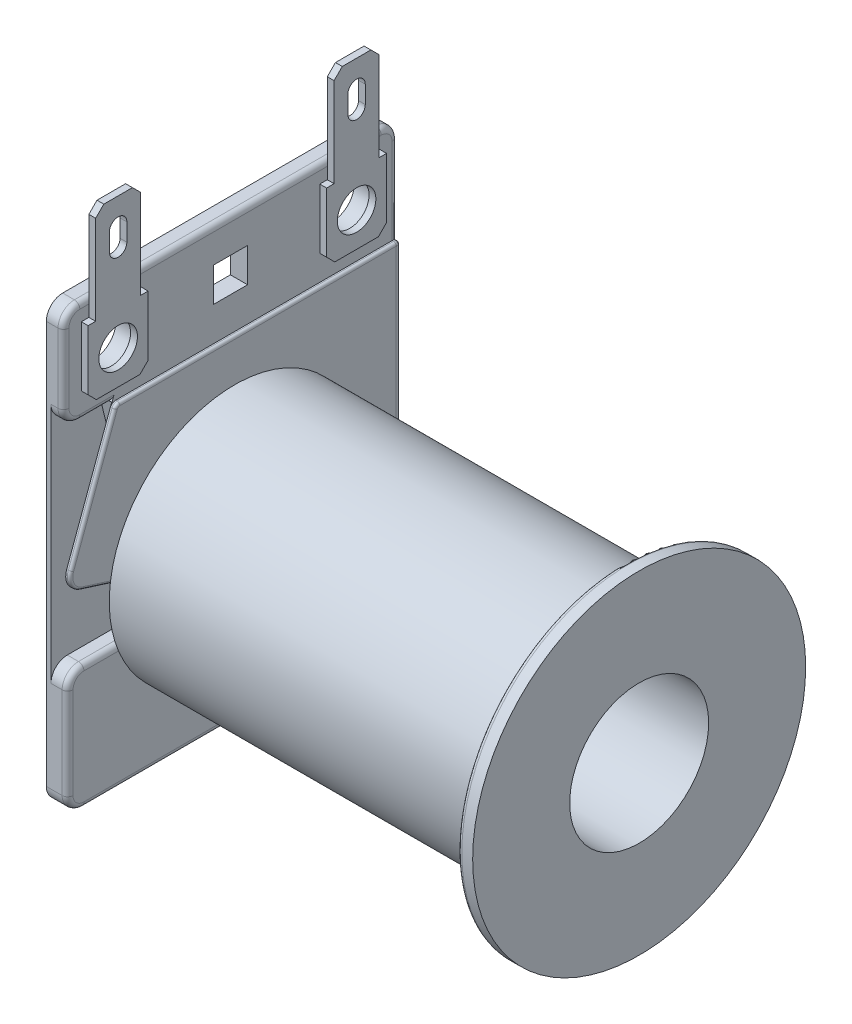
ISO-10303-21;
HEADER;
FILE_DESCRIPTION(('STEP AP214'),'2;1');
FILE_NAME('part.step','',(''),(''),'','','');
FILE_SCHEMA(('AUTOMOTIVE_DESIGN { 1 0 10303 214 1 1 1 1 }'));
ENDSEC;
DATA;
#1=APPLICATION_CONTEXT('core data for automotive mechanical design processes');
#2=APPLICATION_PROTOCOL_DEFINITION('international standard','automotive_design',2000,#1);
#3=PRODUCT_CONTEXT('',#1,'mechanical');
#4=PRODUCT('Part','Part','',(#3));
#5=PRODUCT_RELATED_PRODUCT_CATEGORY('part','',(#4));
#6=PRODUCT_DEFINITION_FORMATION('','',#4);
#7=PRODUCT_DEFINITION_CONTEXT('part definition',#1,'design');
#8=PRODUCT_DEFINITION('design','',#6,#7);
#9=PRODUCT_DEFINITION_SHAPE('','',#8);
#10=(LENGTH_UNIT() NAMED_UNIT(*) SI_UNIT(.MILLI.,.METRE.));
#11=(NAMED_UNIT(*) PLANE_ANGLE_UNIT() SI_UNIT($,.RADIAN.));
#12=(NAMED_UNIT(*) SI_UNIT($,.STERADIAN.) SOLID_ANGLE_UNIT());
#13=UNCERTAINTY_MEASURE_WITH_UNIT(LENGTH_MEASURE(1.E-05),#10,'distance_accuracy_value','');
#14=(GEOMETRIC_REPRESENTATION_CONTEXT(3) GLOBAL_UNCERTAINTY_ASSIGNED_CONTEXT((#13)) GLOBAL_UNIT_ASSIGNED_CONTEXT((#10,
#11,#12)) REPRESENTATION_CONTEXT('',''));
#15=CARTESIAN_POINT('',(0.,0.,0.));
#16=DIRECTION('',(0.,0.,1.));
#17=DIRECTION('',(1.,0.,0.));
#18=AXIS2_PLACEMENT_3D('',#15,#16,#17);
#19=CARTESIAN_POINT('',(2.2352,0.,0.));
#20=DIRECTION('',(-1.,0.,0.));
#21=DIRECTION('',(0.,0.,-1.));
#22=AXIS2_PLACEMENT_3D('',#19,#20,#21);
#23=PLANE('',#22);
#24=DIRECTION('',(0.,1.,0.));
#25=VECTOR('',#24,1.);
#26=CARTESIAN_POINT('',(2.2352,23.5331,-8.3185));
#27=LINE('',#26,#25);
#28=CARTESIAN_POINT('',(2.2352,17.9451,-8.3185));
#29=VERTEX_POINT('',#28);
#30=CARTESIAN_POINT('',(2.2352,23.5331,-8.3185));
#31=VERTEX_POINT('',#30);
#32=EDGE_CURVE('E522',#29,#31,#27,.T.);
#33=ORIENTED_EDGE('',*,*,#32,.F.);
#34=DIRECTION('',(0.,0.707106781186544,0.707106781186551));
#35=VECTOR('',#34,1.);
#36=CARTESIAN_POINT('',(2.2352,17.1831,-9.0805));
#37=LINE('',#36,#35);
#38=CARTESIAN_POINT('',(2.2352,17.1831,-9.0805));
#39=VERTEX_POINT('',#38);
#40=EDGE_CURVE('E1059',#29,#39,#37,.F.);
#41=ORIENTED_EDGE('',*,*,#40,.T.);
#42=DIRECTION('',(0.,0.,1.));
#43=VECTOR('',#42,1.);
#44=CARTESIAN_POINT('',(2.2352,17.1831,-13.9065));
#45=LINE('',#44,#43);
#46=CARTESIAN_POINT('',(2.2352,17.1831,-13.1445));
#47=VERTEX_POINT('',#46);
#48=EDGE_CURVE('E525',#47,#39,#45,.T.);
#49=ORIENTED_EDGE('',*,*,#48,.F.);
#50=DIRECTION('',(0.,-0.707106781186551,0.707106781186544));
#51=VECTOR('',#50,1.);
#52=CARTESIAN_POINT('',(2.2352,17.9451,-13.9065));
#53=LINE('',#52,#51);
#54=CARTESIAN_POINT('',(2.2352,17.9451,-13.9065));
#55=VERTEX_POINT('',#54);
#56=EDGE_CURVE('E1057',#47,#55,#53,.F.);
#57=ORIENTED_EDGE('',*,*,#56,.T.);
#58=DIRECTION('',(0.,-1.,0.));
#59=VECTOR('',#58,1.);
#60=CARTESIAN_POINT('',(2.2352,23.5331,-13.9065));
#61=LINE('',#60,#59);
#62=CARTESIAN_POINT('',(2.2352,23.5331,-13.9065));
#63=VERTEX_POINT('',#62);
#64=EDGE_CURVE('E528',#63,#55,#61,.T.);
#65=ORIENTED_EDGE('',*,*,#64,.F.);
#66=DIRECTION('',(0.,0.,-1.));
#67=VECTOR('',#66,1.);
#68=CARTESIAN_POINT('',(2.2352,23.5331,-13.9065));
#69=LINE('',#68,#67);
#70=CARTESIAN_POINT('',(2.2352,23.5331,-13.208));
#71=VERTEX_POINT('',#70);
#72=EDGE_CURVE('E531',#71,#63,#69,.T.);
#73=ORIENTED_EDGE('',*,*,#72,.F.);
#74=DIRECTION('',(0.,-1.,0.));
#75=VECTOR('',#74,1.);
#76=CARTESIAN_POINT('',(2.2352,32.6136,-13.208));
#77=LINE('',#76,#75);
#78=CARTESIAN_POINT('',(2.2352,31.8516,-13.208));
#79=VERTEX_POINT('',#78);
#80=EDGE_CURVE('E534',#79,#71,#77,.T.);
#81=ORIENTED_EDGE('',*,*,#80,.F.);
#82=DIRECTION('',(0.,-0.707106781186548,-0.707106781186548));
#83=VECTOR('',#82,1.);
#84=CARTESIAN_POINT('',(2.2352,32.6136,-12.446));
#85=LINE('',#84,#83);
#86=CARTESIAN_POINT('',(2.2352,32.6136,-12.446));
#87=VERTEX_POINT('',#86);
#88=EDGE_CURVE('E1053',#79,#87,#85,.F.);
#89=ORIENTED_EDGE('',*,*,#88,.T.);
#90=DIRECTION('',(0.,0.,-1.));
#91=VECTOR('',#90,1.);
#92=CARTESIAN_POINT('',(2.2352,32.6136,-13.208));
#93=LINE('',#92,#91);
#94=CARTESIAN_POINT('',(2.2352,32.6136,-9.77900000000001));
#95=VERTEX_POINT('',#94);
#96=EDGE_CURVE('E536',#95,#87,#93,.T.);
#97=ORIENTED_EDGE('',*,*,#96,.F.);
#98=DIRECTION('',(0.,0.707106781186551,-0.707106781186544));
#99=VECTOR('',#98,1.);
#100=CARTESIAN_POINT('',(2.2352,31.8516,-9.017));
#101=LINE('',#100,#99);
#102=CARTESIAN_POINT('',(2.2352,31.8516,-9.017));
#103=VERTEX_POINT('',#102);
#104=EDGE_CURVE('E1055',#95,#103,#101,.F.);
#105=ORIENTED_EDGE('',*,*,#104,.T.);
#106=DIRECTION('',(0.,1.,0.));
#107=VECTOR('',#106,1.);
#108=CARTESIAN_POINT('',(2.2352,32.6136,-9.017));
#109=LINE('',#108,#107);
#110=CARTESIAN_POINT('',(2.2352,23.5331,-9.017));
#111=VERTEX_POINT('',#110);
#112=EDGE_CURVE('E539',#111,#103,#109,.T.);
#113=ORIENTED_EDGE('',*,*,#112,.F.);
#114=DIRECTION('',(0.,0.,-1.));
#115=VECTOR('',#114,1.);
#116=CARTESIAN_POINT('',(2.2352,23.5331,-9.017));
#117=LINE('',#116,#115);
#118=EDGE_CURVE('E519',#31,#111,#117,.T.);
#119=ORIENTED_EDGE('',*,*,#118,.F.);
#120=EDGE_LOOP('',(#33,#41,#49,#57,#65,#73,#81,#89,#97,#105,#113,#119));
#121=FACE_BOUND('',#120,.T.);
#122=CARTESIAN_POINT('',(2.2352,20.3581,-11.1125));
#123=DIRECTION('',(-1.,0.,0.));
#124=DIRECTION('',(0.,0.,1.));
#125=AXIS2_PLACEMENT_3D('',#122,#123,#124);
#126=CIRCLE('',#125,1.79796878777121);
#127=CARTESIAN_POINT('',(2.2352,20.3581,-9.31453121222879));
#128=VERTEX_POINT('',#127);
#129=EDGE_CURVE('E513',#128,#128,#126,.T.);
#130=ORIENTED_EDGE('',*,*,#129,.T.);
#131=EDGE_LOOP('',(#130));
#132=FACE_BOUND('',#131,.T.);
#133=CARTESIAN_POINT('',(2.2352,30.1106671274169,-11.1125));
#134=DIRECTION('',(-1.,0.,0.));
#135=DIRECTION('',(0.,0.,1.));
#136=AXIS2_PLACEMENT_3D('',#133,#134,#135);
#137=CIRCLE('',#136,0.809964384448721);
#138=CARTESIAN_POINT('',(2.2352,30.1106671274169,-10.3025356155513));
#139=VERTEX_POINT('',#138);
#140=CARTESIAN_POINT('',(2.2352,30.1106671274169,-11.9224643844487));
#141=VERTEX_POINT('',#140);
#142=EDGE_CURVE('E500',#139,#141,#137,.T.);
#143=ORIENTED_EDGE('',*,*,#142,.T.);
#144=DIRECTION('',(0.,-1.,0.));
#145=VECTOR('',#144,1.);
#146=CARTESIAN_POINT('',(2.2352,30.1106671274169,-11.9224643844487));
#147=LINE('',#146,#145);
#148=CARTESIAN_POINT('',(2.2352,28.4666318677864,-11.9224643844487));
#149=VERTEX_POINT('',#148);
#150=EDGE_CURVE('E503',#141,#149,#147,.T.);
#151=ORIENTED_EDGE('',*,*,#150,.T.);
#152=CARTESIAN_POINT('',(2.2352,28.4666318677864,-11.1125));
#153=DIRECTION('',(-1.,0.,0.));
#154=DIRECTION('',(0.,0.,1.));
#155=AXIS2_PLACEMENT_3D('',#152,#153,#154);
#156=CIRCLE('',#155,0.809964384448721);
#157=CARTESIAN_POINT('',(2.2352,28.4666318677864,-10.3025356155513));
#158=VERTEX_POINT('',#157);
#159=EDGE_CURVE('E484',#149,#158,#156,.T.);
#160=ORIENTED_EDGE('',*,*,#159,.T.);
#161=DIRECTION('',(0.,1.,0.));
#162=VECTOR('',#161,1.);
#163=CARTESIAN_POINT('',(2.2352,30.1106671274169,-10.3025356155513));
#164=LINE('',#163,#162);
#165=EDGE_CURVE('E495',#158,#139,#164,.T.);
#166=ORIENTED_EDGE('',*,*,#165,.T.);
#167=EDGE_LOOP('',(#143,#151,#160,#166));
#168=FACE_BOUND('',#167,.T.);
#169=ADVANCED_FACE('F35',(#121,#132,#168),#23,.F.);
#170=CARTESIAN_POINT('',(1.6002,0.,0.));
#171=DIRECTION('',(-1.,0.,0.));
#172=DIRECTION('',(0.,0.,-1.));
#173=AXIS2_PLACEMENT_3D('',#170,#171,#172);
#174=PLANE('',#173);
#175=DIRECTION('',(0.,1.,0.));
#176=VECTOR('',#175,1.);
#177=CARTESIAN_POINT('',(1.6002,32.6136,-9.017));
#178=LINE('',#177,#176);
#179=CARTESIAN_POINT('',(1.6002,24.6126,-9.017));
#180=VERTEX_POINT('',#179);
#181=CARTESIAN_POINT('',(1.6002,31.8516,-9.017));
#182=VERTEX_POINT('',#181);
#183=EDGE_CURVE('E559',#180,#182,#178,.T.);
#184=ORIENTED_EDGE('',*,*,#183,.T.);
#185=DIRECTION('',(0.,-0.707106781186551,0.707106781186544));
#186=VECTOR('',#185,1.);
#187=CARTESIAN_POINT('',(1.6002,11.4172999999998,11.4173));
#188=LINE('',#187,#186);
#189=CARTESIAN_POINT('',(1.6002,32.6136,-9.77900000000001));
#190=VERTEX_POINT('',#189);
#191=EDGE_CURVE('E58',#182,#190,#188,.F.);
#192=ORIENTED_EDGE('',*,*,#191,.T.);
#193=DIRECTION('',(0.,0.,-1.));
#194=VECTOR('',#193,1.);
#195=CARTESIAN_POINT('',(1.6002,32.6136,-13.208));
#196=LINE('',#195,#194);
#197=CARTESIAN_POINT('',(1.6002,32.6136,-12.446));
#198=VERTEX_POINT('',#197);
#199=EDGE_CURVE('E557',#190,#198,#196,.T.);
#200=ORIENTED_EDGE('',*,*,#199,.T.);
#201=DIRECTION('',(0.,0.707106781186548,0.707106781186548));
#202=VECTOR('',#201,1.);
#203=CARTESIAN_POINT('',(1.6002,22.5298,-22.5298));
#204=LINE('',#203,#202);
#205=CARTESIAN_POINT('',(1.6002,31.8516,-13.208));
#206=VERTEX_POINT('',#205);
#207=EDGE_CURVE('E50',#198,#206,#204,.F.);
#208=ORIENTED_EDGE('',*,*,#207,.T.);
#209=DIRECTION('',(0.,-1.,0.));
#210=VECTOR('',#209,1.);
#211=CARTESIAN_POINT('',(1.6002,32.6136,-13.208));
#212=LINE('',#211,#210);
#213=CARTESIAN_POINT('',(1.6002,24.6126,-13.208));
#214=VERTEX_POINT('',#213);
#215=EDGE_CURVE('E555',#206,#214,#212,.T.);
#216=ORIENTED_EDGE('',*,*,#215,.T.);
#217=DIRECTION('',(0.,0.,-1.));
#218=VECTOR('',#217,1.);
#219=CARTESIAN_POINT('',(1.6002,24.6126,0.));
#220=LINE('',#219,#218);
#221=EDGE_CURVE('E833',#214,#180,#220,.F.);
#222=ORIENTED_EDGE('',*,*,#221,.T.);
#223=EDGE_LOOP('',(#184,#192,#200,#208,#216,#222));
#224=FACE_BOUND('',#223,.T.);
#225=DIRECTION('',(0.,1.,0.));
#226=VECTOR('',#225,1.);
#227=CARTESIAN_POINT('',(1.6002,0.,-11.9224643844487));
#228=LINE('',#227,#226);
#229=CARTESIAN_POINT('',(1.6002,28.4666318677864,-11.9224643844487));
#230=VERTEX_POINT('',#229);
#231=CARTESIAN_POINT('',(1.6002,30.1106671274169,-11.9224643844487));
#232=VERTEX_POINT('',#231);
#233=EDGE_CURVE('E1040',#230,#232,#228,.T.);
#234=ORIENTED_EDGE('',*,*,#233,.T.);
#235=CARTESIAN_POINT('',(1.6002,30.1106671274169,-11.1125));
#236=DIRECTION('',(-1.,0.,0.));
#237=DIRECTION('',(0.,0.,1.));
#238=AXIS2_PLACEMENT_3D('',#235,#236,#237);
#239=CIRCLE('',#238,0.809964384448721);
#240=CARTESIAN_POINT('',(1.6002,30.1106671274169,-10.3025356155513));
#241=VERTEX_POINT('',#240);
#242=EDGE_CURVE('E1043',#232,#241,#239,.F.);
#243=ORIENTED_EDGE('',*,*,#242,.T.);
#244=DIRECTION('',(0.,-1.,0.));
#245=VECTOR('',#244,1.);
#246=CARTESIAN_POINT('',(1.6002,0.,-10.3025356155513));
#247=LINE('',#246,#245);
#248=CARTESIAN_POINT('',(1.6002,28.4666318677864,-10.3025356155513));
#249=VERTEX_POINT('',#248);
#250=EDGE_CURVE('E1037',#241,#249,#247,.T.);
#251=ORIENTED_EDGE('',*,*,#250,.T.);
#252=CARTESIAN_POINT('',(1.6002,28.4666318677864,-11.1125));
#253=DIRECTION('',(-1.,0.,0.));
#254=DIRECTION('',(0.,0.,1.));
#255=AXIS2_PLACEMENT_3D('',#252,#253,#254);
#256=CIRCLE('',#255,0.809964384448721);
#257=EDGE_CURVE('E487',#249,#230,#256,.F.);
#258=ORIENTED_EDGE('',*,*,#257,.T.);
#259=EDGE_LOOP('',(#234,#243,#251,#258));
#260=FACE_BOUND('',#259,.T.);
#261=ADVANCED_FACE('F1115',(#224,#260),#174,.T.);
#262=CARTESIAN_POINT('',(1.6002,0.,0.));
#263=DIRECTION('',(-1.,0.,0.));
#264=DIRECTION('',(0.,0.,1.));
#265=AXIS2_PLACEMENT_3D('',#262,#263,#264);
#266=PLANE('',#265);
#267=DIRECTION('',(0.,0.,1.));
#268=VECTOR('',#267,1.);
#269=CARTESIAN_POINT('',(1.6002,21.9456,-1.5875));
#270=LINE('',#269,#268);
#271=CARTESIAN_POINT('',(1.6002,21.9456,-1.5875));
#272=VERTEX_POINT('',#271);
#273=CARTESIAN_POINT('',(1.6002,21.9456,1.5875));
#274=VERTEX_POINT('',#273);
#275=EDGE_CURVE('E673',#272,#274,#270,.T.);
#276=ORIENTED_EDGE('',*,*,#275,.F.);
#277=DIRECTION('',(0.,1.,0.));
#278=VECTOR('',#277,1.);
#279=CARTESIAN_POINT('',(1.6002,18.7706,-1.5875));
#280=LINE('',#279,#278);
#281=CARTESIAN_POINT('',(1.6002,18.7706,-1.5875));
#282=VERTEX_POINT('',#281);
#283=EDGE_CURVE('E677',#282,#272,#280,.T.);
#284=ORIENTED_EDGE('',*,*,#283,.F.);
#285=DIRECTION('',(0.,0.,-1.));
#286=VECTOR('',#285,1.);
#287=CARTESIAN_POINT('',(1.6002,18.7706,-1.5875));
#288=LINE('',#287,#286);
#289=CARTESIAN_POINT('',(1.6002,18.7706,1.5875));
#290=VERTEX_POINT('',#289);
#291=EDGE_CURVE('E680',#290,#282,#288,.T.);
#292=ORIENTED_EDGE('',*,*,#291,.F.);
#293=DIRECTION('',(0.,-1.,0.));
#294=VECTOR('',#293,1.);
#295=CARTESIAN_POINT('',(1.6002,18.7706,1.5875));
#296=LINE('',#295,#294);
#297=EDGE_CURVE('E683',#274,#290,#296,.T.);
#298=ORIENTED_EDGE('',*,*,#297,.F.);
#299=EDGE_LOOP('',(#276,#284,#292,#298));
#300=FACE_BOUND('',#299,.T.);
#301=CARTESIAN_POINT('',(1.6002,24.6126,-14.0462));
#302=VERTEX_POINT('',#301);
#303=EDGE_CURVE('E829',#302,#214,#220,.F.);
#304=ORIENTED_EDGE('',*,*,#303,.T.);
#305=CARTESIAN_POINT('',(1.6002,23.5331,-13.208));
#306=VERTEX_POINT('',#305);
#307=EDGE_CURVE('E554',#214,#306,#212,.T.);
#308=ORIENTED_EDGE('',*,*,#307,.T.);
#309=DIRECTION('',(0.,0.,-1.));
#310=VECTOR('',#309,1.);
#311=CARTESIAN_POINT('',(1.6002,23.5331,-13.9065));
#312=LINE('',#311,#310);
#313=CARTESIAN_POINT('',(1.6002,23.5331,-13.9065));
#314=VERTEX_POINT('',#313);
#315=EDGE_CURVE('E552',#306,#314,#312,.T.);
#316=ORIENTED_EDGE('',*,*,#315,.T.);
#317=DIRECTION('',(0.,-1.,0.));
#318=VECTOR('',#317,1.);
#319=CARTESIAN_POINT('',(1.6002,23.5331,-13.9065));
#320=LINE('',#319,#318);
#321=CARTESIAN_POINT('',(1.6002,17.9451,-13.9065));
#322=VERTEX_POINT('',#321);
#323=EDGE_CURVE('E549',#314,#322,#320,.T.);
#324=ORIENTED_EDGE('',*,*,#323,.T.);
#325=DIRECTION('',(0.,0.707106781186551,-0.707106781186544));
#326=VECTOR('',#325,1.);
#327=CARTESIAN_POINT('',(1.6002,2.01929999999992,2.01929999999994));
#328=LINE('',#327,#326);
#329=CARTESIAN_POINT('',(1.6002,17.1831,-13.1445));
#330=VERTEX_POINT('',#329);
#331=EDGE_CURVE('E11',#322,#330,#328,.F.);
#332=ORIENTED_EDGE('',*,*,#331,.T.);
#333=DIRECTION('',(0.,0.,1.));
#334=VECTOR('',#333,1.);
#335=CARTESIAN_POINT('',(1.6002,17.1831,-13.9065));
#336=LINE('',#335,#334);
#337=CARTESIAN_POINT('',(1.6002,17.1831,-9.0805));
#338=VERTEX_POINT('',#337);
#339=EDGE_CURVE('E546',#330,#338,#336,.T.);
#340=ORIENTED_EDGE('',*,*,#339,.T.);
#341=DIRECTION('',(0.,-0.707106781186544,-0.707106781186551));
#342=VECTOR('',#341,1.);
#343=CARTESIAN_POINT('',(1.6002,13.1318000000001,-13.1318));
#344=LINE('',#343,#342);
#345=CARTESIAN_POINT('',(1.6002,17.9451,-8.3185));
#346=VERTEX_POINT('',#345);
#347=EDGE_CURVE('E43',#338,#346,#344,.F.);
#348=ORIENTED_EDGE('',*,*,#347,.T.);
#349=DIRECTION('',(0.,1.,0.));
#350=VECTOR('',#349,1.);
#351=CARTESIAN_POINT('',(1.6002,23.5331,-8.3185));
#352=LINE('',#351,#350);
#353=CARTESIAN_POINT('',(1.6002,23.5331,-8.3185));
#354=VERTEX_POINT('',#353);
#355=EDGE_CURVE('E544',#346,#354,#352,.T.);
#356=ORIENTED_EDGE('',*,*,#355,.T.);
#357=DIRECTION('',(0.,0.,-1.));
#358=VECTOR('',#357,1.);
#359=CARTESIAN_POINT('',(1.6002,23.5331,-9.017));
#360=LINE('',#359,#358);
#361=CARTESIAN_POINT('',(1.6002,23.5331,-9.017));
#362=VERTEX_POINT('',#361);
#363=EDGE_CURVE('E516',#354,#362,#360,.T.);
#364=ORIENTED_EDGE('',*,*,#363,.T.);
#365=EDGE_CURVE('E523',#362,#180,#178,.T.);
#366=ORIENTED_EDGE('',*,*,#365,.T.);
#367=CARTESIAN_POINT('',(1.6002,24.6126,9.017));
#368=VERTEX_POINT('',#367);
#369=EDGE_CURVE('E834',#180,#368,#220,.F.);
#370=ORIENTED_EDGE('',*,*,#369,.T.);
#371=DIRECTION('',(0.,1.,0.));
#372=VECTOR('',#371,1.);
#373=CARTESIAN_POINT('',(1.6002,32.6136,9.017));
#374=LINE('',#373,#372);
#375=CARTESIAN_POINT('',(1.6002,23.5331,9.017));
#376=VERTEX_POINT('',#375);
#377=EDGE_CURVE('E629',#376,#368,#374,.T.);
#378=ORIENTED_EDGE('',*,*,#377,.F.);
#379=DIRECTION('',(0.,0.,1.));
#380=VECTOR('',#379,1.);
#381=CARTESIAN_POINT('',(1.6002,23.5331,9.017));
#382=LINE('',#381,#380);
#383=CARTESIAN_POINT('',(1.6002,23.5331,8.3185));
#384=VERTEX_POINT('',#383);
#385=EDGE_CURVE('E600',#384,#376,#382,.T.);
#386=ORIENTED_EDGE('',*,*,#385,.F.);
#387=DIRECTION('',(0.,1.,0.));
#388=VECTOR('',#387,1.);
#389=CARTESIAN_POINT('',(1.6002,23.5331,8.3185));
#390=LINE('',#389,#388);
#391=CARTESIAN_POINT('',(1.6002,17.9451,8.3185));
#392=VERTEX_POINT('',#391);
#393=EDGE_CURVE('E607',#392,#384,#390,.T.);
#394=ORIENTED_EDGE('',*,*,#393,.F.);
#395=DIRECTION('',(0.,0.707106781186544,-0.707106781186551));
#396=VECTOR('',#395,1.);
#397=CARTESIAN_POINT('',(1.6002,13.1318000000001,13.1318));
#398=LINE('',#397,#396);
#399=CARTESIAN_POINT('',(1.6002,17.1831,9.08050000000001));
#400=VERTEX_POINT('',#399);
#401=EDGE_CURVE('E1033',#392,#400,#398,.F.);
#402=ORIENTED_EDGE('',*,*,#401,.T.);
#403=DIRECTION('',(0.,0.,-1.));
#404=VECTOR('',#403,1.);
#405=CARTESIAN_POINT('',(1.6002,17.1831,13.9065));
#406=LINE('',#405,#404);
#407=CARTESIAN_POINT('',(1.6002,17.1831,13.1445));
#408=VERTEX_POINT('',#407);
#409=EDGE_CURVE('E644',#408,#400,#406,.T.);
#410=ORIENTED_EDGE('',*,*,#409,.F.);
#411=DIRECTION('',(0.,-0.707106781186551,-0.707106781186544));
#412=VECTOR('',#411,1.);
#413=CARTESIAN_POINT('',(1.6002,2.01929999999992,-2.01929999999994));
#414=LINE('',#413,#412);
#415=CARTESIAN_POINT('',(1.6002,17.9451,13.9065));
#416=VERTEX_POINT('',#415);
#417=EDGE_CURVE('E1035',#408,#416,#414,.F.);
#418=ORIENTED_EDGE('',*,*,#417,.T.);
#419=DIRECTION('',(0.,-1.,0.));
#420=VECTOR('',#419,1.);
#421=CARTESIAN_POINT('',(1.6002,23.5331,13.9065));
#422=LINE('',#421,#420);
#423=CARTESIAN_POINT('',(1.6002,23.5331,13.9065));
#424=VERTEX_POINT('',#423);
#425=EDGE_CURVE('E641',#424,#416,#422,.T.);
#426=ORIENTED_EDGE('',*,*,#425,.F.);
#427=DIRECTION('',(0.,0.,1.));
#428=VECTOR('',#427,1.);
#429=CARTESIAN_POINT('',(1.6002,23.5331,13.9065));
#430=LINE('',#429,#428);
#431=CARTESIAN_POINT('',(1.6002,23.5331,13.208));
#432=VERTEX_POINT('',#431);
#433=EDGE_CURVE('E638',#432,#424,#430,.T.);
#434=ORIENTED_EDGE('',*,*,#433,.F.);
#435=DIRECTION('',(0.,-1.,0.));
#436=VECTOR('',#435,1.);
#437=CARTESIAN_POINT('',(1.6002,32.6136,13.208));
#438=LINE('',#437,#436);
#439=CARTESIAN_POINT('',(1.6002,24.6126,13.208));
#440=VERTEX_POINT('',#439);
#441=EDGE_CURVE('E635',#440,#432,#438,.T.);
#442=ORIENTED_EDGE('',*,*,#441,.F.);
#443=CARTESIAN_POINT('',(1.6002,24.6126,14.0462));
#444=VERTEX_POINT('',#443);
#445=EDGE_CURVE('E828',#440,#444,#220,.F.);
#446=ORIENTED_EDGE('',*,*,#445,.T.);
#447=CARTESIAN_POINT('',(1.6002,23.5966,14.0462));
#448=DIRECTION('',(-1.,0.,0.));
#449=DIRECTION('',(0.,0.,1.));
#450=AXIS2_PLACEMENT_3D('',#447,#448,#449);
#451=CIRCLE('',#450,1.016);
#452=CARTESIAN_POINT('',(1.6002,23.5966,15.0622));
#453=VERTEX_POINT('',#452);
#454=EDGE_CURVE('E826',#444,#453,#451,.F.);
#455=ORIENTED_EDGE('',*,*,#454,.T.);
#456=DIRECTION('',(0.,1.,0.));
#457=VECTOR('',#456,1.);
#458=CARTESIAN_POINT('',(1.6002,0.,15.0622));
#459=LINE('',#458,#457);
#460=CARTESIAN_POINT('',(1.6002,17.1196,15.0622));
#461=VERTEX_POINT('',#460);
#462=EDGE_CURVE('E824',#453,#461,#459,.F.);
#463=ORIENTED_EDGE('',*,*,#462,.T.);
#464=CARTESIAN_POINT('',(1.6002,17.1196,14.0462));
#465=DIRECTION('',(-1.,0.,0.));
#466=DIRECTION('',(0.,0.,1.));
#467=AXIS2_PLACEMENT_3D('',#464,#465,#466);
#468=CIRCLE('',#467,1.016);
#469=CARTESIAN_POINT('',(1.6002,16.1036,14.0462));
#470=VERTEX_POINT('',#469);
#471=EDGE_CURVE('E822',#461,#470,#468,.F.);
#472=ORIENTED_EDGE('',*,*,#471,.T.);
#473=DIRECTION('',(0.,0.,-1.));
#474=VECTOR('',#473,1.);
#475=CARTESIAN_POINT('',(1.6002,16.1036,0.));
#476=LINE('',#475,#474);
#477=CARTESIAN_POINT('',(1.6002,16.1036,10.8619112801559));
#478=VERTEX_POINT('',#477);
#479=EDGE_CURVE('E819',#470,#478,#476,.T.);
#480=ORIENTED_EDGE('',*,*,#479,.T.);
#481=DIRECTION('',(0.,-0.938384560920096,0.345592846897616));
#482=VECTOR('',#481,1.);
#483=CARTESIAN_POINT('',(1.6002,5.44583093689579,14.7870064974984));
#484=LINE('',#483,#482);
#485=CARTESIAN_POINT('',(1.6002,15.263161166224,11.1714321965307));
#486=VERTEX_POINT('',#485);
#487=EDGE_CURVE('E816',#478,#486,#484,.T.);
#488=ORIENTED_EDGE('',*,*,#487,.T.);
#489=CARTESIAN_POINT('',(1.6002,15.0876,10.6947328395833));
#490=DIRECTION('',(-1.,0.,0.));
#491=DIRECTION('',(0.,0.,1.));
#492=AXIS2_PLACEMENT_3D('',#489,#490,#491);
#493=CIRCLE('',#492,0.508);
#494=CARTESIAN_POINT('',(1.6002,15.5956,10.6947328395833));
#495=VERTEX_POINT('',#494);
#496=EDGE_CURVE('E1739',#486,#495,#493,.T.);
#497=ORIENTED_EDGE('',*,*,#496,.T.);
#498=DIRECTION('',(0.,0.,-1.));
#499=VECTOR('',#498,1.);
#500=CARTESIAN_POINT('',(1.6002,15.5956,19.6984510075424));
#501=LINE('',#500,#499);
#502=CARTESIAN_POINT('',(1.6002,15.5956,-15.0622));
#503=VERTEX_POINT('',#502);
#504=EDGE_CURVE('E670',#495,#503,#501,.T.);
#505=ORIENTED_EDGE('',*,*,#504,.T.);
#506=DIRECTION('',(0.,-1.,0.));
#507=VECTOR('',#506,1.);
#508=CARTESIAN_POINT('',(1.6002,0.,-15.0622));
#509=LINE('',#508,#507);
#510=CARTESIAN_POINT('',(1.6002,23.5966,-15.0622));
#511=VERTEX_POINT('',#510);
#512=EDGE_CURVE('E837',#503,#511,#509,.F.);
#513=ORIENTED_EDGE('',*,*,#512,.T.);
#514=CARTESIAN_POINT('',(1.6002,23.5966,-14.0462));
#515=DIRECTION('',(-1.,0.,0.));
#516=DIRECTION('',(0.,0.,1.));
#517=AXIS2_PLACEMENT_3D('',#514,#515,#516);
#518=CIRCLE('',#517,1.016);
#519=EDGE_CURVE('E832',#511,#302,#518,.F.);
#520=ORIENTED_EDGE('',*,*,#519,.T.);
#521=EDGE_LOOP('',(#304,#308,#316,#324,#332,#340,#348,#356,#364,#366,#370,#378,#386,#394,#402,
#410,#418,#426,#434,#442,#446,#455,#463,#472,#480,#488,#497,#505,#513,#520));
#522=FACE_BOUND('',#521,.T.);
#523=ADVANCED_FACE('F1076',(#300,#522),#266,.F.);
#524=CARTESIAN_POINT('',(39.6875,0.,0.));
#525=DIRECTION('',(-1.,0.,0.));
#526=DIRECTION('',(0.,0.,1.));
#527=AXIS2_PLACEMENT_3D('',#524,#525,#526);
#528=CYLINDRICAL_SURFACE('',#527,7.239);
#529=CARTESIAN_POINT('',(1.9812,0.,0.));
#530=DIRECTION('',(1.,0.,0.));
#531=DIRECTION('',(0.,0.,-1.));
#532=AXIS2_PLACEMENT_3D('',#529,#530,#531);
#533=CIRCLE('',#532,7.239);
#534=CARTESIAN_POINT('',(1.9812,0.264863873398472,7.23415289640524));
#535=VERTEX_POINT('',#534);
#536=CARTESIAN_POINT('',(1.9812,-4.3942,5.75274954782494));
#537=VERTEX_POINT('',#536);
#538=EDGE_CURVE('E662',#535,#537,#533,.T.);
#539=ORIENTED_EDGE('',*,*,#538,.F.);
#540=CARTESIAN_POINT('',(1.9812,0.264863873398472,7.23415289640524));
#541=CARTESIAN_POINT('',(1.98120960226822,0.249540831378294,7.23471579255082));
#542=CARTESIAN_POINT('',(1.97991058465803,0.234218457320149,7.23522621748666));
#543=CARTESIAN_POINT('',(1.9747784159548,0.203998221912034,7.23614034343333));
#544=CARTESIAN_POINT('',(1.97094489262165,0.1891004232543,7.23654402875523));
#545=CARTESIAN_POINT('',(1.96082365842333,0.160148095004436,7.23724294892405));
#546=CARTESIAN_POINT('',(1.95453439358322,0.14609410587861,7.23753811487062));
#547=CARTESIAN_POINT('',(1.93965724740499,0.119262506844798,7.2380299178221));
#548=CARTESIAN_POINT('',(1.93107022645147,0.106484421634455,7.23822659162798));
#549=CARTESIAN_POINT('',(1.91194152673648,0.0827723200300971,7.23853637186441));
#550=CARTESIAN_POINT('',(1.90142836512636,0.0718153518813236,7.23865059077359));
#551=CARTESIAN_POINT('',(1.87864148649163,0.051906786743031,7.23882076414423));
#552=CARTESIAN_POINT('',(1.86636767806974,0.0429552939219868,7.23887671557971));
#553=CARTESIAN_POINT('',(1.84092507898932,0.0277020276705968,7.23895087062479));
#554=CARTESIAN_POINT('',(1.82781030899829,0.0213100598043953,7.23897046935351));
#555=CARTESIAN_POINT('',(1.80066731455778,0.0109365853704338,7.23899361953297));
#556=CARTESIAN_POINT('',(1.78664027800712,0.00695201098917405,7.23899719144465));
#557=CARTESIAN_POINT('',(1.7649347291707,0.00283587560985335,7.23899956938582));
#558=CARTESIAN_POINT('',(1.75742199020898,0.00177301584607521,7.23899983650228));
#559=CARTESIAN_POINT('',(1.74234082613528,0.000355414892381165,7.23900000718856));
#560=CARTESIAN_POINT('',(1.73477249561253,-3.33033445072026E-07,7.2389999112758));
#561=CARTESIAN_POINT('',(1.72720000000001,0.,7.23900000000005));
#562=B_SPLINE_CURVE_WITH_KNOTS('',3,(#540,#541,#542,#543,#544,#545,#546,#547,#548,#549,#550,
#551,#552,#553,#554,#555,#556,#557,#558,#559,#560,#561),.UNSPECIFIED.,.F.,.F.,(4,2,2,2,2,2,2,2,
2,2,4),(0.,0.0459420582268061,0.0918908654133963,0.137868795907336,0.183829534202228,
0.22915795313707,0.274488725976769,0.318040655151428,0.361536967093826,0.384270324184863,
0.406971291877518),.UNSPECIFIED.);
#563=CARTESIAN_POINT('',(1.7272,0.,7.239));
#564=VERTEX_POINT('',#563);
#565=EDGE_CURVE('E986',#535,#564,#562,.T.);
#566=ORIENTED_EDGE('',*,*,#565,.T.);
#567=DIRECTION('',(-1.,0.,0.));
#568=VECTOR('',#567,1.);
#569=CARTESIAN_POINT('',(2.7178,0.,7.239));
#570=LINE('',#569,#568);
#571=CARTESIAN_POINT('',(1.5748,0.,7.239));
#572=VERTEX_POINT('',#571);
#573=EDGE_CURVE('E722',#564,#572,#570,.T.);
#574=ORIENTED_EDGE('',*,*,#573,.T.);
#575=DIRECTION('',(-1.,0.,0.));
#576=VECTOR('',#575,1.);
#577=CARTESIAN_POINT('',(1.5748,0.,7.239));
#578=LINE('',#577,#576);
#579=CARTESIAN_POINT('',(0.4318,0.,7.239));
#580=VERTEX_POINT('',#579);
#581=EDGE_CURVE('E748',#572,#580,#578,.T.);
#582=ORIENTED_EDGE('',*,*,#581,.T.);
#583=CARTESIAN_POINT('',(0.4318,0.,0.));
#584=DIRECTION('',(1.,0.,0.));
#585=DIRECTION('',(0.,0.,1.));
#586=AXIS2_PLACEMENT_3D('',#583,#584,#585);
#587=CIRCLE('',#586,7.239);
#588=CARTESIAN_POINT('',(0.4318,-3.8862,6.10741930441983));
#589=VERTEX_POINT('',#588);
#590=EDGE_CURVE('E740',#580,#589,#587,.T.);
#591=ORIENTED_EDGE('',*,*,#590,.T.);
#592=DIRECTION('',(-1.,0.,0.));
#593=VECTOR('',#592,1.);
#594=CARTESIAN_POINT('',(1.5748,-3.8862,6.10741930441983));
#595=LINE('',#594,#593);
#596=CARTESIAN_POINT('',(1.4732,-3.8862,6.10741930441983));
#597=VERTEX_POINT('',#596);
#598=EDGE_CURVE('E745',#597,#589,#595,.T.);
#599=ORIENTED_EDGE('',*,*,#598,.F.);
#600=CARTESIAN_POINT('',(1.4732,-3.8862,6.10741930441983));
#601=CARTESIAN_POINT('',(1.4984754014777,-3.88616515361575,6.10743690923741));
#602=CARTESIAN_POINT('',(1.52372148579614,-3.88808390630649,6.10622057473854));
#603=CARTESIAN_POINT('',(1.57333398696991,-3.89554794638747,6.10146385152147));
#604=CARTESIAN_POINT('',(1.59770386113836,-3.90107681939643,6.09793398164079));
#605=CARTESIAN_POINT('',(1.6449630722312,-3.91547859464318,6.08869580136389));
#606=CARTESIAN_POINT('',(1.66785369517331,-3.92434854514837,6.08298941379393));
#607=CARTESIAN_POINT('',(1.71167348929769,-3.94499931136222,6.06961723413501));
#608=CARTESIAN_POINT('',(1.73260099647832,-3.95678256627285,6.06194979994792));
#609=CARTESIAN_POINT('',(1.7731449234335,-3.98344899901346,6.04446202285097));
#610=CARTESIAN_POINT('',(1.79263604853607,-3.99846179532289,6.0345502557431));
#611=CARTESIAN_POINT('',(1.82878580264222,-4.03059539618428,6.01313519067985));
#612=CARTESIAN_POINT('',(1.84544360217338,-4.0477168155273,6.00163142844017));
#613=CARTESIAN_POINT('',(1.8780433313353,-4.08615772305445,5.97553762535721));
#614=CARTESIAN_POINT('',(1.89352717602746,-4.10772538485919,5.96074212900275));
#615=CARTESIAN_POINT('',(1.92065304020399,-4.15226804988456,5.92980001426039));
#616=CARTESIAN_POINT('',(1.93229146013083,-4.17524434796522,5.91365214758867));
#617=CARTESIAN_POINT('',(1.95354009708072,-4.22618718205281,5.87738079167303));
#618=CARTESIAN_POINT('',(1.96242376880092,-4.25431566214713,5.85706034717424));
#619=CARTESIAN_POINT('',(1.97517400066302,-4.31096333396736,5.8154920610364));
#620=CARTESIAN_POINT('',(1.97904567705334,-4.33948209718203,5.79424518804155));
#621=CARTESIAN_POINT('',(1.98097377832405,-4.37667831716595,5.76610195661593));
#622=CARTESIAN_POINT('',(1.98119989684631,-4.38544866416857,5.75943458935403));
#623=CARTESIAN_POINT('',(1.9812,-4.3942,5.75274954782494));
#624=B_SPLINE_CURVE_WITH_KNOTS('',3,(#600,#601,#602,#603,#604,#605,#606,#607,#608,#609,#610,
#611,#612,#613,#614,#615,#616,#617,#618,#619,#620,#621,#622,#623),.UNSPECIFIED.,.F.,.F.,(4,2,2,
2,2,2,2,2,2,2,2,4),(0.,0.0756782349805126,0.151014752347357,0.22628486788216,0.301618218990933,
0.380880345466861,0.460165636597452,0.551005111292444,0.641929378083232,0.748990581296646,
0.855942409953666,0.888988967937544),.UNSPECIFIED.);
#625=EDGE_CURVE('E914',#597,#537,#624,.T.);
#626=ORIENTED_EDGE('',*,*,#625,.T.);
#627=EDGE_LOOP('',(#539,#566,#574,#582,#591,#599,#626));
#628=FACE_BOUND('',#627,.T.);
#629=ADVANCED_FACE('F924',(#628),#528,.T.);
#630=CARTESIAN_POINT('',(1.9812,0.,0.));
#631=DIRECTION('',(-1.,0.,0.));
#632=DIRECTION('',(0.,0.,1.));
#633=AXIS2_PLACEMENT_3D('',#630,#631,#632);
#634=PLANE('',#633);
#635=CARTESIAN_POINT('',(1.9812,0.,0.));
#636=DIRECTION('',(1.,0.,0.));
#637=DIRECTION('',(0.,0.,-1.));
#638=AXIS2_PLACEMENT_3D('',#635,#636,#637);
#639=CIRCLE('',#638,11.684);
#640=CARTESIAN_POINT('',(1.9812,-4.3942,10.8262118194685));
#641=VERTEX_POINT('',#640);
#642=CARTESIAN_POINT('',(1.9812,1.63560048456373,11.5689527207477));
#643=VERTEX_POINT('',#642);
#644=EDGE_CURVE('E665',#641,#643,#639,.T.);
#645=ORIENTED_EDGE('',*,*,#644,.F.);
#646=DIRECTION('',(0.,0.,1.));
#647=VECTOR('',#646,1.);
#648=CARTESIAN_POINT('',(1.9812,-4.3942,0.));
#649=LINE('',#648,#647);
#650=CARTESIAN_POINT('',(1.9812,-4.3942,14.0462));
#651=VERTEX_POINT('',#650);
#652=EDGE_CURVE('E896',#641,#651,#649,.T.);
#653=ORIENTED_EDGE('',*,*,#652,.T.);
#654=CARTESIAN_POINT('',(1.9812,-5.4102,14.0462));
#655=DIRECTION('',(-1.,0.,0.));
#656=DIRECTION('',(0.,0.,1.));
#657=AXIS2_PLACEMENT_3D('',#654,#655,#656);
#658=CIRCLE('',#657,1.016);
#659=CARTESIAN_POINT('',(1.9812,-5.4102,15.0622));
#660=VERTEX_POINT('',#659);
#661=EDGE_CURVE('E894',#651,#660,#658,.F.);
#662=ORIENTED_EDGE('',*,*,#661,.T.);
#663=DIRECTION('',(0.,-1.,0.));
#664=VECTOR('',#663,1.);
#665=CARTESIAN_POINT('',(1.9812,0.,15.0622));
#666=LINE('',#665,#664);
#667=CARTESIAN_POINT('',(1.9812,-13.9446,15.0622));
#668=VERTEX_POINT('',#667);
#669=EDGE_CURVE('E892',#660,#668,#666,.T.);
#670=ORIENTED_EDGE('',*,*,#669,.T.);
#671=CARTESIAN_POINT('',(1.9812,-13.9446,14.0462));
#672=DIRECTION('',(-1.,0.,0.));
#673=DIRECTION('',(0.,0.,1.));
#674=AXIS2_PLACEMENT_3D('',#671,#672,#673);
#675=CIRCLE('',#674,1.016);
#676=CARTESIAN_POINT('',(1.9812,-14.9606,14.0462));
#677=VERTEX_POINT('',#676);
#678=EDGE_CURVE('E890',#668,#677,#675,.F.);
#679=ORIENTED_EDGE('',*,*,#678,.T.);
#680=DIRECTION('',(0.,0.,-1.));
#681=VECTOR('',#680,1.);
#682=CARTESIAN_POINT('',(1.9812,-14.9606,0.));
#683=LINE('',#682,#681);
#684=CARTESIAN_POINT('',(1.9812,-14.9606,-14.0462));
#685=VERTEX_POINT('',#684);
#686=EDGE_CURVE('E888',#677,#685,#683,.T.);
#687=ORIENTED_EDGE('',*,*,#686,.T.);
#688=CARTESIAN_POINT('',(1.9812,-13.9446,-14.0462));
#689=DIRECTION('',(-1.,0.,0.));
#690=DIRECTION('',(0.,0.,1.));
#691=AXIS2_PLACEMENT_3D('',#688,#689,#690);
#692=CIRCLE('',#691,1.016);
#693=CARTESIAN_POINT('',(1.9812,-13.9446,-15.0622));
#694=VERTEX_POINT('',#693);
#695=EDGE_CURVE('E886',#685,#694,#692,.F.);
#696=ORIENTED_EDGE('',*,*,#695,.T.);
#697=DIRECTION('',(0.,1.,0.));
#698=VECTOR('',#697,1.);
#699=CARTESIAN_POINT('',(1.9812,0.,-15.0622));
#700=LINE('',#699,#698);
#701=CARTESIAN_POINT('',(1.9812,15.3416,-15.0622));
#702=VERTEX_POINT('',#701);
#703=EDGE_CURVE('E883',#694,#702,#700,.T.);
#704=ORIENTED_EDGE('',*,*,#703,.T.);
#705=DIRECTION('',(0.,0.,-1.));
#706=VECTOR('',#705,1.);
#707=CARTESIAN_POINT('',(1.9812,15.3416,0.));
#708=LINE('',#707,#706);
#709=CARTESIAN_POINT('',(1.9812,15.3416,10.6947328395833));
#710=VERTEX_POINT('',#709);
#711=EDGE_CURVE('E2206',#702,#710,#708,.F.);
#712=ORIENTED_EDGE('',*,*,#711,.T.);
#713=CARTESIAN_POINT('',(1.9812,15.0876,10.6947328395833));
#714=DIRECTION('',(-1.,0.,0.));
#715=DIRECTION('',(0.,0.,1.));
#716=AXIS2_PLACEMENT_3D('',#713,#714,#715);
#717=CIRCLE('',#716,0.254);
#718=CARTESIAN_POINT('',(1.9812,15.175380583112,10.933082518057));
#719=VERTEX_POINT('',#718);
#720=EDGE_CURVE('E1757',#710,#719,#717,.F.);
#721=ORIENTED_EDGE('',*,*,#720,.T.);
#722=DIRECTION('',(0.,-0.938384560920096,0.345592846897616));
#723=VECTOR('',#722,1.);
#724=CARTESIAN_POINT('',(1.9812,5.3580503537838,14.5486568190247));
#725=LINE('',#724,#723);
#726=CARTESIAN_POINT('',(1.9812,4.11646097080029,15.0059154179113));
#727=VERTEX_POINT('',#726);
#728=EDGE_CURVE('E2187',#719,#727,#725,.T.);
#729=ORIENTED_EDGE('',*,*,#728,.T.);
#730=CARTESIAN_POINT('',(1.9812,3.67755805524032,13.8141670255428));
#731=DIRECTION('',(-1.,0.,0.));
#732=DIRECTION('',(0.,0.,1.));
#733=AXIS2_PLACEMENT_3D('',#730,#731,#732);
#734=CIRCLE('',#733,1.27);
#735=CARTESIAN_POINT('',(1.9812,2.46665675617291,14.1970743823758));
#736=VERTEX_POINT('',#735);
#737=EDGE_CURVE('E2183',#727,#736,#734,.F.);
#738=ORIENTED_EDGE('',*,*,#737,.T.);
#739=DIRECTION('',(0.,-0.301501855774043,-0.953465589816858));
#740=VECTOR('',#739,1.);
#741=CARTESIAN_POINT('',(1.9812,-1.83882697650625,0.581468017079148));
#742=LINE('',#741,#740);
#743=EDGE_CURVE('E2190',#736,#643,#742,.T.);
#744=ORIENTED_EDGE('',*,*,#743,.T.);
#745=EDGE_LOOP('',(#645,#653,#662,#670,#679,#687,#696,#704,#712,#721,#729,#738,#744));
#746=FACE_BOUND('',#745,.T.);
#747=ADVANCED_FACE('F1559',(#746),#634,.F.);
#748=CARTESIAN_POINT('',(38.2905,0.,0.));
#749=DIRECTION('',(1.,0.,0.));
#750=DIRECTION('',(0.,0.,-1.));
#751=AXIS2_PLACEMENT_3D('',#748,#749,#750);
#752=PLANE('',#751);
#753=CARTESIAN_POINT('',(38.2905,0.,0.));
#754=DIRECTION('',(1.,0.,0.));
#755=DIRECTION('',(0.,0.,-1.));
#756=AXIS2_PLACEMENT_3D('',#753,#754,#755);
#757=CIRCLE('',#756,15.1384);
#758=CARTESIAN_POINT('',(38.2905,0.,-15.1384));
#759=VERTEX_POINT('',#758);
#760=EDGE_CURVE('E985',#759,#759,#757,.F.);
#761=ORIENTED_EDGE('',*,*,#760,.T.);
#762=EDGE_LOOP('',(#761));
#763=FACE_BOUND('',#762,.T.);
#764=CARTESIAN_POINT('',(38.2905,0.,0.));
#765=DIRECTION('',(1.,0.,0.));
#766=DIRECTION('',(0.,0.,-1.));
#767=AXIS2_PLACEMENT_3D('',#764,#765,#766);
#768=CIRCLE('',#767,11.684);
#769=CARTESIAN_POINT('',(38.2905,0.,-11.684));
#770=VERTEX_POINT('',#769);
#771=EDGE_CURVE('E989',#770,#770,#768,.F.);
#772=ORIENTED_EDGE('',*,*,#771,.F.);
#773=EDGE_LOOP('',(#772));
#774=FACE_BOUND('',#773,.T.);
#775=ADVANCED_FACE('F1576',(#763,#774),#752,.F.);
#776=CARTESIAN_POINT('',(1.9812,-15.4686,15.5702));
#777=DIRECTION('',(0.,0.,-1.));
#778=DIRECTION('',(-1.,0.,0.));
#779=AXIS2_PLACEMENT_3D('',#776,#777,#778);
#780=PLANE('',#779);
#781=DIRECTION('',(-1.,0.,0.));
#782=VECTOR('',#781,1.);
#783=CARTESIAN_POINT('',(1.9812,-13.9446,15.5702));
#784=LINE('',#783,#782);
#785=CARTESIAN_POINT('',(0.,-13.9446,15.5702));
#786=VERTEX_POINT('',#785);
#787=CARTESIAN_POINT('',(1.4732,-13.9446,15.5702));
#788=VERTEX_POINT('',#787);
#789=EDGE_CURVE('E796',#786,#788,#784,.F.);
#790=ORIENTED_EDGE('',*,*,#789,.T.);
#791=DIRECTION('',(0.,-1.,0.));
#792=VECTOR('',#791,1.);
#793=CARTESIAN_POINT('',(1.4732,-15.4686,15.5702));
#794=LINE('',#793,#792);
#795=CARTESIAN_POINT('',(1.4732,-5.4102,15.5702));
#796=VERTEX_POINT('',#795);
#797=EDGE_CURVE('E904',#788,#796,#794,.F.);
#798=ORIENTED_EDGE('',*,*,#797,.T.);
#799=DIRECTION('',(-1.,0.,0.));
#800=VECTOR('',#799,1.);
#801=CARTESIAN_POINT('',(1.9812,-5.4102,15.5702));
#802=LINE('',#801,#800);
#803=CARTESIAN_POINT('',(0.4318,-5.4102,15.5702));
#804=VERTEX_POINT('',#803);
#805=EDGE_CURVE('E802',#796,#804,#802,.T.);
#806=ORIENTED_EDGE('',*,*,#805,.T.);
#807=DIRECTION('',(0.,1.,0.));
#808=VECTOR('',#807,1.);
#809=CARTESIAN_POINT('',(0.4318,15.5956,15.5702));
#810=LINE('',#809,#808);
#811=CARTESIAN_POINT('',(0.4318,17.1196,15.5702));
#812=VERTEX_POINT('',#811);
#813=EDGE_CURVE('E724',#804,#812,#810,.T.);
#814=ORIENTED_EDGE('',*,*,#813,.T.);
#815=DIRECTION('',(-1.,0.,0.));
#816=VECTOR('',#815,1.);
#817=CARTESIAN_POINT('',(1.9812,17.1196,15.5702));
#818=LINE('',#817,#816);
#819=CARTESIAN_POINT('',(1.0922,17.1196,15.5702));
#820=VERTEX_POINT('',#819);
#821=EDGE_CURVE('E799',#812,#820,#818,.F.);
#822=ORIENTED_EDGE('',*,*,#821,.T.);
#823=DIRECTION('',(0.,1.,0.));
#824=VECTOR('',#823,1.);
#825=CARTESIAN_POINT('',(1.0922,-15.4686,15.5702));
#826=LINE('',#825,#824);
#827=CARTESIAN_POINT('',(1.0922,23.5966,15.5702));
#828=VERTEX_POINT('',#827);
#829=EDGE_CURVE('E845',#820,#828,#826,.T.);
#830=ORIENTED_EDGE('',*,*,#829,.T.);
#831=DIRECTION('',(-1.,0.,0.));
#832=VECTOR('',#831,1.);
#833=CARTESIAN_POINT('',(1.9812,23.5966,15.5702));
#834=LINE('',#833,#832);
#835=CARTESIAN_POINT('',(0.,23.5966,15.5702));
#836=VERTEX_POINT('',#835);
#837=EDGE_CURVE('E794',#828,#836,#834,.T.);
#838=ORIENTED_EDGE('',*,*,#837,.T.);
#839=DIRECTION('',(0.,-1.,0.));
#840=VECTOR('',#839,1.);
#841=CARTESIAN_POINT('',(0.,-15.4686,15.5702));
#842=LINE('',#841,#840);
#843=EDGE_CURVE('E765',#836,#786,#842,.T.);
#844=ORIENTED_EDGE('',*,*,#843,.T.);
#845=EDGE_LOOP('',(#790,#798,#806,#814,#822,#830,#838,#844));
#846=FACE_BOUND('',#845,.T.);
#847=ADVANCED_FACE('F1586',(#846),#780,.F.);
#848=CARTESIAN_POINT('',(0.,0.,0.));
#849=DIRECTION('',(-1.,0.,0.));
#850=DIRECTION('',(0.,0.,1.));
#851=AXIS2_PLACEMENT_3D('',#848,#849,#850);
#852=PLANE('',#851);
#853=DIRECTION('',(0.,1.,0.));
#854=VECTOR('',#853,1.);
#855=CARTESIAN_POINT('',(0.,18.7706,1.5875));
#856=LINE('',#855,#854);
#857=CARTESIAN_POINT('',(0.,18.7706,1.5875));
#858=VERTEX_POINT('',#857);
#859=CARTESIAN_POINT('',(0.,21.9456,1.5875));
#860=VERTEX_POINT('',#859);
#861=EDGE_CURVE('E686',#858,#860,#856,.T.);
#862=ORIENTED_EDGE('',*,*,#861,.F.);
#863=DIRECTION('',(0.,0.,1.));
#864=VECTOR('',#863,1.);
#865=CARTESIAN_POINT('',(0.,18.7706,-1.5875));
#866=LINE('',#865,#864);
#867=CARTESIAN_POINT('',(0.,18.7706,-1.5875));
#868=VERTEX_POINT('',#867);
#869=EDGE_CURVE('E695',#868,#858,#866,.T.);
#870=ORIENTED_EDGE('',*,*,#869,.F.);
#871=DIRECTION('',(0.,-1.,0.));
#872=VECTOR('',#871,1.);
#873=CARTESIAN_POINT('',(0.,18.7706,-1.5875));
#874=LINE('',#873,#872);
#875=CARTESIAN_POINT('',(0.,21.9456,-1.5875));
#876=VERTEX_POINT('',#875);
#877=EDGE_CURVE('E692',#876,#868,#874,.T.);
#878=ORIENTED_EDGE('',*,*,#877,.F.);
#879=DIRECTION('',(0.,0.,-1.));
#880=VECTOR('',#879,1.);
#881=CARTESIAN_POINT('',(0.,21.9456,-1.5875));
#882=LINE('',#881,#880);
#883=EDGE_CURVE('E689',#860,#876,#882,.T.);
#884=ORIENTED_EDGE('',*,*,#883,.F.);
#885=EDGE_LOOP('',(#862,#870,#878,#884));
#886=FACE_BOUND('',#885,.T.);
#887=CARTESIAN_POINT('',(0.,20.3581,11.1125));
#888=DIRECTION('',(-1.,0.,0.));
#889=DIRECTION('',(0.,0.,-1.));
#890=AXIS2_PLACEMENT_3D('',#887,#888,#889);
#891=CIRCLE('',#890,2.032);
#892=CARTESIAN_POINT('',(0.,20.3581,9.0805));
#893=VERTEX_POINT('',#892);
#894=EDGE_CURVE('E701',#893,#893,#891,.T.);
#895=ORIENTED_EDGE('',*,*,#894,.F.);
#896=EDGE_LOOP('',(#895));
#897=FACE_BOUND('',#896,.T.);
#898=CARTESIAN_POINT('',(0.,20.3581,-11.1125));
#899=DIRECTION('',(-1.,0.,0.));
#900=DIRECTION('',(0.,0.,1.));
#901=AXIS2_PLACEMENT_3D('',#898,#899,#900);
#902=CIRCLE('',#901,2.032);
#903=CARTESIAN_POINT('',(0.,20.3581,-9.0805));
#904=VERTEX_POINT('',#903);
#905=EDGE_CURVE('E709',#904,#904,#902,.T.);
#906=ORIENTED_EDGE('',*,*,#905,.F.);
#907=EDGE_LOOP('',(#906));
#908=FACE_BOUND('',#907,.T.);
#909=DIRECTION('',(0.,1.,0.));
#910=VECTOR('',#909,1.);
#911=CARTESIAN_POINT('',(0.,-15.4686,-15.5702));
#912=LINE('',#911,#910);
#913=CARTESIAN_POINT('',(0.,-13.9446,-15.5702));
#914=VERTEX_POINT('',#913);
#915=CARTESIAN_POINT('',(0.,23.5966,-15.5702));
#916=VERTEX_POINT('',#915);
#917=EDGE_CURVE('E759',#914,#916,#912,.T.);
#918=ORIENTED_EDGE('',*,*,#917,.F.);
#919=CARTESIAN_POINT('',(0.,-13.9446,-14.0462));
#920=DIRECTION('',(-1.,0.,0.));
#921=DIRECTION('',(0.,0.,1.));
#922=AXIS2_PLACEMENT_3D('',#919,#920,#921);
#923=CIRCLE('',#922,1.524);
#924=CARTESIAN_POINT('',(0.,-15.4686,-14.0462));
#925=VERTEX_POINT('',#924);
#926=EDGE_CURVE('E782',#914,#925,#923,.T.);
#927=ORIENTED_EDGE('',*,*,#926,.T.);
#928=DIRECTION('',(0.,0.,-1.));
#929=VECTOR('',#928,1.);
#930=CARTESIAN_POINT('',(0.,-15.4686,15.5702));
#931=LINE('',#930,#929);
#932=CARTESIAN_POINT('',(0.,-15.4686,14.0462));
#933=VERTEX_POINT('',#932);
#934=EDGE_CURVE('E768',#933,#925,#931,.T.);
#935=ORIENTED_EDGE('',*,*,#934,.F.);
#936=CARTESIAN_POINT('',(0.,-13.9446,14.0462));
#937=DIRECTION('',(-1.,0.,0.));
#938=DIRECTION('',(0.,0.,1.));
#939=AXIS2_PLACEMENT_3D('',#936,#937,#938);
#940=CIRCLE('',#939,1.524);
#941=EDGE_CURVE('E778',#933,#786,#940,.T.);
#942=ORIENTED_EDGE('',*,*,#941,.T.);
#943=ORIENTED_EDGE('',*,*,#843,.F.);
#944=CARTESIAN_POINT('',(0.,23.5966,14.0462));
#945=DIRECTION('',(-1.,0.,0.));
#946=DIRECTION('',(0.,0.,1.));
#947=AXIS2_PLACEMENT_3D('',#944,#945,#946);
#948=CIRCLE('',#947,1.524);
#949=CARTESIAN_POINT('',(0.,25.1206,14.0462));
#950=VERTEX_POINT('',#949);
#951=EDGE_CURVE('E776',#836,#950,#948,.T.);
#952=ORIENTED_EDGE('',*,*,#951,.T.);
#953=DIRECTION('',(0.,0.,1.));
#954=VECTOR('',#953,1.);
#955=CARTESIAN_POINT('',(0.,25.1206,15.5702));
#956=LINE('',#955,#954);
#957=CARTESIAN_POINT('',(0.,25.1206,-14.0462));
#958=VERTEX_POINT('',#957);
#959=EDGE_CURVE('E762',#958,#950,#956,.T.);
#960=ORIENTED_EDGE('',*,*,#959,.F.);
#961=CARTESIAN_POINT('',(0.,23.5966,-14.0462));
#962=DIRECTION('',(-1.,0.,0.));
#963=DIRECTION('',(0.,0.,1.));
#964=AXIS2_PLACEMENT_3D('',#961,#962,#963);
#965=CIRCLE('',#964,1.524);
#966=EDGE_CURVE('E780',#958,#916,#965,.T.);
#967=ORIENTED_EDGE('',*,*,#966,.T.);
#968=EDGE_LOOP('',(#918,#927,#935,#942,#943,#952,#960,#967));
#969=FACE_BOUND('',#968,.T.);
#970=CARTESIAN_POINT('',(0.,0.,0.));
#971=DIRECTION('',(1.,0.,0.));
#972=DIRECTION('',(0.,0.,-1.));
#973=AXIS2_PLACEMENT_3D('',#970,#971,#972);
#974=CIRCLE('',#973,6.477);
#975=CARTESIAN_POINT('',(0.,0.,-6.477));
#976=VERTEX_POINT('',#975);
#977=EDGE_CURVE('E756',#976,#976,#974,.T.);
#978=ORIENTED_EDGE('',*,*,#977,.T.);
#979=EDGE_LOOP('',(#978));
#980=FACE_BOUND('',#979,.T.);
#981=ADVANCED_FACE('F1144',(#886,#897,#908,#969,#980),#852,.T.);
#982=CARTESIAN_POINT('',(1.9812,-15.4686,-15.5702));
#983=DIRECTION('',(0.,0.,1.));
#984=DIRECTION('',(1.,0.,0.));
#985=AXIS2_PLACEMENT_3D('',#982,#983,#984);
#986=PLANE('',#985);
#987=DIRECTION('',(1.,0.,0.));
#988=VECTOR('',#987,1.);
#989=CARTESIAN_POINT('',(1.9812,15.0876,-15.5702));
#990=LINE('',#989,#988);
#991=CARTESIAN_POINT('',(1.0922,15.0876,-15.5702));
#992=VERTEX_POINT('',#991);
#993=CARTESIAN_POINT('',(1.4732,15.0876,-15.5702));
#994=VERTEX_POINT('',#993);
#995=EDGE_CURVE('E857',#992,#994,#990,.T.);
#996=ORIENTED_EDGE('',*,*,#995,.T.);
#997=DIRECTION('',(0.,1.,0.));
#998=VECTOR('',#997,1.);
#999=CARTESIAN_POINT('',(1.4732,-15.4686,-15.5702));
#1000=LINE('',#999,#998);
#1001=CARTESIAN_POINT('',(1.4732,-13.9446,-15.5702));
#1002=VERTEX_POINT('',#1001);
#1003=EDGE_CURVE('E912',#994,#1002,#1000,.F.);
#1004=ORIENTED_EDGE('',*,*,#1003,.T.);
#1005=DIRECTION('',(-1.,0.,0.));
#1006=VECTOR('',#1005,1.);
#1007=CARTESIAN_POINT('',(1.9812,-13.9446,-15.5702));
#1008=LINE('',#1007,#1006);
#1009=EDGE_CURVE('E774',#1002,#914,#1008,.T.);
#1010=ORIENTED_EDGE('',*,*,#1009,.T.);
#1011=ORIENTED_EDGE('',*,*,#917,.T.);
#1012=DIRECTION('',(-1.,0.,0.));
#1013=VECTOR('',#1012,1.);
#1014=CARTESIAN_POINT('',(1.9812,23.5966,-15.5702));
#1015=LINE('',#1014,#1013);
#1016=CARTESIAN_POINT('',(1.0922,23.5966,-15.5702));
#1017=VERTEX_POINT('',#1016);
#1018=EDGE_CURVE('E771',#916,#1017,#1015,.F.);
#1019=ORIENTED_EDGE('',*,*,#1018,.T.);
#1020=DIRECTION('',(0.,-1.,0.));
#1021=VECTOR('',#1020,1.);
#1022=CARTESIAN_POINT('',(1.0922,-15.4686,-15.5702));
#1023=LINE('',#1022,#1021);
#1024=EDGE_CURVE('E814',#1017,#992,#1023,.T.);
#1025=ORIENTED_EDGE('',*,*,#1024,.T.);
#1026=EDGE_LOOP('',(#996,#1004,#1010,#1011,#1019,#1025));
#1027=FACE_BOUND('',#1026,.T.);
#1028=ADVANCED_FACE('F1139',(#1027),#986,.F.);
#1029=CARTESIAN_POINT('',(1.9812,25.1206,15.5702));
#1030=DIRECTION('',(0.,-1.,0.));
#1031=DIRECTION('',(0.,0.,-1.));
#1032=AXIS2_PLACEMENT_3D('',#1029,#1030,#1031);
#1033=PLANE('',#1032);
#1034=DIRECTION('',(-1.,0.,0.));
#1035=VECTOR('',#1034,1.);
#1036=CARTESIAN_POINT('',(1.9812,25.1206,14.0462));
#1037=LINE('',#1036,#1035);
#1038=CARTESIAN_POINT('',(1.0922,25.1206,14.0462));
#1039=VERTEX_POINT('',#1038);
#1040=EDGE_CURVE('E789',#950,#1039,#1037,.F.);
#1041=ORIENTED_EDGE('',*,*,#1040,.T.);
#1042=DIRECTION('',(0.,0.,-1.));
#1043=VECTOR('',#1042,1.);
#1044=CARTESIAN_POINT('',(1.0922,25.1206,15.5702));
#1045=LINE('',#1044,#1043);
#1046=CARTESIAN_POINT('',(1.0922,25.1206,-14.0462));
#1047=VERTEX_POINT('',#1046);
#1048=EDGE_CURVE('E841',#1039,#1047,#1045,.T.);
#1049=ORIENTED_EDGE('',*,*,#1048,.T.);
#1050=DIRECTION('',(-1.,0.,0.));
#1051=VECTOR('',#1050,1.);
#1052=CARTESIAN_POINT('',(1.9812,25.1206,-14.0462));
#1053=LINE('',#1052,#1051);
#1054=EDGE_CURVE('E792',#1047,#958,#1053,.T.);
#1055=ORIENTED_EDGE('',*,*,#1054,.T.);
#1056=ORIENTED_EDGE('',*,*,#959,.T.);
#1057=EDGE_LOOP('',(#1041,#1049,#1055,#1056));
#1058=FACE_BOUND('',#1057,.T.);
#1059=ADVANCED_FACE('F1152',(#1058),#1033,.F.);
#1060=CARTESIAN_POINT('',(1.9812,-15.4686,15.5702));
#1061=DIRECTION('',(0.,1.,0.));
#1062=DIRECTION('',(0.,0.,1.));
#1063=AXIS2_PLACEMENT_3D('',#1060,#1061,#1062);
#1064=PLANE('',#1063);
#1065=DIRECTION('',(-1.,0.,0.));
#1066=VECTOR('',#1065,1.);
#1067=CARTESIAN_POINT('',(1.9812,-15.4686,-14.0462));
#1068=LINE('',#1067,#1066);
#1069=CARTESIAN_POINT('',(1.4732,-15.4686,-14.0462));
#1070=VERTEX_POINT('',#1069);
#1071=EDGE_CURVE('E786',#925,#1070,#1068,.F.);
#1072=ORIENTED_EDGE('',*,*,#1071,.T.);
#1073=DIRECTION('',(0.,0.,-1.));
#1074=VECTOR('',#1073,1.);
#1075=CARTESIAN_POINT('',(1.4732,-15.4686,15.5702));
#1076=LINE('',#1075,#1074);
#1077=CARTESIAN_POINT('',(1.4732,-15.4686,14.0462));
#1078=VERTEX_POINT('',#1077);
#1079=EDGE_CURVE('E908',#1070,#1078,#1076,.F.);
#1080=ORIENTED_EDGE('',*,*,#1079,.T.);
#1081=DIRECTION('',(-1.,0.,0.));
#1082=VECTOR('',#1081,1.);
#1083=CARTESIAN_POINT('',(1.9812,-15.4686,14.0462));
#1084=LINE('',#1083,#1082);
#1085=EDGE_CURVE('E784',#1078,#933,#1084,.T.);
#1086=ORIENTED_EDGE('',*,*,#1085,.T.);
#1087=ORIENTED_EDGE('',*,*,#934,.T.);
#1088=EDGE_LOOP('',(#1072,#1080,#1086,#1087));
#1089=FACE_BOUND('',#1088,.T.);
#1090=ADVANCED_FACE('F1924',(#1089),#1064,.F.);
#1091=CARTESIAN_POINT('',(1.9812,0.,0.));
#1092=DIRECTION('',(-1.,0.,0.));
#1093=DIRECTION('',(0.,0.,1.));
#1094=AXIS2_PLACEMENT_3D('',#1091,#1092,#1093);
#1095=CYLINDRICAL_SURFACE('',#1094,6.477);
#1096=CARTESIAN_POINT('',(39.6875,0.,0.));
#1097=DIRECTION('',(1.,0.,0.));
#1098=DIRECTION('',(0.,0.,-1.));
#1099=AXIS2_PLACEMENT_3D('',#1096,#1097,#1098);
#1100=CIRCLE('',#1099,6.477);
#1101=CARTESIAN_POINT('',(39.6875,0.,-6.477));
#1102=VERTEX_POINT('',#1101);
#1103=EDGE_CURVE('E753',#1102,#1102,#1100,.T.);
#1104=ORIENTED_EDGE('',*,*,#1103,.T.);
#1105=EDGE_LOOP('',(#1104));
#1106=FACE_BOUND('',#1105,.T.);
#1107=ORIENTED_EDGE('',*,*,#977,.F.);
#1108=EDGE_LOOP('',(#1107));
#1109=FACE_BOUND('',#1108,.T.);
#1110=ADVANCED_FACE('F1916',(#1106,#1109),#1095,.F.);
#1111=CARTESIAN_POINT('',(1.9812,-13.9446,-14.0462));
#1112=DIRECTION('',(-1.,0.,0.));
#1113=DIRECTION('',(0.,0.,1.));
#1114=AXIS2_PLACEMENT_3D('',#1111,#1112,#1113);
#1115=CYLINDRICAL_SURFACE('',#1114,1.524);
#1116=ORIENTED_EDGE('',*,*,#1009,.F.);
#1117=CARTESIAN_POINT('',(1.4732,-13.9446,-14.0462));
#1118=DIRECTION('',(-1.,0.,0.));
#1119=DIRECTION('',(0.,0.,1.));
#1120=AXIS2_PLACEMENT_3D('',#1117,#1118,#1119);
#1121=CIRCLE('',#1120,1.524);
#1122=EDGE_CURVE('E910',#1002,#1070,#1121,.T.);
#1123=ORIENTED_EDGE('',*,*,#1122,.T.);
#1124=ORIENTED_EDGE('',*,*,#1071,.F.);
#1125=ORIENTED_EDGE('',*,*,#926,.F.);
#1126=EDGE_LOOP('',(#1116,#1123,#1124,#1125));
#1127=FACE_BOUND('',#1126,.T.);
#1128=ADVANCED_FACE('F1911',(#1127),#1115,.T.);
#1129=CARTESIAN_POINT('',(1.9812,23.5966,-14.0462));
#1130=DIRECTION('',(-1.,0.,0.));
#1131=DIRECTION('',(0.,0.,1.));
#1132=AXIS2_PLACEMENT_3D('',#1129,#1130,#1131);
#1133=CYLINDRICAL_SURFACE('',#1132,1.524);
#1134=ORIENTED_EDGE('',*,*,#1054,.F.);
#1135=CARTESIAN_POINT('',(1.0922,23.5966,-14.0462));
#1136=DIRECTION('',(-1.,0.,0.));
#1137=DIRECTION('',(0.,0.,1.));
#1138=AXIS2_PLACEMENT_3D('',#1135,#1136,#1137);
#1139=CIRCLE('',#1138,1.524);
#1140=EDGE_CURVE('E839',#1047,#1017,#1139,.T.);
#1141=ORIENTED_EDGE('',*,*,#1140,.T.);
#1142=ORIENTED_EDGE('',*,*,#1018,.F.);
#1143=ORIENTED_EDGE('',*,*,#966,.F.);
#1144=EDGE_LOOP('',(#1134,#1141,#1142,#1143));
#1145=FACE_BOUND('',#1144,.T.);
#1146=ADVANCED_FACE('F1136',(#1145),#1133,.T.);
#1147=CARTESIAN_POINT('',(1.9812,-13.9446,14.0462));
#1148=DIRECTION('',(-1.,0.,0.));
#1149=DIRECTION('',(0.,0.,1.));
#1150=AXIS2_PLACEMENT_3D('',#1147,#1148,#1149);
#1151=CYLINDRICAL_SURFACE('',#1150,1.524);
#1152=ORIENTED_EDGE('',*,*,#1085,.F.);
#1153=CARTESIAN_POINT('',(1.4732,-13.9446,14.0462));
#1154=DIRECTION('',(-1.,0.,0.));
#1155=DIRECTION('',(0.,0.,1.));
#1156=AXIS2_PLACEMENT_3D('',#1153,#1154,#1155);
#1157=CIRCLE('',#1156,1.524);
#1158=EDGE_CURVE('E906',#1078,#788,#1157,.T.);
#1159=ORIENTED_EDGE('',*,*,#1158,.T.);
#1160=ORIENTED_EDGE('',*,*,#789,.F.);
#1161=ORIENTED_EDGE('',*,*,#941,.F.);
#1162=EDGE_LOOP('',(#1152,#1159,#1160,#1161));
#1163=FACE_BOUND('',#1162,.T.);
#1164=ADVANCED_FACE('F1657',(#1163),#1151,.T.);
#1165=CARTESIAN_POINT('',(1.9812,23.5966,14.0462));
#1166=DIRECTION('',(-1.,0.,0.));
#1167=DIRECTION('',(0.,0.,1.));
#1168=AXIS2_PLACEMENT_3D('',#1165,#1166,#1167);
#1169=CYLINDRICAL_SURFACE('',#1168,1.524);
#1170=ORIENTED_EDGE('',*,*,#837,.F.);
#1171=CARTESIAN_POINT('',(1.0922,23.5966,14.0462));
#1172=DIRECTION('',(-1.,0.,0.));
#1173=DIRECTION('',(0.,0.,1.));
#1174=AXIS2_PLACEMENT_3D('',#1171,#1172,#1173);
#1175=CIRCLE('',#1174,1.524);
#1176=EDGE_CURVE('E843',#828,#1039,#1175,.T.);
#1177=ORIENTED_EDGE('',*,*,#1176,.T.);
#1178=ORIENTED_EDGE('',*,*,#1040,.F.);
#1179=ORIENTED_EDGE('',*,*,#951,.F.);
#1180=EDGE_LOOP('',(#1170,#1177,#1178,#1179));
#1181=FACE_BOUND('',#1180,.T.);
#1182=ADVANCED_FACE('F1156',(#1181),#1169,.T.);
#1183=CARTESIAN_POINT('',(39.6875,0.,0.));
#1184=DIRECTION('',(1.,0.,0.));
#1185=DIRECTION('',(0.,0.,-1.));
#1186=AXIS2_PLACEMENT_3D('',#1183,#1184,#1185);
#1187=PLANE('',#1186);
#1188=ORIENTED_EDGE('',*,*,#1103,.F.);
#1189=EDGE_LOOP('',(#1188));
#1190=FACE_BOUND('',#1189,.T.);
#1191=CARTESIAN_POINT('',(39.6875,0.,0.));
#1192=DIRECTION('',(1.,0.,0.));
#1193=DIRECTION('',(0.,0.,-1.));
#1194=AXIS2_PLACEMENT_3D('',#1191,#1192,#1193);
#1195=CIRCLE('',#1194,15.5194);
#1196=CARTESIAN_POINT('',(39.6875,0.,-15.5194));
#1197=VERTEX_POINT('',#1196);
#1198=EDGE_CURVE('E747',#1197,#1197,#1195,.T.);
#1199=ORIENTED_EDGE('',*,*,#1198,.T.);
#1200=EDGE_LOOP('',(#1199));
#1201=FACE_BOUND('',#1200,.T.);
#1202=ADVANCED_FACE('F1648',(#1190,#1201),#1187,.T.);
#1203=CARTESIAN_POINT('',(38.2905,0.,0.));
#1204=DIRECTION('',(1.,0.,0.));
#1205=DIRECTION('',(0.,0.,-1.));
#1206=AXIS2_PLACEMENT_3D('',#1203,#1204,#1205);
#1207=CYLINDRICAL_SURFACE('',#1206,15.5194);
#1208=CARTESIAN_POINT('',(38.6715,0.,0.));
#1209=DIRECTION('',(1.,0.,0.));
#1210=DIRECTION('',(0.,0.,-1.));
#1211=AXIS2_PLACEMENT_3D('',#1208,#1209,#1210);
#1212=CIRCLE('',#1211,15.5194);
#1213=CARTESIAN_POINT('',(38.6715,0.,-15.5194));
#1214=VERTEX_POINT('',#1213);
#1215=EDGE_CURVE('E982',#1214,#1214,#1212,.T.);
#1216=ORIENTED_EDGE('',*,*,#1215,.T.);
#1217=EDGE_LOOP('',(#1216));
#1218=FACE_BOUND('',#1217,.T.);
#1219=ORIENTED_EDGE('',*,*,#1198,.F.);
#1220=EDGE_LOOP('',(#1219));
#1221=FACE_BOUND('',#1220,.T.);
#1222=ADVANCED_FACE('F1644',(#1218,#1221),#1207,.T.);
#1223=CARTESIAN_POINT('',(1.5748,-3.8862,6.10741930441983));
#1224=DIRECTION('',(0.,-1.,0.));
#1225=DIRECTION('',(0.,0.,-1.));
#1226=AXIS2_PLACEMENT_3D('',#1223,#1224,#1225);
#1227=PLANE('',#1226);
#1228=DIRECTION('',(-1.,0.,0.));
#1229=VECTOR('',#1228,1.);
#1230=CARTESIAN_POINT('',(1.5748,-3.8862,14.0462));
#1231=LINE('',#1230,#1229);
#1232=CARTESIAN_POINT('',(0.4318,-3.8862,14.0462));
#1233=VERTEX_POINT('',#1232);
#1234=CARTESIAN_POINT('',(1.4732,-3.8862,14.0462));
#1235=VERTEX_POINT('',#1234);
#1236=EDGE_CURVE('E804',#1233,#1235,#1231,.F.);
#1237=ORIENTED_EDGE('',*,*,#1236,.T.);
#1238=DIRECTION('',(0.,0.,1.));
#1239=VECTOR('',#1238,1.);
#1240=CARTESIAN_POINT('',(1.4732,-3.8862,6.10741930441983));
#1241=LINE('',#1240,#1239);
#1242=EDGE_CURVE('E900',#1235,#597,#1241,.F.);
#1243=ORIENTED_EDGE('',*,*,#1242,.T.);
#1244=ORIENTED_EDGE('',*,*,#598,.T.);
#1245=DIRECTION('',(0.,0.,1.));
#1246=VECTOR('',#1245,1.);
#1247=CARTESIAN_POINT('',(0.4318,-3.8862,6.10741930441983));
#1248=LINE('',#1247,#1246);
#1249=EDGE_CURVE('E732',#589,#1233,#1248,.T.);
#1250=ORIENTED_EDGE('',*,*,#1249,.T.);
#1251=EDGE_LOOP('',(#1237,#1243,#1244,#1250));
#1252=FACE_BOUND('',#1251,.T.);
#1253=ADVANCED_FACE('F1647',(#1252),#1227,.F.);
#1254=CARTESIAN_POINT('',(1.5748,15.5956,11.049));
#1255=DIRECTION('',(0.,0.237320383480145,-0.971431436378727));
#1256=DIRECTION('',(0.,0.971431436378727,0.237320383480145));
#1257=AXIS2_PLACEMENT_3D('',#1254,#1255,#1256);
#1258=PLANE('',#1257);
#1259=DIRECTION('',(0.,-0.971431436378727,-0.237320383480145));
#1260=VECTOR('',#1259,1.);
#1261=CARTESIAN_POINT('',(0.4318,15.5956,11.049));
#1262=LINE('',#1261,#1260);
#1263=CARTESIAN_POINT('',(0.4318,15.5956,11.049));
#1264=VERTEX_POINT('',#1263);
#1265=EDGE_CURVE('E737',#1264,#580,#1262,.T.);
#1266=ORIENTED_EDGE('',*,*,#1265,.T.);
#1267=ORIENTED_EDGE('',*,*,#581,.F.);
#1268=DIRECTION('',(0.,-0.971431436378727,-0.237320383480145));
#1269=VECTOR('',#1268,1.);
#1270=CARTESIAN_POINT('',(1.5748,15.5956,11.049));
#1271=LINE('',#1270,#1269);
#1272=CARTESIAN_POINT('',(1.5748,15.5956,11.049));
#1273=VERTEX_POINT('',#1272);
#1274=EDGE_CURVE('E728',#1273,#572,#1271,.T.);
#1275=ORIENTED_EDGE('',*,*,#1274,.F.);
#1276=DIRECTION('',(-1.,0.,0.));
#1277=VECTOR('',#1276,1.);
#1278=CARTESIAN_POINT('',(1.5748,15.5956,11.049));
#1279=LINE('',#1278,#1277);
#1280=CARTESIAN_POINT('',(1.0922,15.5956,11.049));
#1281=VERTEX_POINT('',#1280);
#1282=EDGE_CURVE('E854',#1273,#1281,#1279,.T.);
#1283=ORIENTED_EDGE('',*,*,#1282,.T.);
#1284=DIRECTION('',(-1.,0.,0.));
#1285=VECTOR('',#1284,1.);
#1286=CARTESIAN_POINT('',(1.5748,15.5956,11.049));
#1287=LINE('',#1286,#1285);
#1288=EDGE_CURVE('E731',#1281,#1264,#1287,.T.);
#1289=ORIENTED_EDGE('',*,*,#1288,.T.);
#1290=EDGE_LOOP('',(#1266,#1267,#1275,#1283,#1289));
#1291=FACE_BOUND('',#1290,.T.);
#1292=ADVANCED_FACE('F1665',(#1291),#1258,.F.);
#1293=CARTESIAN_POINT('',(1.5748,15.5956,15.5702));
#1294=DIRECTION('',(0.,1.,0.));
#1295=DIRECTION('',(0.,0.,1.));
#1296=AXIS2_PLACEMENT_3D('',#1293,#1294,#1295);
#1297=PLANE('',#1296);
#1298=ORIENTED_EDGE('',*,*,#1288,.F.);
#1299=DIRECTION('',(0.,0.,-1.));
#1300=VECTOR('',#1299,1.);
#1301=CARTESIAN_POINT('',(1.0922,15.5956,15.5702));
#1302=LINE('',#1301,#1300);
#1303=CARTESIAN_POINT('',(1.0922,15.5956,14.0462));
#1304=VERTEX_POINT('',#1303);
#1305=EDGE_CURVE('E849',#1281,#1304,#1302,.F.);
#1306=ORIENTED_EDGE('',*,*,#1305,.T.);
#1307=DIRECTION('',(-1.,0.,0.));
#1308=VECTOR('',#1307,1.);
#1309=CARTESIAN_POINT('',(1.5748,15.5956,14.0462));
#1310=LINE('',#1309,#1308);
#1311=CARTESIAN_POINT('',(0.4318,15.5956,14.0462));
#1312=VERTEX_POINT('',#1311);
#1313=EDGE_CURVE('E807',#1304,#1312,#1310,.T.);
#1314=ORIENTED_EDGE('',*,*,#1313,.T.);
#1315=DIRECTION('',(0.,0.,-1.));
#1316=VECTOR('',#1315,1.);
#1317=CARTESIAN_POINT('',(0.4318,15.5956,15.5702));
#1318=LINE('',#1317,#1316);
#1319=EDGE_CURVE('E734',#1312,#1264,#1318,.T.);
#1320=ORIENTED_EDGE('',*,*,#1319,.T.);
#1321=EDGE_LOOP('',(#1298,#1306,#1314,#1320));
#1322=FACE_BOUND('',#1321,.T.);
#1323=ADVANCED_FACE('F1661',(#1322),#1297,.F.);
#1324=CARTESIAN_POINT('',(1.5748,0.,0.));
#1325=DIRECTION('',(-1.,0.,0.));
#1326=DIRECTION('',(0.,0.,1.));
#1327=AXIS2_PLACEMENT_3D('',#1324,#1325,#1326);
#1328=PLANE('',#1327);
#1329=DIRECTION('',(0.,-0.301501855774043,-0.953465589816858));
#1330=VECTOR('',#1329,1.);
#1331=CARTESIAN_POINT('',(1.5748,0.,7.239));
#1332=LINE('',#1331,#1330);
#1333=CARTESIAN_POINT('',(1.5748,2.22447649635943,14.2736558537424));
#1334=VERTEX_POINT('',#1333);
#1335=EDGE_CURVE('E718',#1334,#572,#1332,.T.);
#1336=ORIENTED_EDGE('',*,*,#1335,.F.);
#1337=CARTESIAN_POINT('',(1.5748,3.67755805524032,13.8141670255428));
#1338=DIRECTION('',(1.,0.,0.));
#1339=DIRECTION('',(0.,0.,1.));
#1340=AXIS2_PLACEMENT_3D('',#1337,#1338,#1339);
#1341=CIRCLE('',#1340,1.524);
#1342=CARTESIAN_POINT('',(1.5748,4.20424155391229,15.244265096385));
#1343=VERTEX_POINT('',#1342);
#1344=EDGE_CURVE('E715',#1343,#1334,#1341,.T.);
#1345=ORIENTED_EDGE('',*,*,#1344,.F.);
#1346=DIRECTION('',(0.,-0.938384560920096,0.345592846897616));
#1347=VECTOR('',#1346,1.);
#1348=CARTESIAN_POINT('',(1.5748,15.5956,11.049));
#1349=LINE('',#1348,#1347);
#1350=EDGE_CURVE('E712',#1273,#1343,#1349,.T.);
#1351=ORIENTED_EDGE('',*,*,#1350,.F.);
#1352=ORIENTED_EDGE('',*,*,#1274,.T.);
#1353=EDGE_LOOP('',(#1336,#1345,#1351,#1352));
#1354=FACE_BOUND('',#1353,.T.);
#1355=ADVANCED_FACE('F1664',(#1354),#1328,.T.);
#1356=CARTESIAN_POINT('',(0.4318,0.,0.));
#1357=DIRECTION('',(-1.,0.,0.));
#1358=DIRECTION('',(0.,0.,1.));
#1359=AXIS2_PLACEMENT_3D('',#1356,#1357,#1358);
#1360=PLANE('',#1359);
#1361=ORIENTED_EDGE('',*,*,#813,.F.);
#1362=CARTESIAN_POINT('',(0.4318,-5.4102,14.0462));
#1363=DIRECTION('',(-1.,0.,0.));
#1364=DIRECTION('',(0.,0.,1.));
#1365=AXIS2_PLACEMENT_3D('',#1362,#1363,#1364);
#1366=CIRCLE('',#1365,1.524);
#1367=EDGE_CURVE('E809',#804,#1233,#1366,.T.);
#1368=ORIENTED_EDGE('',*,*,#1367,.T.);
#1369=ORIENTED_EDGE('',*,*,#1249,.F.);
#1370=ORIENTED_EDGE('',*,*,#590,.F.);
#1371=ORIENTED_EDGE('',*,*,#1265,.F.);
#1372=ORIENTED_EDGE('',*,*,#1319,.F.);
#1373=CARTESIAN_POINT('',(0.4318,17.1196,14.0462));
#1374=DIRECTION('',(-1.,0.,0.));
#1375=DIRECTION('',(0.,0.,1.));
#1376=AXIS2_PLACEMENT_3D('',#1373,#1374,#1375);
#1377=CIRCLE('',#1376,1.524);
#1378=EDGE_CURVE('E811',#1312,#812,#1377,.T.);
#1379=ORIENTED_EDGE('',*,*,#1378,.T.);
#1380=EDGE_LOOP('',(#1361,#1368,#1369,#1370,#1371,#1372,#1379));
#1381=FACE_BOUND('',#1380,.T.);
#1382=ADVANCED_FACE('F1673',(#1381),#1360,.F.);
#1383=CARTESIAN_POINT('',(2.7178,0.,7.239));
#1384=DIRECTION('',(0.,0.953465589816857,-0.301501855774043));
#1385=DIRECTION('',(0.,0.301501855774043,0.953465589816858));
#1386=AXIS2_PLACEMENT_3D('',#1383,#1384,#1385);
#1387=PLANE('',#1386);
#1388=ORIENTED_EDGE('',*,*,#573,.F.);
#1389=DIRECTION('',(0.,-0.301501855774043,-0.953465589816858));
#1390=VECTOR('',#1389,1.);
#1391=CARTESIAN_POINT('',(1.7272,0.,7.239));
#1392=LINE('',#1391,#1390);
#1393=CARTESIAN_POINT('',(1.7272,2.22447649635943,14.2736558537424));
#1394=VERTEX_POINT('',#1393);
#1395=EDGE_CURVE('E2195',#564,#1394,#1392,.F.);
#1396=ORIENTED_EDGE('',*,*,#1395,.T.);
#1397=DIRECTION('',(-1.,0.,0.));
#1398=VECTOR('',#1397,1.);
#1399=CARTESIAN_POINT('',(2.7178,2.22447649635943,14.2736558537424));
#1400=LINE('',#1399,#1398);
#1401=EDGE_CURVE('E725',#1394,#1334,#1400,.T.);
#1402=ORIENTED_EDGE('',*,*,#1401,.T.);
#1403=ORIENTED_EDGE('',*,*,#1335,.T.);
#1404=EDGE_LOOP('',(#1388,#1396,#1402,#1403));
#1405=FACE_BOUND('',#1404,.T.);
#1406=ADVANCED_FACE('F1676',(#1405),#1387,.F.);
#1407=CARTESIAN_POINT('',(2.7178,3.67755805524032,13.8141670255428));
#1408=DIRECTION('',(-1.,0.,0.));
#1409=DIRECTION('',(0.,0.,1.));
#1410=AXIS2_PLACEMENT_3D('',#1407,#1408,#1409);
#1411=CYLINDRICAL_SURFACE('',#1410,1.524);
#1412=ORIENTED_EDGE('',*,*,#1401,.F.);
#1413=CARTESIAN_POINT('',(1.7272,3.67755805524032,13.8141670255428));
#1414=DIRECTION('',(-1.,0.,0.));
#1415=DIRECTION('',(0.,0.,1.));
#1416=AXIS2_PLACEMENT_3D('',#1413,#1414,#1415);
#1417=CIRCLE('',#1416,1.524);
#1418=CARTESIAN_POINT('',(1.7272,4.20424155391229,15.244265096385));
#1419=VERTEX_POINT('',#1418);
#1420=EDGE_CURVE('E2179',#1394,#1419,#1417,.T.);
#1421=ORIENTED_EDGE('',*,*,#1420,.T.);
#1422=DIRECTION('',(-1.,0.,0.));
#1423=VECTOR('',#1422,1.);
#1424=CARTESIAN_POINT('',(2.7178,4.20424155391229,15.244265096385));
#1425=LINE('',#1424,#1423);
#1426=EDGE_CURVE('E721',#1419,#1343,#1425,.T.);
#1427=ORIENTED_EDGE('',*,*,#1426,.T.);
#1428=ORIENTED_EDGE('',*,*,#1344,.T.);
#1429=EDGE_LOOP('',(#1412,#1421,#1427,#1428));
#1430=FACE_BOUND('',#1429,.T.);
#1431=ADVANCED_FACE('F1685',(#1430),#1411,.T.);
#1432=CARTESIAN_POINT('',(2.7178,15.5956,11.049));
#1433=DIRECTION('',(0.,-0.345592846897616,-0.938384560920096));
#1434=DIRECTION('',(0.,0.938384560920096,-0.345592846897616));
#1435=AXIS2_PLACEMENT_3D('',#1432,#1433,#1434);
#1436=PLANE('',#1435);
#1437=ORIENTED_EDGE('',*,*,#1426,.F.);
#1438=DIRECTION('',(0.,-0.938384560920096,0.345592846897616));
#1439=VECTOR('',#1438,1.);
#1440=CARTESIAN_POINT('',(1.7272,15.5956,11.049));
#1441=LINE('',#1440,#1439);
#1442=CARTESIAN_POINT('',(1.7272,15.263161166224,11.1714321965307));
#1443=VERTEX_POINT('',#1442);
#1444=EDGE_CURVE('E2174',#1419,#1443,#1441,.F.);
#1445=ORIENTED_EDGE('',*,*,#1444,.T.);
#1446=DIRECTION('',(-1.,0.,0.));
#1447=VECTOR('',#1446,1.);
#1448=CARTESIAN_POINT('',(2.7178,15.263161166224,11.1714321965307));
#1449=LINE('',#1448,#1447);
#1450=EDGE_CURVE('E921',#1443,#486,#1449,.T.);
#1451=ORIENTED_EDGE('',*,*,#1450,.T.);
#1452=ORIENTED_EDGE('',*,*,#487,.F.);
#1453=CARTESIAN_POINT('',(1.0922,16.1036,10.8619112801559));
#1454=DIRECTION('',(0.,-0.345592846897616,-0.938384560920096));
#1455=DIRECTION('',(0.,0.938384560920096,-0.345592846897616));
#1456=AXIS2_PLACEMENT_3D('',#1453,#1454,#1455);
#1457=ELLIPSE('',#1456,0.541355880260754,0.508);
#1458=EDGE_CURVE('E851',#478,#1281,#1457,.T.);
#1459=ORIENTED_EDGE('',*,*,#1458,.T.);
#1460=ORIENTED_EDGE('',*,*,#1282,.F.);
#1461=ORIENTED_EDGE('',*,*,#1350,.T.);
#1462=EDGE_LOOP('',(#1437,#1445,#1451,#1452,#1459,#1460,#1461));
#1463=FACE_BOUND('',#1462,.T.);
#1464=ADVANCED_FACE('F1681',(#1463),#1436,.F.);
#1465=CARTESIAN_POINT('',(2.032,20.3581,-11.1125));
#1466=DIRECTION('',(-1.,0.,0.));
#1467=DIRECTION('',(0.,0.,1.));
#1468=AXIS2_PLACEMENT_3D('',#1465,#1466,#1467);
#1469=CYLINDRICAL_SURFACE('',#1468,2.032);
#1470=CARTESIAN_POINT('',(1.6002,20.3581,-11.1125));
#1471=DIRECTION('',(-1.,0.,0.));
#1472=DIRECTION('',(0.,0.,1.));
#1473=AXIS2_PLACEMENT_3D('',#1470,#1471,#1472);
#1474=CIRCLE('',#1473,2.032);
#1475=CARTESIAN_POINT('',(1.6002,20.3581,-9.0805));
#1476=VERTEX_POINT('',#1475);
#1477=EDGE_CURVE('E573',#1476,#1476,#1474,.F.);
#1478=ORIENTED_EDGE('',*,*,#1477,.T.);
#1479=EDGE_LOOP('',(#1478));
#1480=FACE_BOUND('',#1479,.T.);
#1481=ORIENTED_EDGE('',*,*,#905,.T.);
#1482=EDGE_LOOP('',(#1481));
#1483=FACE_BOUND('',#1482,.T.);
#1484=ADVANCED_FACE('F1684',(#1480,#1483),#1469,.F.);
#1485=CARTESIAN_POINT('',(2.032,20.3581,11.1125));
#1486=DIRECTION('',(-1.,0.,0.));
#1487=DIRECTION('',(0.,0.,1.));
#1488=AXIS2_PLACEMENT_3D('',#1485,#1486,#1487);
#1489=CYLINDRICAL_SURFACE('',#1488,2.032);
#1490=CARTESIAN_POINT('',(1.6002,20.3581,11.1125));
#1491=DIRECTION('',(-1.,0.,0.));
#1492=DIRECTION('',(0.,0.,1.));
#1493=AXIS2_PLACEMENT_3D('',#1490,#1491,#1492);
#1494=CIRCLE('',#1493,2.032);
#1495=CARTESIAN_POINT('',(1.6002,20.3581,13.1445));
#1496=VERTEX_POINT('',#1495);
#1497=EDGE_CURVE('E659',#1496,#1496,#1494,.F.);
#1498=ORIENTED_EDGE('',*,*,#1497,.T.);
#1499=EDGE_LOOP('',(#1498));
#1500=FACE_BOUND('',#1499,.T.);
#1501=ORIENTED_EDGE('',*,*,#894,.T.);
#1502=EDGE_LOOP('',(#1501));
#1503=FACE_BOUND('',#1502,.T.);
#1504=ADVANCED_FACE('F1695',(#1500,#1503),#1489,.F.);
#1505=CARTESIAN_POINT('',(2.032,18.7706,1.5875));
#1506=DIRECTION('',(0.,0.,1.));
#1507=DIRECTION('',(1.,0.,0.));
#1508=AXIS2_PLACEMENT_3D('',#1505,#1506,#1507);
#1509=PLANE('',#1508);
#1510=DIRECTION('',(-1.,0.,0.));
#1511=VECTOR('',#1510,1.);
#1512=CARTESIAN_POINT('',(2.032,21.9456,1.5875));
#1513=LINE('',#1512,#1511);
#1514=EDGE_CURVE('E698',#274,#860,#1513,.T.);
#1515=ORIENTED_EDGE('',*,*,#1514,.F.);
#1516=ORIENTED_EDGE('',*,*,#297,.T.);
#1517=DIRECTION('',(-1.,0.,0.));
#1518=VECTOR('',#1517,1.);
#1519=CARTESIAN_POINT('',(2.032,18.7706,1.5875));
#1520=LINE('',#1519,#1518);
#1521=EDGE_CURVE('E699',#290,#858,#1520,.T.);
#1522=ORIENTED_EDGE('',*,*,#1521,.T.);
#1523=ORIENTED_EDGE('',*,*,#861,.T.);
#1524=EDGE_LOOP('',(#1515,#1516,#1522,#1523));
#1525=FACE_BOUND('',#1524,.T.);
#1526=ADVANCED_FACE('F1699',(#1525),#1509,.F.);
#1527=CARTESIAN_POINT('',(2.032,18.7706,-1.5875));
#1528=DIRECTION('',(0.,-1.,0.));
#1529=DIRECTION('',(0.,0.,-1.));
#1530=AXIS2_PLACEMENT_3D('',#1527,#1528,#1529);
#1531=PLANE('',#1530);
#1532=ORIENTED_EDGE('',*,*,#1521,.F.);
#1533=ORIENTED_EDGE('',*,*,#291,.T.);
#1534=DIRECTION('',(-1.,0.,0.));
#1535=VECTOR('',#1534,1.);
#1536=CARTESIAN_POINT('',(2.032,18.7706,-1.5875));
#1537=LINE('',#1536,#1535);
#1538=EDGE_CURVE('E702',#282,#868,#1537,.T.);
#1539=ORIENTED_EDGE('',*,*,#1538,.T.);
#1540=ORIENTED_EDGE('',*,*,#869,.T.);
#1541=EDGE_LOOP('',(#1532,#1533,#1539,#1540));
#1542=FACE_BOUND('',#1541,.T.);
#1543=ADVANCED_FACE('F1703',(#1542),#1531,.F.);
#1544=CARTESIAN_POINT('',(2.032,18.7706,-1.5875));
#1545=DIRECTION('',(0.,0.,-1.));
#1546=DIRECTION('',(-1.,0.,0.));
#1547=AXIS2_PLACEMENT_3D('',#1544,#1545,#1546);
#1548=PLANE('',#1547);
#1549=ORIENTED_EDGE('',*,*,#1538,.F.);
#1550=ORIENTED_EDGE('',*,*,#283,.T.);
#1551=DIRECTION('',(-1.,0.,0.));
#1552=VECTOR('',#1551,1.);
#1553=CARTESIAN_POINT('',(2.032,21.9456,-1.5875));
#1554=LINE('',#1553,#1552);
#1555=EDGE_CURVE('E704',#272,#876,#1554,.T.);
#1556=ORIENTED_EDGE('',*,*,#1555,.T.);
#1557=ORIENTED_EDGE('',*,*,#877,.T.);
#1558=EDGE_LOOP('',(#1549,#1550,#1556,#1557));
#1559=FACE_BOUND('',#1558,.T.);
#1560=ADVANCED_FACE('F1709',(#1559),#1548,.F.);
#1561=CARTESIAN_POINT('',(2.032,21.9456,-1.5875));
#1562=DIRECTION('',(0.,1.,0.));
#1563=DIRECTION('',(0.,0.,1.));
#1564=AXIS2_PLACEMENT_3D('',#1561,#1562,#1563);
#1565=PLANE('',#1564);
#1566=ORIENTED_EDGE('',*,*,#1555,.F.);
#1567=ORIENTED_EDGE('',*,*,#275,.T.);
#1568=ORIENTED_EDGE('',*,*,#1514,.T.);
#1569=ORIENTED_EDGE('',*,*,#883,.T.);
#1570=EDGE_LOOP('',(#1566,#1567,#1568,#1569));
#1571=FACE_BOUND('',#1570,.T.);
#1572=ADVANCED_FACE('F1705',(#1571),#1565,.F.);
#1573=CARTESIAN_POINT('',(1.9812,-5.4102,14.0462));
#1574=DIRECTION('',(-1.,0.,0.));
#1575=DIRECTION('',(0.,0.,1.));
#1576=AXIS2_PLACEMENT_3D('',#1573,#1574,#1575);
#1577=CYLINDRICAL_SURFACE('',#1576,1.524);
#1578=ORIENTED_EDGE('',*,*,#805,.F.);
#1579=CARTESIAN_POINT('',(1.4732,-5.4102,14.0462));
#1580=DIRECTION('',(-1.,0.,0.));
#1581=DIRECTION('',(0.,0.,1.));
#1582=AXIS2_PLACEMENT_3D('',#1579,#1580,#1581);
#1583=CIRCLE('',#1582,1.524);
#1584=EDGE_CURVE('E902',#796,#1235,#1583,.T.);
#1585=ORIENTED_EDGE('',*,*,#1584,.T.);
#1586=ORIENTED_EDGE('',*,*,#1236,.F.);
#1587=ORIENTED_EDGE('',*,*,#1367,.F.);
#1588=EDGE_LOOP('',(#1578,#1585,#1586,#1587));
#1589=FACE_BOUND('',#1588,.T.);
#1590=ADVANCED_FACE('F1708',(#1589),#1577,.T.);
#1591=CARTESIAN_POINT('',(1.5748,17.1196,14.0462));
#1592=DIRECTION('',(-1.,0.,0.));
#1593=DIRECTION('',(0.,0.,1.));
#1594=AXIS2_PLACEMENT_3D('',#1591,#1592,#1593);
#1595=CYLINDRICAL_SURFACE('',#1594,1.524);
#1596=ORIENTED_EDGE('',*,*,#1313,.F.);
#1597=CARTESIAN_POINT('',(1.0922,17.1196,14.0462));
#1598=DIRECTION('',(-1.,0.,0.));
#1599=DIRECTION('',(0.,0.,1.));
#1600=AXIS2_PLACEMENT_3D('',#1597,#1598,#1599);
#1601=CIRCLE('',#1600,1.524);
#1602=EDGE_CURVE('E847',#1304,#820,#1601,.T.);
#1603=ORIENTED_EDGE('',*,*,#1602,.T.);
#1604=ORIENTED_EDGE('',*,*,#821,.F.);
#1605=ORIENTED_EDGE('',*,*,#1378,.F.);
#1606=EDGE_LOOP('',(#1596,#1603,#1604,#1605));
#1607=FACE_BOUND('',#1606,.T.);
#1608=ADVANCED_FACE('F1720',(#1607),#1595,.T.);
#1609=CARTESIAN_POINT('',(1.6002,15.5956,19.6984510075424));
#1610=DIRECTION('',(0.,-1.,0.));
#1611=DIRECTION('',(0.,0.,-1.));
#1612=AXIS2_PLACEMENT_3D('',#1609,#1610,#1611);
#1613=PLANE('',#1612);
#1614=DIRECTION('',(-1.,0.,0.));
#1615=VECTOR('',#1614,1.);
#1616=CARTESIAN_POINT('',(1.6002,15.5956,10.6947328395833));
#1617=LINE('',#1616,#1615);
#1618=CARTESIAN_POINT('',(1.7272,15.5956,10.6947328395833));
#1619=VERTEX_POINT('',#1618);
#1620=EDGE_CURVE('E1733',#495,#1619,#1617,.F.);
#1621=ORIENTED_EDGE('',*,*,#1620,.T.);
#1622=DIRECTION('',(0.,0.,-1.));
#1623=VECTOR('',#1622,1.);
#1624=CARTESIAN_POINT('',(1.7272,15.5956,19.6984510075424));
#1625=LINE('',#1624,#1623);
#1626=CARTESIAN_POINT('',(1.7272,15.5956,-15.0622));
#1627=VERTEX_POINT('',#1626);
#1628=EDGE_CURVE('E1735',#1619,#1627,#1625,.T.);
#1629=ORIENTED_EDGE('',*,*,#1628,.T.);
#1630=DIRECTION('',(1.,0.,0.));
#1631=VECTOR('',#1630,1.);
#1632=CARTESIAN_POINT('',(1.6002,15.5956,-15.0622));
#1633=LINE('',#1632,#1631);
#1634=EDGE_CURVE('E878',#1627,#503,#1633,.F.);
#1635=ORIENTED_EDGE('',*,*,#1634,.T.);
#1636=ORIENTED_EDGE('',*,*,#504,.F.);
#1637=EDGE_LOOP('',(#1621,#1629,#1635,#1636));
#1638=FACE_BOUND('',#1637,.T.);
#1639=ADVANCED_FACE('F1717',(#1638),#1613,.F.);
#1640=CARTESIAN_POINT('',(1.0922,16.1036,0.));
#1641=DIRECTION('',(0.,0.,-1.));
#1642=DIRECTION('',(-1.,0.,0.));
#1643=AXIS2_PLACEMENT_3D('',#1640,#1641,#1642);
#1644=CYLINDRICAL_SURFACE('',#1643,0.508);
#1645=ORIENTED_EDGE('',*,*,#1458,.F.);
#1646=ORIENTED_EDGE('',*,*,#479,.F.);
#1647=CARTESIAN_POINT('',(1.0922,16.1036,14.0462));
#1648=DIRECTION('',(0.,0.,1.));
#1649=DIRECTION('',(1.,0.,0.));
#1650=AXIS2_PLACEMENT_3D('',#1647,#1648,#1649);
#1651=CIRCLE('',#1650,0.508);
#1652=EDGE_CURVE('E674',#1304,#470,#1651,.T.);
#1653=ORIENTED_EDGE('',*,*,#1652,.F.);
#1654=ORIENTED_EDGE('',*,*,#1305,.F.);
#1655=EDGE_LOOP('',(#1645,#1646,#1653,#1654));
#1656=FACE_BOUND('',#1655,.T.);
#1657=ADVANCED_FACE('F1719',(#1656),#1644,.T.);
#1658=CARTESIAN_POINT('',(1.0922,17.1196,14.0462));
#1659=DIRECTION('',(-1.,0.,0.));
#1660=DIRECTION('',(0.,0.,1.));
#1661=AXIS2_PLACEMENT_3D('',#1658,#1659,#1660);
#1662=TOROIDAL_SURFACE('',#1661,1.016,0.508);
#1663=ORIENTED_EDGE('',*,*,#1652,.T.);
#1664=ORIENTED_EDGE('',*,*,#471,.F.);
#1665=CARTESIAN_POINT('',(1.0922,17.1196,15.0622));
#1666=DIRECTION('',(0.,1.,0.));
#1667=DIRECTION('',(0.,0.,1.));
#1668=AXIS2_PLACEMENT_3D('',#1665,#1666,#1667);
#1669=CIRCLE('',#1668,0.508);
#1670=EDGE_CURVE('E871',#820,#461,#1669,.T.);
#1671=ORIENTED_EDGE('',*,*,#1670,.F.);
#1672=ORIENTED_EDGE('',*,*,#1602,.F.);
#1673=EDGE_LOOP('',(#1663,#1664,#1671,#1672));
#1674=FACE_BOUND('',#1673,.T.);
#1675=ADVANCED_FACE('F1726',(#1674),#1662,.T.);
#1676=CARTESIAN_POINT('',(1.0922,-15.4686,15.0622));
#1677=DIRECTION('',(0.,1.,0.));
#1678=DIRECTION('',(0.,0.,1.));
#1679=AXIS2_PLACEMENT_3D('',#1676,#1677,#1678);
#1680=CYLINDRICAL_SURFACE('',#1679,0.508);
#1681=ORIENTED_EDGE('',*,*,#1670,.T.);
#1682=ORIENTED_EDGE('',*,*,#462,.F.);
#1683=CARTESIAN_POINT('',(1.0922,23.5966,15.0622));
#1684=DIRECTION('',(0.,1.,0.));
#1685=DIRECTION('',(0.,0.,1.));
#1686=AXIS2_PLACEMENT_3D('',#1683,#1684,#1685);
#1687=CIRCLE('',#1686,0.508);
#1688=EDGE_CURVE('E868',#828,#453,#1687,.T.);
#1689=ORIENTED_EDGE('',*,*,#1688,.F.);
#1690=ORIENTED_EDGE('',*,*,#829,.F.);
#1691=EDGE_LOOP('',(#1681,#1682,#1689,#1690));
#1692=FACE_BOUND('',#1691,.T.);
#1693=ADVANCED_FACE('F1965',(#1692),#1680,.T.);
#1694=CARTESIAN_POINT('',(1.0922,23.5966,14.0462));
#1695=DIRECTION('',(-1.,0.,0.));
#1696=DIRECTION('',(0.,0.,1.));
#1697=AXIS2_PLACEMENT_3D('',#1694,#1695,#1696);
#1698=TOROIDAL_SURFACE('',#1697,1.016,0.508);
#1699=ORIENTED_EDGE('',*,*,#1688,.T.);
#1700=ORIENTED_EDGE('',*,*,#454,.F.);
#1701=CARTESIAN_POINT('',(1.0922,24.6126,14.0462));
#1702=DIRECTION('',(0.,0.,-1.));
#1703=DIRECTION('',(-1.,0.,0.));
#1704=AXIS2_PLACEMENT_3D('',#1701,#1702,#1703);
#1705=CIRCLE('',#1704,0.508);
#1706=EDGE_CURVE('E865',#1039,#444,#1705,.T.);
#1707=ORIENTED_EDGE('',*,*,#1706,.F.);
#1708=ORIENTED_EDGE('',*,*,#1176,.F.);
#1709=EDGE_LOOP('',(#1699,#1700,#1707,#1708));
#1710=FACE_BOUND('',#1709,.T.);
#1711=ADVANCED_FACE('F1160',(#1710),#1698,.T.);
#1712=CARTESIAN_POINT('',(1.0922,24.6126,15.5702));
#1713=DIRECTION('',(0.,0.,-1.));
#1714=DIRECTION('',(-1.,0.,0.));
#1715=AXIS2_PLACEMENT_3D('',#1712,#1713,#1714);
#1716=CYLINDRICAL_SURFACE('',#1715,0.508);
#1717=ORIENTED_EDGE('',*,*,#1706,.T.);
#1718=ORIENTED_EDGE('',*,*,#445,.F.);
#1719=EDGE_CURVE('E835',#368,#440,#220,.F.);
#1720=ORIENTED_EDGE('',*,*,#1719,.F.);
#1721=ORIENTED_EDGE('',*,*,#369,.F.);
#1722=ORIENTED_EDGE('',*,*,#221,.F.);
#1723=ORIENTED_EDGE('',*,*,#303,.F.);
#1724=CARTESIAN_POINT('',(1.0922,24.6126,-14.0462));
#1725=DIRECTION('',(0.,0.,-1.));
#1726=DIRECTION('',(-1.,0.,0.));
#1727=AXIS2_PLACEMENT_3D('',#1724,#1725,#1726);
#1728=CIRCLE('',#1727,0.508);
#1729=EDGE_CURVE('E861',#1047,#302,#1728,.T.);
#1730=ORIENTED_EDGE('',*,*,#1729,.F.);
#1731=ORIENTED_EDGE('',*,*,#1048,.F.);
#1732=EDGE_LOOP('',(#1717,#1718,#1720,#1721,#1722,#1723,#1730,#1731));
#1733=FACE_BOUND('',#1732,.T.);
#1734=ADVANCED_FACE('F1126',(#1733),#1716,.T.);
#1735=CARTESIAN_POINT('',(1.0922,23.5966,-14.0462));
#1736=DIRECTION('',(-1.,0.,0.));
#1737=DIRECTION('',(0.,0.,1.));
#1738=AXIS2_PLACEMENT_3D('',#1735,#1736,#1737);
#1739=TOROIDAL_SURFACE('',#1738,1.016,0.508);
#1740=ORIENTED_EDGE('',*,*,#1729,.T.);
#1741=ORIENTED_EDGE('',*,*,#519,.F.);
#1742=CARTESIAN_POINT('',(1.0922,23.5966,-15.0622));
#1743=DIRECTION('',(0.,-1.,0.));
#1744=DIRECTION('',(0.,0.,-1.));
#1745=AXIS2_PLACEMENT_3D('',#1742,#1743,#1744);
#1746=CIRCLE('',#1745,0.508);
#1747=EDGE_CURVE('E858',#1017,#511,#1746,.T.);
#1748=ORIENTED_EDGE('',*,*,#1747,.F.);
#1749=ORIENTED_EDGE('',*,*,#1140,.F.);
#1750=EDGE_LOOP('',(#1740,#1741,#1748,#1749));
#1751=FACE_BOUND('',#1750,.T.);
#1752=ADVANCED_FACE('F1130',(#1751),#1739,.T.);
#1753=CARTESIAN_POINT('',(1.0922,-15.4686,-15.0622));
#1754=DIRECTION('',(0.,-1.,0.));
#1755=DIRECTION('',(0.,0.,-1.));
#1756=AXIS2_PLACEMENT_3D('',#1753,#1754,#1755);
#1757=CYLINDRICAL_SURFACE('',#1756,0.508);
#1758=ORIENTED_EDGE('',*,*,#1747,.T.);
#1759=ORIENTED_EDGE('',*,*,#512,.F.);
#1760=CARTESIAN_POINT('',(1.0922,15.0876,-15.0622));
#1761=DIRECTION('',(0.707106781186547,-0.707106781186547,0.));
#1762=DIRECTION('',(0.707106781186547,0.707106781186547,0.));
#1763=AXIS2_PLACEMENT_3D('',#1760,#1761,#1762);
#1764=ELLIPSE('',#1763,0.718420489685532,0.508);
#1765=EDGE_CURVE('E880',#503,#992,#1764,.F.);
#1766=ORIENTED_EDGE('',*,*,#1765,.T.);
#1767=ORIENTED_EDGE('',*,*,#1024,.F.);
#1768=EDGE_LOOP('',(#1758,#1759,#1766,#1767));
#1769=FACE_BOUND('',#1768,.T.);
#1770=ADVANCED_FACE('F1804',(#1769),#1757,.T.);
#1771=CARTESIAN_POINT('',(1.9812,15.0876,-15.0622));
#1772=DIRECTION('',(1.,0.,0.));
#1773=DIRECTION('',(0.,0.,-1.));
#1774=AXIS2_PLACEMENT_3D('',#1771,#1772,#1773);
#1775=CYLINDRICAL_SURFACE('',#1774,0.508);
#1776=ORIENTED_EDGE('',*,*,#1634,.F.);
#1777=CARTESIAN_POINT('',(1.4732,15.0876,-15.0622));
#1778=DIRECTION('',(-0.894427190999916,0.447213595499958,0.));
#1779=DIRECTION('',(0.447213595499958,0.894427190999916,0.));
#1780=AXIS2_PLACEMENT_3D('',#1777,#1778,#1779);
#1781=ELLIPSE('',#1780,0.567961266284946,0.508);
#1782=EDGE_CURVE('E2199',#1627,#994,#1781,.T.);
#1783=ORIENTED_EDGE('',*,*,#1782,.T.);
#1784=ORIENTED_EDGE('',*,*,#995,.F.);
#1785=ORIENTED_EDGE('',*,*,#1765,.F.);
#1786=EDGE_LOOP('',(#1776,#1783,#1784,#1785));
#1787=FACE_BOUND('',#1786,.T.);
#1788=ADVANCED_FACE('F936',(#1787),#1775,.T.);
#1789=CARTESIAN_POINT('',(1.4732,0.,-15.0622));
#1790=DIRECTION('',(0.,1.,0.));
#1791=DIRECTION('',(0.,0.,1.));
#1792=AXIS2_PLACEMENT_3D('',#1789,#1790,#1791);
#1793=CYLINDRICAL_SURFACE('',#1792,0.508);
#1794=ORIENTED_EDGE('',*,*,#1003,.F.);
#1795=CARTESIAN_POINT('',(1.4732,15.0876,-15.0622));
#1796=DIRECTION('',(-0.447213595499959,0.894427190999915,0.));
#1797=DIRECTION('',(0.894427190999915,0.447213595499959,0.));
#1798=AXIS2_PLACEMENT_3D('',#1795,#1796,#1797);
#1799=ELLIPSE('',#1798,0.567961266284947,0.508);
#1800=EDGE_CURVE('E1749',#994,#702,#1799,.F.);
#1801=ORIENTED_EDGE('',*,*,#1800,.T.);
#1802=ORIENTED_EDGE('',*,*,#703,.F.);
#1803=CARTESIAN_POINT('',(1.4732,-13.9446,-15.0622));
#1804=DIRECTION('',(0.,-1.,0.));
#1805=DIRECTION('',(0.,0.,-1.));
#1806=AXIS2_PLACEMENT_3D('',#1803,#1804,#1805);
#1807=CIRCLE('',#1806,0.508);
#1808=EDGE_CURVE('E862',#1002,#694,#1807,.T.);
#1809=ORIENTED_EDGE('',*,*,#1808,.F.);
#1810=EDGE_LOOP('',(#1794,#1801,#1802,#1809));
#1811=FACE_BOUND('',#1810,.T.);
#1812=ADVANCED_FACE('F957',(#1811),#1793,.T.);
#1813=CARTESIAN_POINT('',(1.4732,-13.9446,-14.0462));
#1814=DIRECTION('',(-1.,0.,0.));
#1815=DIRECTION('',(0.,0.,1.));
#1816=AXIS2_PLACEMENT_3D('',#1813,#1814,#1815);
#1817=TOROIDAL_SURFACE('',#1816,1.016,0.508);
#1818=ORIENTED_EDGE('',*,*,#1808,.T.);
#1819=ORIENTED_EDGE('',*,*,#695,.F.);
#1820=CARTESIAN_POINT('',(1.4732,-14.9606,-14.0462));
#1821=DIRECTION('',(0.,0.,1.));
#1822=DIRECTION('',(1.,0.,0.));
#1823=AXIS2_PLACEMENT_3D('',#1820,#1821,#1822);
#1824=CIRCLE('',#1823,0.508);
#1825=EDGE_CURVE('E2213',#1070,#685,#1824,.T.);
#1826=ORIENTED_EDGE('',*,*,#1825,.F.);
#1827=ORIENTED_EDGE('',*,*,#1122,.F.);
#1828=EDGE_LOOP('',(#1818,#1819,#1826,#1827));
#1829=FACE_BOUND('',#1828,.T.);
#1830=ADVANCED_FACE('F953',(#1829),#1817,.T.);
#1831=CARTESIAN_POINT('',(1.4732,-14.9606,0.));
#1832=DIRECTION('',(0.,0.,-1.));
#1833=DIRECTION('',(-1.,0.,0.));
#1834=AXIS2_PLACEMENT_3D('',#1831,#1832,#1833);
#1835=CYLINDRICAL_SURFACE('',#1834,0.508);
#1836=ORIENTED_EDGE('',*,*,#1825,.T.);
#1837=ORIENTED_EDGE('',*,*,#686,.F.);
#1838=CARTESIAN_POINT('',(1.4732,-14.9606,14.0462));
#1839=DIRECTION('',(0.,0.,1.));
#1840=DIRECTION('',(1.,0.,0.));
#1841=AXIS2_PLACEMENT_3D('',#1838,#1839,#1840);
#1842=CIRCLE('',#1841,0.508);
#1843=EDGE_CURVE('E2216',#1078,#677,#1842,.T.);
#1844=ORIENTED_EDGE('',*,*,#1843,.F.);
#1845=ORIENTED_EDGE('',*,*,#1079,.F.);
#1846=EDGE_LOOP('',(#1836,#1837,#1844,#1845));
#1847=FACE_BOUND('',#1846,.T.);
#1848=ADVANCED_FACE('F949',(#1847),#1835,.T.);
#1849=CARTESIAN_POINT('',(1.4732,-13.9446,14.0462));
#1850=DIRECTION('',(-1.,0.,0.));
#1851=DIRECTION('',(0.,0.,1.));
#1852=AXIS2_PLACEMENT_3D('',#1849,#1850,#1851);
#1853=TOROIDAL_SURFACE('',#1852,1.016,0.508);
#1854=ORIENTED_EDGE('',*,*,#1843,.T.);
#1855=ORIENTED_EDGE('',*,*,#678,.F.);
#1856=CARTESIAN_POINT('',(1.4732,-13.9446,15.0622));
#1857=DIRECTION('',(0.,1.,0.));
#1858=DIRECTION('',(0.,0.,1.));
#1859=AXIS2_PLACEMENT_3D('',#1856,#1857,#1858);
#1860=CIRCLE('',#1859,0.508);
#1861=EDGE_CURVE('E2219',#788,#668,#1860,.T.);
#1862=ORIENTED_EDGE('',*,*,#1861,.F.);
#1863=ORIENTED_EDGE('',*,*,#1158,.F.);
#1864=EDGE_LOOP('',(#1854,#1855,#1862,#1863));
#1865=FACE_BOUND('',#1864,.T.);
#1866=ADVANCED_FACE('F945',(#1865),#1853,.T.);
#1867=CARTESIAN_POINT('',(1.4732,0.,15.0622));
#1868=DIRECTION('',(0.,-1.,0.));
#1869=DIRECTION('',(0.,0.,-1.));
#1870=AXIS2_PLACEMENT_3D('',#1867,#1868,#1869);
#1871=CYLINDRICAL_SURFACE('',#1870,0.508);
#1872=ORIENTED_EDGE('',*,*,#1861,.T.);
#1873=ORIENTED_EDGE('',*,*,#669,.F.);
#1874=CARTESIAN_POINT('',(1.4732,-5.4102,15.0622));
#1875=DIRECTION('',(0.,1.,0.));
#1876=DIRECTION('',(0.,0.,1.));
#1877=AXIS2_PLACEMENT_3D('',#1874,#1875,#1876);
#1878=CIRCLE('',#1877,0.508);
#1879=EDGE_CURVE('E2221',#796,#660,#1878,.T.);
#1880=ORIENTED_EDGE('',*,*,#1879,.F.);
#1881=ORIENTED_EDGE('',*,*,#797,.F.);
#1882=EDGE_LOOP('',(#1872,#1873,#1880,#1881));
#1883=FACE_BOUND('',#1882,.T.);
#1884=ADVANCED_FACE('F941',(#1883),#1871,.T.);
#1885=CARTESIAN_POINT('',(1.4732,-5.4102,14.0462));
#1886=DIRECTION('',(-1.,0.,0.));
#1887=DIRECTION('',(0.,0.,1.));
#1888=AXIS2_PLACEMENT_3D('',#1885,#1886,#1887);
#1889=TOROIDAL_SURFACE('',#1888,1.016,0.508);
#1890=ORIENTED_EDGE('',*,*,#1879,.T.);
#1891=ORIENTED_EDGE('',*,*,#661,.F.);
#1892=CARTESIAN_POINT('',(1.4732,-4.3942,14.0462));
#1893=DIRECTION('',(0.,0.,-1.));
#1894=DIRECTION('',(-1.,0.,0.));
#1895=AXIS2_PLACEMENT_3D('',#1892,#1893,#1894);
#1896=CIRCLE('',#1895,0.508);
#1897=EDGE_CURVE('E922',#1235,#651,#1896,.T.);
#1898=ORIENTED_EDGE('',*,*,#1897,.F.);
#1899=ORIENTED_EDGE('',*,*,#1584,.F.);
#1900=EDGE_LOOP('',(#1890,#1891,#1898,#1899));
#1901=FACE_BOUND('',#1900,.T.);
#1902=ADVANCED_FACE('F934',(#1901),#1889,.T.);
#1903=CARTESIAN_POINT('',(1.4732,-4.3942,0.));
#1904=DIRECTION('',(0.,0.,1.));
#1905=DIRECTION('',(1.,0.,0.));
#1906=AXIS2_PLACEMENT_3D('',#1903,#1904,#1905);
#1907=CYLINDRICAL_SURFACE('',#1906,0.508);
#1908=ORIENTED_EDGE('',*,*,#625,.F.);
#1909=ORIENTED_EDGE('',*,*,#1242,.F.);
#1910=ORIENTED_EDGE('',*,*,#1897,.T.);
#1911=ORIENTED_EDGE('',*,*,#652,.F.);
#1912=EDGE_CURVE('E897',#537,#641,#649,.T.);
#1913=ORIENTED_EDGE('',*,*,#1912,.F.);
#1914=EDGE_LOOP('',(#1908,#1909,#1910,#1911,#1913));
#1915=FACE_BOUND('',#1914,.T.);
#1916=ADVANCED_FACE('F928',(#1915),#1907,.T.);
#1917=CARTESIAN_POINT('',(2.7178,15.0876,10.6947328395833));
#1918=DIRECTION('',(-1.,0.,0.));
#1919=DIRECTION('',(0.,0.,1.));
#1920=AXIS2_PLACEMENT_3D('',#1917,#1918,#1919);
#1921=CYLINDRICAL_SURFACE('',#1920,0.508);
#1922=ORIENTED_EDGE('',*,*,#1450,.F.);
#1923=CARTESIAN_POINT('',(1.7272,15.0876,10.6947328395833));
#1924=DIRECTION('',(-1.,0.,0.));
#1925=DIRECTION('',(0.,0.,1.));
#1926=AXIS2_PLACEMENT_3D('',#1923,#1924,#1925);
#1927=CIRCLE('',#1926,0.508);
#1928=EDGE_CURVE('E1755',#1443,#1619,#1927,.T.);
#1929=ORIENTED_EDGE('',*,*,#1928,.T.);
#1930=ORIENTED_EDGE('',*,*,#1620,.F.);
#1931=ORIENTED_EDGE('',*,*,#496,.F.);
#1932=EDGE_LOOP('',(#1922,#1929,#1930,#1931));
#1933=FACE_BOUND('',#1932,.T.);
#1934=ADVANCED_FACE('F933',(#1933),#1921,.T.);
#1935=CARTESIAN_POINT('',(1.4732,15.0876,-15.5702));
#1936=CARTESIAN_POINT('',(1.4732,15.0876,-15.5702));
#1937=CARTESIAN_POINT('',(1.4732,15.0876,-15.5702));
#1938=CARTESIAN_POINT('',(1.48426544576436,15.1097308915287,-15.5701910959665));
#1939=CARTESIAN_POINT('',(1.4898013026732,15.1042013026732,-15.5701942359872));
#1940=CARTESIAN_POINT('',(1.49533089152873,15.0986654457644,-15.5701910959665));
#1941=CARTESIAN_POINT('',(1.49533371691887,15.1318674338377,-15.5687530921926));
#1942=CARTESIAN_POINT('',(1.50644858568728,15.1208485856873,-15.5694751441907));
#1943=CARTESIAN_POINT('',(1.51746743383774,15.1097337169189,-15.5687530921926));
#1944=CARTESIAN_POINT('',(1.51727992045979,15.1757598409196,-15.5629795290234));
#1945=CARTESIAN_POINT('',(1.53964997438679,15.1540499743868,-15.5665642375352));
#1946=CARTESIAN_POINT('',(1.56135984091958,15.1316799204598,-15.5629795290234));
#1947=CARTESIAN_POINT('',(1.52815867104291,15.1975173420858,-15.5586687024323));
#1948=CARTESIAN_POINT('',(1.55629824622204,15.170698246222,-15.5643683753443));
#1949=CARTESIAN_POINT('',(1.58311734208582,15.1425586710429,-15.5586687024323));
#1950=CARTESIAN_POINT('',(1.54954056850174,15.2402811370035,-15.5472088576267));
#1951=CARTESIAN_POINT('',(1.58950631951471,15.2039063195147,-15.5584335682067));
#1952=CARTESIAN_POINT('',(1.62588113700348,15.1639405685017,-15.5472088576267));
#1953=CARTESIAN_POINT('',(1.56004695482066,15.2612939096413,-15.5401086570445));
#1954=CARTESIAN_POINT('',(1.60615907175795,15.2205590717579,-15.55468677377));
#1955=CARTESIAN_POINT('',(1.64689390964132,15.1744469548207,-15.5401086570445));
#1956=CARTESIAN_POINT('',(1.58050114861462,15.3022022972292,-15.5231642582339));
#1957=CARTESIAN_POINT('',(1.63938727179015,15.2537872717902,-15.5454942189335));
#1958=CARTESIAN_POINT('',(1.68780229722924,15.1949011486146,-15.5231642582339));
#1959=CARTESIAN_POINT('',(1.59045634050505,15.3221126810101,-15.513391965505));
#1960=CARTESIAN_POINT('',(1.65605242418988,15.2704524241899,-15.5400378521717));
#1961=CARTESIAN_POINT('',(1.7077126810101,15.2048563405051,-15.513391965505));
#1962=CARTESIAN_POINT('',(1.60963351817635,15.3604670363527,-15.4912479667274));
#1963=CARTESIAN_POINT('',(1.68931119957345,15.3037111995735,-15.5271620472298));
#1964=CARTESIAN_POINT('',(1.74606703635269,15.2240335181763,-15.4912479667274));
#1965=CARTESIAN_POINT('',(1.61886875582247,15.3789375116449,-15.478968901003));
#1966=CARTESIAN_POINT('',(1.7059884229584,15.3203884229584,-15.5197314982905));
#1967=CARTESIAN_POINT('',(1.76453751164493,15.2332687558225,-15.478968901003));
#1968=CARTESIAN_POINT('',(1.63644175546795,15.4140835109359,-15.4520003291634));
#1969=CARTESIAN_POINT('',(1.73924124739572,15.3536412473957,-15.5024896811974));
#1970=CARTESIAN_POINT('',(1.7996835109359,15.2508417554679,-15.4520003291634));
#1971=CARTESIAN_POINT('',(1.64480028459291,15.4308005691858,-15.4374201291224));
#1972=CARTESIAN_POINT('',(1.75588980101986,15.3702898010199,-15.4926715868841));
#1973=CARTESIAN_POINT('',(1.81640056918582,15.2592002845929,-15.4374201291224));
#1974=CARTESIAN_POINT('',(1.66046893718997,15.4621378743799,-15.4060824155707));
#1975=CARTESIAN_POINT('',(1.78895484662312,15.4033548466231,-15.4700492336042));
#1976=CARTESIAN_POINT('',(1.84773787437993,15.27486893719,-15.4060824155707));
#1977=CARTESIAN_POINT('',(1.66780855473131,15.4768171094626,-15.3894441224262));
#1978=CARTESIAN_POINT('',(1.80542744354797,15.419827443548,-15.4572514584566));
#1979=CARTESIAN_POINT('',(1.86241710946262,15.2822085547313,-15.3894441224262));
#1980=CARTESIAN_POINT('',(1.68130465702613,15.5038093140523,-15.3542662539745));
#1981=CARTESIAN_POINT('',(1.83780036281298,15.452200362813,-15.4278896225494));
#1982=CARTESIAN_POINT('',(1.88940931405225,15.2957046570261,-15.3542662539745));
#1983=CARTESIAN_POINT('',(1.68749949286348,15.516198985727,-15.3358457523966));
#1984=CARTESIAN_POINT('',(1.85373283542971,15.4681328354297,-15.4113607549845));
#1985=CARTESIAN_POINT('',(1.90179898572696,15.3018994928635,-15.3358457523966));
#1986=CARTESIAN_POINT('',(1.698590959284,15.538381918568,-15.2974218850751));
#1987=CARTESIAN_POINT('',(1.88433246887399,15.498732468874,-15.37372010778));
#1988=CARTESIAN_POINT('',(1.923981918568,15.312990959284,-15.2974218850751));
#1989=CARTESIAN_POINT('',(1.70353284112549,15.548265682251,-15.2775243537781));
#1990=CARTESIAN_POINT('',(1.89900238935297,15.513402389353,-15.3526951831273));
#1991=CARTESIAN_POINT('',(1.93386568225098,15.3179328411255,-15.2775243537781));
#1992=CARTESIAN_POINT('',(1.71202737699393,15.5652547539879,-15.2365057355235));
#1993=CARTESIAN_POINT('',(1.92592903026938,15.5403290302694,-15.3055601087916));
#1994=CARTESIAN_POINT('',(1.95085475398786,15.3264273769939,-15.2365057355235));
#1995=CARTESIAN_POINT('',(1.71562706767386,15.5724541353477,-15.2154636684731));
#1996=CARTESIAN_POINT('',(1.93816035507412,15.5525603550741,-15.2796158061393));
#1997=CARTESIAN_POINT('',(1.95805413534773,15.3300270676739,-15.2154636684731));
#1998=CARTESIAN_POINT('',(1.72137563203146,15.5839512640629,-15.1725505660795));
#1999=CARTESIAN_POINT('',(1.95871109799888,15.5731110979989,-15.2229985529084));
#2000=CARTESIAN_POINT('',(1.96955126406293,15.3357756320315,-15.1725505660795));
#2001=CARTESIAN_POINT('',(1.72356482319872,15.5883296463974,-15.1507233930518));
#2002=CARTESIAN_POINT('',(1.96699034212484,15.5813903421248,-15.1925895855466));
#2003=CARTESIAN_POINT('',(1.97392964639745,15.3379648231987,-15.1507233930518));
#2004=CARTESIAN_POINT('',(1.72646517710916,15.5941303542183,-15.1066557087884));
#2005=CARTESIAN_POINT('',(1.97825009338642,15.5926500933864,-15.1286838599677));
#2006=CARTESIAN_POINT('',(1.97973035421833,15.3408651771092,-15.1066557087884));
#2007=CARTESIAN_POINT('',(1.7272,15.5956,-15.0844278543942));
#2008=CARTESIAN_POINT('',(1.9812,15.5956,-15.0955389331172));
#2009=CARTESIAN_POINT('',(1.9812,15.3416,-15.0844278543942));
#2010=CARTESIAN_POINT('',(1.7272,15.5956,-15.0399721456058));
#2011=CARTESIAN_POINT('',(1.9812,15.5956,-15.0288610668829));
#2012=CARTESIAN_POINT('',(1.9812,15.3416,-15.0399721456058));
#2013=CARTESIAN_POINT('',(1.72646517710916,15.5941303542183,-15.0177442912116));
#2014=CARTESIAN_POINT('',(1.97825009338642,15.5926500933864,-14.9957161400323));
#2015=CARTESIAN_POINT('',(1.97973035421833,15.3408651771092,-15.0177442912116));
#2016=CARTESIAN_POINT('',(1.72356482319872,15.5883296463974,-14.9736766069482));
#2017=CARTESIAN_POINT('',(1.96699034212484,15.5813903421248,-14.9318104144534));
#2018=CARTESIAN_POINT('',(1.97392964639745,15.3379648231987,-14.9736766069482));
#2019=CARTESIAN_POINT('',(1.72137563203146,15.5839512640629,-14.9518494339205));
#2020=CARTESIAN_POINT('',(1.95871109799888,15.5731110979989,-14.9014014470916));
#2021=CARTESIAN_POINT('',(1.96955126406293,15.3357756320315,-14.9518494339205));
#2022=CARTESIAN_POINT('',(1.71562706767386,15.5724541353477,-14.9089363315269));
#2023=CARTESIAN_POINT('',(1.93816035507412,15.5525603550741,-14.8447841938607));
#2024=CARTESIAN_POINT('',(1.95805413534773,15.3300270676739,-14.9089363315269));
#2025=CARTESIAN_POINT('',(1.71202737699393,15.5652547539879,-14.8878942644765));
#2026=CARTESIAN_POINT('',(1.92592903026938,15.5403290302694,-14.8188398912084));
#2027=CARTESIAN_POINT('',(1.95085475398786,15.3264273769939,-14.8878942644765));
#2028=CARTESIAN_POINT('',(1.70353284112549,15.548265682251,-14.846875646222));
#2029=CARTESIAN_POINT('',(1.89900238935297,15.513402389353,-14.7717048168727));
#2030=CARTESIAN_POINT('',(1.93386568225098,15.3179328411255,-14.846875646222));
#2031=CARTESIAN_POINT('',(1.698590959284,15.538381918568,-14.8269781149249));
#2032=CARTESIAN_POINT('',(1.88433246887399,15.498732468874,-14.75067989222));
#2033=CARTESIAN_POINT('',(1.923981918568,15.312990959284,-14.8269781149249));
#2034=CARTESIAN_POINT('',(1.68749949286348,15.516198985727,-14.7885542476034));
#2035=CARTESIAN_POINT('',(1.85373283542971,15.4681328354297,-14.7130392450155));
#2036=CARTESIAN_POINT('',(1.90179898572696,15.3018994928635,-14.7885542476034));
#2037=CARTESIAN_POINT('',(1.68130465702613,15.5038093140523,-14.7701337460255));
#2038=CARTESIAN_POINT('',(1.83780036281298,15.452200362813,-14.6965103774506));
#2039=CARTESIAN_POINT('',(1.88940931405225,15.2957046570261,-14.7701337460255));
#2040=CARTESIAN_POINT('',(1.66780855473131,15.4768171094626,-14.7349558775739));
#2041=CARTESIAN_POINT('',(1.80542744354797,15.419827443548,-14.6671485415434));
#2042=CARTESIAN_POINT('',(1.86241710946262,15.2822085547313,-14.7349558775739));
#2043=CARTESIAN_POINT('',(1.66046893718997,15.4621378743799,-14.7183175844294));
#2044=CARTESIAN_POINT('',(1.78895484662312,15.4033548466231,-14.6543507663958));
#2045=CARTESIAN_POINT('',(1.84773787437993,15.27486893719,-14.7183175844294));
#2046=CARTESIAN_POINT('',(1.64480028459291,15.4308005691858,-14.6869798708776));
#2047=CARTESIAN_POINT('',(1.75588980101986,15.3702898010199,-14.6317284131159));
#2048=CARTESIAN_POINT('',(1.81640056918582,15.2592002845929,-14.6869798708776));
#2049=CARTESIAN_POINT('',(1.63644175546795,15.4140835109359,-14.6723996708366));
#2050=CARTESIAN_POINT('',(1.73924124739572,15.3536412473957,-14.6219103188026));
#2051=CARTESIAN_POINT('',(1.7996835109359,15.2508417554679,-14.6723996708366));
#2052=CARTESIAN_POINT('',(1.61886875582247,15.3789375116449,-14.645431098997));
#2053=CARTESIAN_POINT('',(1.7059884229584,15.3203884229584,-14.6046685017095));
#2054=CARTESIAN_POINT('',(1.76453751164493,15.2332687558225,-14.645431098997));
#2055=CARTESIAN_POINT('',(1.60963351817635,15.3604670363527,-14.6331520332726));
#2056=CARTESIAN_POINT('',(1.68931119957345,15.3037111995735,-14.5972379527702));
#2057=CARTESIAN_POINT('',(1.74606703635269,15.2240335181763,-14.6331520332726));
#2058=CARTESIAN_POINT('',(1.59045634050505,15.3221126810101,-14.611008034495));
#2059=CARTESIAN_POINT('',(1.65605242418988,15.2704524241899,-14.5843621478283));
#2060=CARTESIAN_POINT('',(1.7077126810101,15.2048563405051,-14.611008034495));
#2061=CARTESIAN_POINT('',(1.58050114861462,15.3022022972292,-14.6012357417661));
#2062=CARTESIAN_POINT('',(1.63938727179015,15.2537872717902,-14.5789057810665));
#2063=CARTESIAN_POINT('',(1.68780229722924,15.1949011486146,-14.6012357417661));
#2064=CARTESIAN_POINT('',(1.56004695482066,15.2612939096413,-14.5842913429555));
#2065=CARTESIAN_POINT('',(1.60615907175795,15.2205590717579,-14.56971322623));
#2066=CARTESIAN_POINT('',(1.64689390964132,15.1744469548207,-14.5842913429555));
#2067=CARTESIAN_POINT('',(1.54954056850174,15.2402811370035,-14.5771911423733));
#2068=CARTESIAN_POINT('',(1.58950631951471,15.2039063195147,-14.5659664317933));
#2069=CARTESIAN_POINT('',(1.62588113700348,15.1639405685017,-14.5771911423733));
#2070=CARTESIAN_POINT('',(1.52815867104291,15.1975173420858,-14.5657312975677));
#2071=CARTESIAN_POINT('',(1.55629824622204,15.170698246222,-14.5600316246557));
#2072=CARTESIAN_POINT('',(1.58311734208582,15.1425586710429,-14.5657312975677));
#2073=CARTESIAN_POINT('',(1.51727992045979,15.1757598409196,-14.5614204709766));
#2074=CARTESIAN_POINT('',(1.53964997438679,15.1540499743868,-14.5578357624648));
#2075=CARTESIAN_POINT('',(1.56135984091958,15.1316799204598,-14.5614204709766));
#2076=CARTESIAN_POINT('',(1.49533371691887,15.1318674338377,-14.5556469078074));
#2077=CARTESIAN_POINT('',(1.50644858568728,15.1208485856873,-14.5549248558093));
#2078=CARTESIAN_POINT('',(1.51746743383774,15.1097337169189,-14.5556469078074));
#2079=CARTESIAN_POINT('',(1.48426544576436,15.1097308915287,-14.5542089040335));
#2080=CARTESIAN_POINT('',(1.4898013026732,15.1042013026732,-14.5542057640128));
#2081=CARTESIAN_POINT('',(1.49533089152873,15.0986654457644,-14.5542089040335));
#2082=CARTESIAN_POINT('',(1.4732,15.0876,-14.5542));
#2083=CARTESIAN_POINT('',(1.4732,15.0876,-14.5542));
#2084=CARTESIAN_POINT('',(1.4732,15.0876,-14.5542));
#2085=(BOUNDED_SURFACE() B_SPLINE_SURFACE(3,2,((#1935,#1936,#1937),(#1938,#1939,#1940),(#1941,
#1942,#1943),(#1944,#1945,#1946),(#1947,#1948,#1949),(#1950,#1951,#1952),(#1953,#1954,#1955),
(#1956,#1957,#1958),(#1959,#1960,#1961),(#1962,#1963,#1964),(#1965,#1966,#1967),(#1968,#1969,
#1970),(#1971,#1972,#1973),(#1974,#1975,#1976),(#1977,#1978,#1979),(#1980,#1981,#1982),(#1983,
#1984,#1985),(#1986,#1987,#1988),(#1989,#1990,#1991),(#1992,#1993,#1994),(#1995,#1996,#1997),
(#1998,#1999,#2000),(#2001,#2002,#2003),(#2004,#2005,#2006),(#2007,#2008,#2009),(#2010,#2011,
#2012),(#2013,#2014,#2015),(#2016,#2017,#2018),(#2019,#2020,#2021),(#2022,#2023,#2024),(#2025,
#2026,#2027),(#2028,#2029,#2030),(#2031,#2032,#2033),(#2034,#2035,#2036),(#2037,#2038,#2039),
(#2040,#2041,#2042),(#2043,#2044,#2045),(#2046,#2047,#2048),(#2049,#2050,#2051),(#2052,#2053,
#2054),(#2055,#2056,#2057),(#2058,#2059,#2060),(#2061,#2062,#2063),(#2064,#2065,#2066),(#2067,
#2068,#2069),(#2070,#2071,#2072),(#2073,#2074,#2075),(#2076,#2077,#2078),(#2079,#2080,#2081),
(#2082,#2083,#2084)),.UNSPECIFIED.,.F.,.F.,.F.) B_SPLINE_SURFACE_WITH_KNOTS((4,2,2,2,2,2,2,2,2,
2,2,2,2,2,2,2,2,2,2,2,2,2,2,2,4),(3,3),(0.,0.0469366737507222,0.0934743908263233,
0.139231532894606,0.183861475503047,0.227070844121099,0.26863853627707,0.30843535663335,
0.346443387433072,0.38277282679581,0.417671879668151,0.45152303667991,0.484818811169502,
0.518114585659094,0.551965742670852,0.586864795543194,0.623194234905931,0.661202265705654,
0.700999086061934,0.742566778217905,0.785776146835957,0.830406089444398,0.87616323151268,
0.922700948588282,0.969637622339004),(0.,1.),
.UNSPECIFIED.) GEOMETRIC_REPRESENTATION_ITEM() RATIONAL_B_SPLINE_SURFACE(((1.,1.,1.),(1.,
1.00000566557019,1.),(1.,0.998576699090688,1.),(1.,0.992910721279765,1.),(1.,0.988697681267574,
1.),(1.,0.977617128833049,1.),(1.,0.970795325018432,1.),(1.,0.954789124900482,1.),(1.,
0.94566706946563,1.),(1.,0.925487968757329,1.),(1.,0.914501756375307,1.),(1.,0.891169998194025,
1.),(1.,0.878891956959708,1.),(1.,0.853706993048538,1.),(1.,0.84084914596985,1.),(1.,
0.81538745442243,1.),(1.,0.802798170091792,1.),(1.,0.77888073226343,1.),(1.,0.767521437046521,
1.),(1.,0.747118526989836,1.),(1.,0.738001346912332,1.),(1.,0.723039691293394,1.),(1.,
0.717105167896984,1.),(1.,0.709170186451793,1.),(1.,0.707106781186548,1.),(1.,0.707106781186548,
1.),(1.,0.709170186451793,1.),(1.,0.717105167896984,1.),(1.,0.723039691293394,1.),(1.,
0.738001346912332,1.),(1.,0.747118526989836,1.),(1.,0.767521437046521,1.),(1.,0.77888073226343,
1.),(1.,0.802798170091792,1.),(1.,0.81538745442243,1.),(1.,0.84084914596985,1.),(1.,
0.853706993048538,1.),(1.,0.878891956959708,1.),(1.,0.891169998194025,1.),(1.,0.914501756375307,
1.),(1.,0.925487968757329,1.),(1.,0.94566706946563,1.),(1.,0.954789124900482,1.),(1.,
0.970795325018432,1.),(1.,0.97761712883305,1.),(1.,0.988697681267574,1.),(1.,0.992910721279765,
1.),(1.,0.998576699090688,1.),(1.,1.00000566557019,1.),(1.,1.,1.))) REPRESENTATION_ITEM('') SURFACE());
#2086=ORIENTED_EDGE('',*,*,#1800,.F.);
#2087=ORIENTED_EDGE('',*,*,#1782,.F.);
#2088=CARTESIAN_POINT('',(1.7272,15.3416,-15.0622));
#2089=DIRECTION('',(0.,0.,1.));
#2090=DIRECTION('',(0.,-1.,0.));
#2091=AXIS2_PLACEMENT_3D('',#2088,#2089,#2090);
#2092=CIRCLE('',#2091,0.254);
#2093=EDGE_CURVE('E980',#702,#1627,#2092,.T.);
#2094=ORIENTED_EDGE('',*,*,#2093,.F.);
#2095=EDGE_LOOP('',(#2086,#2087,#2094));
#2096=FACE_BOUND('',#2095,.T.);
#2097=ADVANCED_FACE('F965',(#2096),#2085,.T.);
#2098=CARTESIAN_POINT('',(1.7272,15.3416,19.6984510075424));
#2099=DIRECTION('',(0.,0.,-1.));
#2100=DIRECTION('',(-1.,0.,0.));
#2101=AXIS2_PLACEMENT_3D('',#2098,#2099,#2100);
#2102=CYLINDRICAL_SURFACE('',#2101,0.254);
#2103=ORIENTED_EDGE('',*,*,#2093,.T.);
#2104=ORIENTED_EDGE('',*,*,#1628,.F.);
#2105=CARTESIAN_POINT('',(1.7272,15.3416,10.6947328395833));
#2106=DIRECTION('',(0.,0.,1.));
#2107=DIRECTION('',(1.,0.,0.));
#2108=AXIS2_PLACEMENT_3D('',#2105,#2106,#2107);
#2109=CIRCLE('',#2108,0.254);
#2110=EDGE_CURVE('E1746',#710,#1619,#2109,.T.);
#2111=ORIENTED_EDGE('',*,*,#2110,.F.);
#2112=ORIENTED_EDGE('',*,*,#711,.F.);
#2113=EDGE_LOOP('',(#2103,#2104,#2111,#2112));
#2114=FACE_BOUND('',#2113,.T.);
#2115=ADVANCED_FACE('F972',(#2114),#2102,.T.);
#2116=CARTESIAN_POINT('',(1.7272,15.0876,10.6947328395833));
#2117=DIRECTION('',(-1.,0.,0.));
#2118=DIRECTION('',(0.,0.,1.));
#2119=AXIS2_PLACEMENT_3D('',#2116,#2117,#2118);
#2120=DEGENERATE_TOROIDAL_SURFACE('',#2119,0.254,0.254,.T.);
#2121=ORIENTED_EDGE('',*,*,#2110,.T.);
#2122=ORIENTED_EDGE('',*,*,#1928,.F.);
#2123=CARTESIAN_POINT('',(1.7272,15.175380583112,10.933082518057));
#2124=DIRECTION('',(0.,-0.938384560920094,0.34559284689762));
#2125=DIRECTION('',(0.,-0.34559284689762,-0.938384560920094));
#2126=AXIS2_PLACEMENT_3D('',#2123,#2124,#2125);
#2127=CIRCLE('',#2126,0.254);
#2128=EDGE_CURVE('E1758',#719,#1443,#2127,.T.);
#2129=ORIENTED_EDGE('',*,*,#2128,.F.);
#2130=ORIENTED_EDGE('',*,*,#720,.F.);
#2131=EDGE_LOOP('',(#2121,#2122,#2129,#2130));
#2132=FACE_BOUND('',#2131,.T.);
#2133=ADVANCED_FACE('F1753',(#2132),#2120,.T.);
#2134=CARTESIAN_POINT('',(1.7272,5.3580503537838,14.5486568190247));
#2135=DIRECTION('',(0.,-0.938384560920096,0.345592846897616));
#2136=DIRECTION('',(0.,-0.345592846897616,-0.938384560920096));
#2137=AXIS2_PLACEMENT_3D('',#2134,#2135,#2136);
#2138=CYLINDRICAL_SURFACE('',#2137,0.254);
#2139=ORIENTED_EDGE('',*,*,#2128,.T.);
#2140=ORIENTED_EDGE('',*,*,#1444,.F.);
#2141=CARTESIAN_POINT('',(1.7272,4.11646097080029,15.0059154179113));
#2142=DIRECTION('',(0.,-0.938384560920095,0.345592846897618));
#2143=DIRECTION('',(0.,-0.345592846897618,-0.938384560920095));
#2144=AXIS2_PLACEMENT_3D('',#2141,#2142,#2143);
#2145=CIRCLE('',#2144,0.254);
#2146=EDGE_CURVE('E1759',#727,#1419,#2145,.T.);
#2147=ORIENTED_EDGE('',*,*,#2146,.F.);
#2148=ORIENTED_EDGE('',*,*,#728,.F.);
#2149=EDGE_LOOP('',(#2139,#2140,#2147,#2148));
#2150=FACE_BOUND('',#2149,.T.);
#2151=ADVANCED_FACE('F1773',(#2150),#2138,.T.);
#2152=CARTESIAN_POINT('',(1.7272,3.67755805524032,13.8141670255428));
#2153=DIRECTION('',(-1.,0.,0.));
#2154=DIRECTION('',(0.,0.,1.));
#2155=AXIS2_PLACEMENT_3D('',#2152,#2153,#2154);
#2156=TOROIDAL_SURFACE('',#2155,1.27,0.254);
#2157=ORIENTED_EDGE('',*,*,#2146,.T.);
#2158=ORIENTED_EDGE('',*,*,#1420,.F.);
#2159=CARTESIAN_POINT('',(1.7272,2.46665675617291,14.1970743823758));
#2160=DIRECTION('',(0.,-0.301501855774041,-0.953465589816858));
#2161=DIRECTION('',(0.,0.953465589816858,-0.301501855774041));
#2162=AXIS2_PLACEMENT_3D('',#2159,#2160,#2161);
#2163=CIRCLE('',#2162,0.254);
#2164=EDGE_CURVE('E669',#736,#1394,#2163,.T.);
#2165=ORIENTED_EDGE('',*,*,#2164,.F.);
#2166=ORIENTED_EDGE('',*,*,#737,.F.);
#2167=EDGE_LOOP('',(#2157,#2158,#2165,#2166));
#2168=FACE_BOUND('',#2167,.T.);
#2169=ADVANCED_FACE('F1605',(#2168),#2156,.T.);
#2170=CARTESIAN_POINT('',(1.7272,-1.83882697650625,0.581468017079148));
#2171=DIRECTION('',(0.,-0.301501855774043,-0.953465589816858));
#2172=DIRECTION('',(0.,0.953465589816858,-0.301501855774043));
#2173=AXIS2_PLACEMENT_3D('',#2170,#2171,#2172);
#2174=CYLINDRICAL_SURFACE('',#2173,0.254);
#2175=ORIENTED_EDGE('',*,*,#2164,.T.);
#2176=ORIENTED_EDGE('',*,*,#1395,.F.);
#2177=ORIENTED_EDGE('',*,*,#565,.F.);
#2178=EDGE_CURVE('E2186',#643,#535,#742,.T.);
#2179=ORIENTED_EDGE('',*,*,#2178,.F.);
#2180=ORIENTED_EDGE('',*,*,#743,.F.);
#2181=EDGE_LOOP('',(#2175,#2176,#2177,#2179,#2180));
#2182=FACE_BOUND('',#2181,.T.);
#2183=ADVANCED_FACE('F1601',(#2182),#2174,.T.);
#2184=CARTESIAN_POINT('',(38.6715,0.,0.));
#2185=DIRECTION('',(1.,0.,0.));
#2186=DIRECTION('',(0.,0.,-1.));
#2187=AXIS2_PLACEMENT_3D('',#2184,#2185,#2186);
#2188=TOROIDAL_SURFACE('',#2187,15.1384,0.381);
#2189=ORIENTED_EDGE('',*,*,#760,.F.);
#2190=EDGE_LOOP('',(#2189));
#2191=FACE_BOUND('',#2190,.T.);
#2192=ORIENTED_EDGE('',*,*,#1215,.F.);
#2193=EDGE_LOOP('',(#2192));
#2194=FACE_BOUND('',#2193,.T.);
#2195=ADVANCED_FACE('F975',(#2191,#2194),#2188,.T.);
#2196=CARTESIAN_POINT('',(71.3378425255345,0.,0.));
#2197=DIRECTION('',(-1.,0.,0.));
#2198=DIRECTION('',(0.,0.,1.));
#2199=AXIS2_PLACEMENT_3D('',#2196,#2197,#2198);
#2200=CYLINDRICAL_SURFACE('',#2199,11.684);
#2201=EDGE_CURVE('E666',#643,#641,#639,.T.);
#2202=ORIENTED_EDGE('',*,*,#2201,.T.);
#2203=ORIENTED_EDGE('',*,*,#644,.T.);
#2204=EDGE_LOOP('',(#2202,#2203));
#2205=FACE_BOUND('',#2204,.T.);
#2206=ORIENTED_EDGE('',*,*,#771,.T.);
#2207=EDGE_LOOP('',(#2206));
#2208=FACE_BOUND('',#2207,.T.);
#2209=ADVANCED_FACE('F1541',(#2205,#2208),#2200,.T.);
#2210=CARTESIAN_POINT('',(1.9812,0.,0.));
#2211=DIRECTION('',(1.,0.,0.));
#2212=DIRECTION('',(0.,0.,-1.));
#2213=AXIS2_PLACEMENT_3D('',#2210,#2211,#2212);
#2214=PLANE('',#2213);
#2215=ORIENTED_EDGE('',*,*,#1912,.T.);
#2216=ORIENTED_EDGE('',*,*,#2201,.F.);
#2217=ORIENTED_EDGE('',*,*,#2178,.T.);
#2218=ORIENTED_EDGE('',*,*,#538,.T.);
#2219=EDGE_LOOP('',(#2215,#2216,#2217,#2218));
#2220=FACE_BOUND('',#2219,.T.);
#2221=ADVANCED_FACE('F1526',(#2220),#2214,.F.);
#2222=CARTESIAN_POINT('',(1.6002,0.,0.));
#2223=DIRECTION('',(-1.,0.,0.));
#2224=DIRECTION('',(0.,0.,1.));
#2225=AXIS2_PLACEMENT_3D('',#2222,#2223,#2224);
#2226=PLANE('',#2225);
#2227=CARTESIAN_POINT('',(1.6002,20.3581,11.1125));
#2228=DIRECTION('',(1.,0.,0.));
#2229=DIRECTION('',(0.,0.,-1.));
#2230=AXIS2_PLACEMENT_3D('',#2227,#2228,#2229);
#2231=CIRCLE('',#2230,1.79796878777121);
#2232=CARTESIAN_POINT('',(1.6002,20.3581,9.31453121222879));
#2233=VERTEX_POINT('',#2232);
#2234=EDGE_CURVE('E590',#2233,#2233,#2231,.T.);
#2235=ORIENTED_EDGE('',*,*,#2234,.T.);
#2236=EDGE_LOOP('',(#2235));
#2237=FACE_BOUND('',#2236,.T.);
#2238=ORIENTED_EDGE('',*,*,#1497,.F.);
#2239=EDGE_LOOP('',(#2238));
#2240=FACE_BOUND('',#2239,.T.);
#2241=ADVANCED_FACE('F1513',(#2237,#2240),#2226,.T.);
#2242=CARTESIAN_POINT('',(2.2352,0.,0.));
#2243=DIRECTION('',(-1.,0.,0.));
#2244=DIRECTION('',(0.,0.,1.));
#2245=AXIS2_PLACEMENT_3D('',#2242,#2243,#2244);
#2246=PLANE('',#2245);
#2247=DIRECTION('',(0.,-1.,0.));
#2248=VECTOR('',#2247,1.);
#2249=CARTESIAN_POINT('',(2.2352,30.1106671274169,11.9224643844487));
#2250=LINE('',#2249,#2248);
#2251=CARTESIAN_POINT('',(2.2352,30.1106671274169,11.9224643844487));
#2252=VERTEX_POINT('',#2251);
#2253=CARTESIAN_POINT('',(2.2352,28.4666318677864,11.9224643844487));
#2254=VERTEX_POINT('',#2253);
#2255=EDGE_CURVE('E578',#2252,#2254,#2250,.T.);
#2256=ORIENTED_EDGE('',*,*,#2255,.F.);
#2257=CARTESIAN_POINT('',(2.2352,30.1106671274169,11.1125));
#2258=DIRECTION('',(1.,0.,0.));
#2259=DIRECTION('',(0.,0.,-1.));
#2260=AXIS2_PLACEMENT_3D('',#2257,#2258,#2259);
#2261=CIRCLE('',#2260,0.809964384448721);
#2262=CARTESIAN_POINT('',(2.2352,30.1106671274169,10.3025356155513));
#2263=VERTEX_POINT('',#2262);
#2264=EDGE_CURVE('E576',#2263,#2252,#2261,.T.);
#2265=ORIENTED_EDGE('',*,*,#2264,.F.);
#2266=DIRECTION('',(0.,1.,0.));
#2267=VECTOR('',#2266,1.);
#2268=CARTESIAN_POINT('',(2.2352,30.1106671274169,10.3025356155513));
#2269=LINE('',#2268,#2267);
#2270=CARTESIAN_POINT('',(2.2352,28.4666318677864,10.3025356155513));
#2271=VERTEX_POINT('',#2270);
#2272=EDGE_CURVE('E584',#2271,#2263,#2269,.T.);
#2273=ORIENTED_EDGE('',*,*,#2272,.F.);
#2274=CARTESIAN_POINT('',(2.2352,28.4666318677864,11.1125));
#2275=DIRECTION('',(1.,0.,0.));
#2276=DIRECTION('',(0.,0.,-1.));
#2277=AXIS2_PLACEMENT_3D('',#2274,#2275,#2276);
#2278=CIRCLE('',#2277,0.809964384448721);
#2279=EDGE_CURVE('E581',#2254,#2271,#2278,.T.);
#2280=ORIENTED_EDGE('',*,*,#2279,.F.);
#2281=EDGE_LOOP('',(#2256,#2265,#2273,#2280));
#2282=FACE_BOUND('',#2281,.T.);
#2283=DIRECTION('',(0.,0.,-1.));
#2284=VECTOR('',#2283,1.);
#2285=CARTESIAN_POINT('',(2.2352,17.1831,13.9065));
#2286=LINE('',#2285,#2284);
#2287=CARTESIAN_POINT('',(2.2352,17.1831,13.1445));
#2288=VERTEX_POINT('',#2287);
#2289=CARTESIAN_POINT('',(2.2352,17.1831,9.08050000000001));
#2290=VERTEX_POINT('',#2289);
#2291=EDGE_CURVE('E620',#2288,#2290,#2286,.T.);
#2292=ORIENTED_EDGE('',*,*,#2291,.T.);
#2293=DIRECTION('',(0.,-0.707106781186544,0.707106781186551));
#2294=VECTOR('',#2293,1.);
#2295=CARTESIAN_POINT('',(2.2352,17.9451,8.3185));
#2296=LINE('',#2295,#2294);
#2297=CARTESIAN_POINT('',(2.2352,17.9451,8.3185));
#2298=VERTEX_POINT('',#2297);
#2299=EDGE_CURVE('E1015',#2290,#2298,#2296,.F.);
#2300=ORIENTED_EDGE('',*,*,#2299,.T.);
#2301=DIRECTION('',(0.,1.,0.));
#2302=VECTOR('',#2301,1.);
#2303=CARTESIAN_POINT('',(2.2352,23.5331,8.3185));
#2304=LINE('',#2303,#2302);
#2305=CARTESIAN_POINT('',(2.2352,23.5331,8.3185));
#2306=VERTEX_POINT('',#2305);
#2307=EDGE_CURVE('E623',#2298,#2306,#2304,.T.);
#2308=ORIENTED_EDGE('',*,*,#2307,.T.);
#2309=DIRECTION('',(0.,0.,1.));
#2310=VECTOR('',#2309,1.);
#2311=CARTESIAN_POINT('',(2.2352,23.5331,9.017));
#2312=LINE('',#2311,#2310);
#2313=CARTESIAN_POINT('',(2.2352,23.5331,9.017));
#2314=VERTEX_POINT('',#2313);
#2315=EDGE_CURVE('E603',#2306,#2314,#2312,.T.);
#2316=ORIENTED_EDGE('',*,*,#2315,.T.);
#2317=DIRECTION('',(0.,1.,0.));
#2318=VECTOR('',#2317,1.);
#2319=CARTESIAN_POINT('',(2.2352,32.6136,9.017));
#2320=LINE('',#2319,#2318);
#2321=CARTESIAN_POINT('',(2.2352,31.8516,9.017));
#2322=VERTEX_POINT('',#2321);
#2323=EDGE_CURVE('E606',#2314,#2322,#2320,.T.);
#2324=ORIENTED_EDGE('',*,*,#2323,.T.);
#2325=DIRECTION('',(0.,-0.707106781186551,-0.707106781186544));
#2326=VECTOR('',#2325,1.);
#2327=CARTESIAN_POINT('',(2.2352,32.6136,9.77900000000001));
#2328=LINE('',#2327,#2326);
#2329=CARTESIAN_POINT('',(2.2352,32.6136,9.77900000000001));
#2330=VERTEX_POINT('',#2329);
#2331=EDGE_CURVE('E1011',#2322,#2330,#2328,.F.);
#2332=ORIENTED_EDGE('',*,*,#2331,.T.);
#2333=DIRECTION('',(0.,0.,1.));
#2334=VECTOR('',#2333,1.);
#2335=CARTESIAN_POINT('',(2.2352,32.6136,13.208));
#2336=LINE('',#2335,#2334);
#2337=CARTESIAN_POINT('',(2.2352,32.6136,12.446));
#2338=VERTEX_POINT('',#2337);
#2339=EDGE_CURVE('E610',#2330,#2338,#2336,.T.);
#2340=ORIENTED_EDGE('',*,*,#2339,.T.);
#2341=DIRECTION('',(0.,0.707106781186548,-0.707106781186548));
#2342=VECTOR('',#2341,1.);
#2343=CARTESIAN_POINT('',(2.2352,31.8516,13.208));
#2344=LINE('',#2343,#2342);
#2345=CARTESIAN_POINT('',(2.2352,31.8516,13.208));
#2346=VERTEX_POINT('',#2345);
#2347=EDGE_CURVE('E1009',#2338,#2346,#2344,.F.);
#2348=ORIENTED_EDGE('',*,*,#2347,.T.);
#2349=DIRECTION('',(0.,-1.,0.));
#2350=VECTOR('',#2349,1.);
#2351=CARTESIAN_POINT('',(2.2352,32.6136,13.208));
#2352=LINE('',#2351,#2350);
#2353=CARTESIAN_POINT('',(2.2352,23.5331,13.208));
#2354=VERTEX_POINT('',#2353);
#2355=EDGE_CURVE('E613',#2346,#2354,#2352,.T.);
#2356=ORIENTED_EDGE('',*,*,#2355,.T.);
#2357=DIRECTION('',(0.,0.,1.));
#2358=VECTOR('',#2357,1.);
#2359=CARTESIAN_POINT('',(2.2352,23.5331,13.9065));
#2360=LINE('',#2359,#2358);
#2361=CARTESIAN_POINT('',(2.2352,23.5331,13.9065));
#2362=VERTEX_POINT('',#2361);
#2363=EDGE_CURVE('E615',#2354,#2362,#2360,.T.);
#2364=ORIENTED_EDGE('',*,*,#2363,.T.);
#2365=DIRECTION('',(0.,-1.,0.));
#2366=VECTOR('',#2365,1.);
#2367=CARTESIAN_POINT('',(2.2352,23.5331,13.9065));
#2368=LINE('',#2367,#2366);
#2369=CARTESIAN_POINT('',(2.2352,17.9451,13.9065));
#2370=VERTEX_POINT('',#2369);
#2371=EDGE_CURVE('E617',#2362,#2370,#2368,.T.);
#2372=ORIENTED_EDGE('',*,*,#2371,.T.);
#2373=DIRECTION('',(0.,0.707106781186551,0.707106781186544));
#2374=VECTOR('',#2373,1.);
#2375=CARTESIAN_POINT('',(2.2352,17.1831,13.1445));
#2376=LINE('',#2375,#2374);
#2377=EDGE_CURVE('E1013',#2370,#2288,#2376,.F.);
#2378=ORIENTED_EDGE('',*,*,#2377,.T.);
#2379=EDGE_LOOP('',(#2292,#2300,#2308,#2316,#2324,#2332,#2340,#2348,#2356,#2364,#2372,#2378));
#2380=FACE_BOUND('',#2379,.T.);
#2381=CARTESIAN_POINT('',(2.2352,20.3581,11.1125));
#2382=DIRECTION('',(1.,0.,0.));
#2383=DIRECTION('',(0.,0.,-1.));
#2384=AXIS2_PLACEMENT_3D('',#2381,#2382,#2383);
#2385=CIRCLE('',#2384,1.79796878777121);
#2386=CARTESIAN_POINT('',(2.2352,20.3581,9.31453121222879));
#2387=VERTEX_POINT('',#2386);
#2388=EDGE_CURVE('E597',#2387,#2387,#2385,.T.);
#2389=ORIENTED_EDGE('',*,*,#2388,.F.);
#2390=EDGE_LOOP('',(#2389));
#2391=FACE_BOUND('',#2390,.T.);
#2392=ADVANCED_FACE('F1510',(#2282,#2380,#2391),#2246,.F.);
#2393=CARTESIAN_POINT('',(1.6002,30.1106671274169,11.1125));
#2394=DIRECTION('',(-1.,0.,0.));
#2395=DIRECTION('',(0.,0.,1.));
#2396=AXIS2_PLACEMENT_3D('',#2393,#2394,#2395);
#2397=CIRCLE('',#2396,0.809964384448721);
#2398=CARTESIAN_POINT('',(1.6002,30.1106671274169,11.9224643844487));
#2399=VERTEX_POINT('',#2398);
#2400=CARTESIAN_POINT('',(1.6002,30.1106671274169,10.3025356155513));
#2401=VERTEX_POINT('',#2400);
#2402=EDGE_CURVE('E999',#2399,#2401,#2397,.T.);
#2403=ORIENTED_EDGE('',*,*,#2402,.F.);
#2404=DIRECTION('',(0.,1.,0.));
#2405=VECTOR('',#2404,1.);
#2406=CARTESIAN_POINT('',(1.6002,0.,11.9224643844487));
#2407=LINE('',#2406,#2405);
#2408=CARTESIAN_POINT('',(1.6002,28.4666318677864,11.9224643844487));
#2409=VERTEX_POINT('',#2408);
#2410=EDGE_CURVE('E992',#2409,#2399,#2407,.T.);
#2411=ORIENTED_EDGE('',*,*,#2410,.F.);
#2412=CARTESIAN_POINT('',(1.6002,28.4666318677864,11.1125));
#2413=DIRECTION('',(-1.,0.,0.));
#2414=DIRECTION('',(0.,0.,1.));
#2415=AXIS2_PLACEMENT_3D('',#2412,#2413,#2414);
#2416=CIRCLE('',#2415,0.809964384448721);
#2417=CARTESIAN_POINT('',(1.6002,28.4666318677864,10.3025356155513));
#2418=VERTEX_POINT('',#2417);
#2419=EDGE_CURVE('E994',#2418,#2409,#2416,.T.);
#2420=ORIENTED_EDGE('',*,*,#2419,.F.);
#2421=DIRECTION('',(0.,-1.,0.));
#2422=VECTOR('',#2421,1.);
#2423=CARTESIAN_POINT('',(1.6002,0.,10.3025356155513));
#2424=LINE('',#2423,#2422);
#2425=EDGE_CURVE('E997',#2401,#2418,#2424,.T.);
#2426=ORIENTED_EDGE('',*,*,#2425,.F.);
#2427=EDGE_LOOP('',(#2403,#2411,#2420,#2426));
#2428=FACE_BOUND('',#2427,.T.);
#2429=DIRECTION('',(0.,0.,1.));
#2430=VECTOR('',#2429,1.);
#2431=CARTESIAN_POINT('',(1.6002,32.6136,13.208));
#2432=LINE('',#2431,#2430);
#2433=CARTESIAN_POINT('',(1.6002,32.6136,9.77900000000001));
#2434=VERTEX_POINT('',#2433);
#2435=CARTESIAN_POINT('',(1.6002,32.6136,12.446));
#2436=VERTEX_POINT('',#2435);
#2437=EDGE_CURVE('E632',#2434,#2436,#2432,.T.);
#2438=ORIENTED_EDGE('',*,*,#2437,.F.);
#2439=DIRECTION('',(0.,0.707106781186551,0.707106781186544));
#2440=VECTOR('',#2439,1.);
#2441=CARTESIAN_POINT('',(1.6002,11.4172999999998,-11.4173));
#2442=LINE('',#2441,#2440);
#2443=CARTESIAN_POINT('',(1.6002,31.8516,9.017));
#2444=VERTEX_POINT('',#2443);
#2445=EDGE_CURVE('E1026',#2434,#2444,#2442,.F.);
#2446=ORIENTED_EDGE('',*,*,#2445,.T.);
#2447=EDGE_CURVE('E628',#368,#2444,#374,.T.);
#2448=ORIENTED_EDGE('',*,*,#2447,.F.);
#2449=ORIENTED_EDGE('',*,*,#1719,.T.);
#2450=CARTESIAN_POINT('',(1.6002,31.8516,13.208));
#2451=VERTEX_POINT('',#2450);
#2452=EDGE_CURVE('E636',#2451,#440,#438,.T.);
#2453=ORIENTED_EDGE('',*,*,#2452,.F.);
#2454=DIRECTION('',(0.,-0.707106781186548,0.707106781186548));
#2455=VECTOR('',#2454,1.);
#2456=CARTESIAN_POINT('',(1.6002,22.5298,22.5298));
#2457=LINE('',#2456,#2455);
#2458=EDGE_CURVE('E1024',#2451,#2436,#2457,.F.);
#2459=ORIENTED_EDGE('',*,*,#2458,.T.);
#2460=EDGE_LOOP('',(#2438,#2446,#2448,#2449,#2453,#2459));
#2461=FACE_BOUND('',#2460,.T.);
#2462=ADVANCED_FACE('F1173',(#2428,#2461),#2226,.T.);
#2463=CARTESIAN_POINT('',(2.2352,23.5331,9.017));
#2464=DIRECTION('',(0.,-1.,0.));
#2465=DIRECTION('',(0.,0.,-1.));
#2466=AXIS2_PLACEMENT_3D('',#2463,#2464,#2465);
#2467=PLANE('',#2466);
#2468=ORIENTED_EDGE('',*,*,#385,.T.);
#2469=DIRECTION('',(-1.,0.,0.));
#2470=VECTOR('',#2469,1.);
#2471=CARTESIAN_POINT('',(2.2352,23.5331,9.017));
#2472=LINE('',#2471,#2470);
#2473=EDGE_CURVE('E656',#2314,#376,#2472,.T.);
#2474=ORIENTED_EDGE('',*,*,#2473,.F.);
#2475=ORIENTED_EDGE('',*,*,#2315,.F.);
#2476=DIRECTION('',(-1.,0.,0.));
#2477=VECTOR('',#2476,1.);
#2478=CARTESIAN_POINT('',(2.2352,23.5331,8.3185));
#2479=LINE('',#2478,#2477);
#2480=EDGE_CURVE('E625',#2306,#384,#2479,.T.);
#2481=ORIENTED_EDGE('',*,*,#2480,.T.);
#2482=EDGE_LOOP('',(#2468,#2474,#2475,#2481));
#2483=FACE_BOUND('',#2482,.T.);
#2484=ADVANCED_FACE('F1493',(#2483),#2467,.F.);
#2485=CARTESIAN_POINT('',(2.2352,32.6136,9.017));
#2486=DIRECTION('',(0.,0.,1.));
#2487=DIRECTION('',(0.,-1.,0.));
#2488=AXIS2_PLACEMENT_3D('',#2485,#2486,#2487);
#2489=PLANE('',#2488);
#2490=ORIENTED_EDGE('',*,*,#2447,.T.);
#2491=DIRECTION('',(1.,0.,0.));
#2492=VECTOR('',#2491,1.);
#2493=CARTESIAN_POINT('',(2.2352,31.8516,9.017));
#2494=LINE('',#2493,#2492);
#2495=EDGE_CURVE('E1028',#2444,#2322,#2494,.T.);
#2496=ORIENTED_EDGE('',*,*,#2495,.T.);
#2497=ORIENTED_EDGE('',*,*,#2323,.F.);
#2498=ORIENTED_EDGE('',*,*,#2473,.T.);
#2499=ORIENTED_EDGE('',*,*,#377,.T.);
#2500=EDGE_LOOP('',(#2490,#2496,#2497,#2498,#2499));
#2501=FACE_BOUND('',#2500,.T.);
#2502=ADVANCED_FACE('F1484',(#2501),#2489,.F.);
#2503=CARTESIAN_POINT('',(2.2352,32.6136,13.208));
#2504=DIRECTION('',(0.,-1.,0.));
#2505=DIRECTION('',(0.,0.,-1.));
#2506=AXIS2_PLACEMENT_3D('',#2503,#2504,#2505);
#2507=PLANE('',#2506);
#2508=ORIENTED_EDGE('',*,*,#2339,.F.);
#2509=DIRECTION('',(-1.,0.,0.));
#2510=VECTOR('',#2509,1.);
#2511=CARTESIAN_POINT('',(2.2352,32.6136,9.77900000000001));
#2512=LINE('',#2511,#2510);
#2513=EDGE_CURVE('E1021',#2330,#2434,#2512,.T.);
#2514=ORIENTED_EDGE('',*,*,#2513,.T.);
#2515=ORIENTED_EDGE('',*,*,#2437,.T.);
#2516=DIRECTION('',(1.,0.,0.));
#2517=VECTOR('',#2516,1.);
#2518=CARTESIAN_POINT('',(2.2352,32.6136,12.446));
#2519=LINE('',#2518,#2517);
#2520=EDGE_CURVE('E1019',#2436,#2338,#2519,.T.);
#2521=ORIENTED_EDGE('',*,*,#2520,.T.);
#2522=EDGE_LOOP('',(#2508,#2514,#2515,#2521));
#2523=FACE_BOUND('',#2522,.T.);
#2524=ADVANCED_FACE('F1476',(#2523),#2507,.F.);
#2525=CARTESIAN_POINT('',(2.2352,32.6136,13.208));
#2526=DIRECTION('',(0.,0.,-1.));
#2527=DIRECTION('',(-1.,0.,0.));
#2528=AXIS2_PLACEMENT_3D('',#2525,#2526,#2527);
#2529=PLANE('',#2528);
#2530=ORIENTED_EDGE('',*,*,#2355,.F.);
#2531=DIRECTION('',(-1.,0.,0.));
#2532=VECTOR('',#2531,1.);
#2533=CARTESIAN_POINT('',(2.2352,31.8516,13.208));
#2534=LINE('',#2533,#2532);
#2535=EDGE_CURVE('E1030',#2346,#2451,#2534,.T.);
#2536=ORIENTED_EDGE('',*,*,#2535,.T.);
#2537=ORIENTED_EDGE('',*,*,#2452,.T.);
#2538=ORIENTED_EDGE('',*,*,#441,.T.);
#2539=DIRECTION('',(-1.,0.,0.));
#2540=VECTOR('',#2539,1.);
#2541=CARTESIAN_POINT('',(2.2352,23.5331,13.208));
#2542=LINE('',#2541,#2540);
#2543=EDGE_CURVE('E653',#2354,#432,#2542,.T.);
#2544=ORIENTED_EDGE('',*,*,#2543,.F.);
#2545=EDGE_LOOP('',(#2530,#2536,#2537,#2538,#2544));
#2546=FACE_BOUND('',#2545,.T.);
#2547=ADVANCED_FACE('F1467',(#2546),#2529,.F.);
#2548=CARTESIAN_POINT('',(2.2352,23.5331,13.9065));
#2549=DIRECTION('',(0.,-1.,0.));
#2550=DIRECTION('',(0.,0.,-1.));
#2551=AXIS2_PLACEMENT_3D('',#2548,#2549,#2550);
#2552=PLANE('',#2551);
#2553=ORIENTED_EDGE('',*,*,#433,.T.);
#2554=DIRECTION('',(-1.,0.,0.));
#2555=VECTOR('',#2554,1.);
#2556=CARTESIAN_POINT('',(2.2352,23.5331,13.9065));
#2557=LINE('',#2556,#2555);
#2558=EDGE_CURVE('E650',#2362,#424,#2557,.T.);
#2559=ORIENTED_EDGE('',*,*,#2558,.F.);
#2560=ORIENTED_EDGE('',*,*,#2363,.F.);
#2561=ORIENTED_EDGE('',*,*,#2543,.T.);
#2562=EDGE_LOOP('',(#2553,#2559,#2560,#2561));
#2563=FACE_BOUND('',#2562,.T.);
#2564=ADVANCED_FACE('F1458',(#2563),#2552,.F.);
#2565=CARTESIAN_POINT('',(2.2352,23.5331,13.9065));
#2566=DIRECTION('',(0.,0.,-1.));
#2567=DIRECTION('',(-1.,0.,0.));
#2568=AXIS2_PLACEMENT_3D('',#2565,#2566,#2567);
#2569=PLANE('',#2568);
#2570=ORIENTED_EDGE('',*,*,#425,.T.);
#2571=DIRECTION('',(1.,0.,0.));
#2572=VECTOR('',#2571,1.);
#2573=CARTESIAN_POINT('',(2.2352,17.9451,13.9065));
#2574=LINE('',#2573,#2572);
#2575=EDGE_CURVE('E1017',#416,#2370,#2574,.T.);
#2576=ORIENTED_EDGE('',*,*,#2575,.T.);
#2577=ORIENTED_EDGE('',*,*,#2371,.F.);
#2578=ORIENTED_EDGE('',*,*,#2558,.T.);
#2579=EDGE_LOOP('',(#2570,#2576,#2577,#2578));
#2580=FACE_BOUND('',#2579,.T.);
#2581=ADVANCED_FACE('F1449',(#2580),#2569,.F.);
#2582=CARTESIAN_POINT('',(2.2352,17.1831,13.9065));
#2583=DIRECTION('',(0.,1.,0.));
#2584=DIRECTION('',(0.,0.,1.));
#2585=AXIS2_PLACEMENT_3D('',#2582,#2583,#2584);
#2586=PLANE('',#2585);
#2587=ORIENTED_EDGE('',*,*,#409,.T.);
#2588=DIRECTION('',(1.,0.,0.));
#2589=VECTOR('',#2588,1.);
#2590=CARTESIAN_POINT('',(2.2352,17.1831,9.08050000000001));
#2591=LINE('',#2590,#2589);
#2592=EDGE_CURVE('E1007',#400,#2290,#2591,.T.);
#2593=ORIENTED_EDGE('',*,*,#2592,.T.);
#2594=ORIENTED_EDGE('',*,*,#2291,.F.);
#2595=DIRECTION('',(-1.,0.,0.));
#2596=VECTOR('',#2595,1.);
#2597=CARTESIAN_POINT('',(2.2352,17.1831,13.1445));
#2598=LINE('',#2597,#2596);
#2599=EDGE_CURVE('E1004',#2288,#408,#2598,.T.);
#2600=ORIENTED_EDGE('',*,*,#2599,.T.);
#2601=EDGE_LOOP('',(#2587,#2593,#2594,#2600));
#2602=FACE_BOUND('',#2601,.T.);
#2603=ADVANCED_FACE('F1440',(#2602),#2586,.F.);
#2604=CARTESIAN_POINT('',(2.2352,23.5331,8.3185));
#2605=DIRECTION('',(0.,0.,1.));
#2606=DIRECTION('',(1.,0.,0.));
#2607=AXIS2_PLACEMENT_3D('',#2604,#2605,#2606);
#2608=PLANE('',#2607);
#2609=ORIENTED_EDGE('',*,*,#2307,.F.);
#2610=DIRECTION('',(-1.,0.,0.));
#2611=VECTOR('',#2610,1.);
#2612=CARTESIAN_POINT('',(2.2352,17.9451,8.3185));
#2613=LINE('',#2612,#2611);
#2614=EDGE_CURVE('E1001',#2298,#392,#2613,.T.);
#2615=ORIENTED_EDGE('',*,*,#2614,.T.);
#2616=ORIENTED_EDGE('',*,*,#393,.T.);
#2617=ORIENTED_EDGE('',*,*,#2480,.F.);
#2618=EDGE_LOOP('',(#2609,#2615,#2616,#2617));
#2619=FACE_BOUND('',#2618,.T.);
#2620=ADVANCED_FACE('F1431',(#2619),#2608,.F.);
#2621=CARTESIAN_POINT('',(2.2352,20.3581,11.1125));
#2622=DIRECTION('',(-1.,0.,0.));
#2623=DIRECTION('',(0.,0.,1.));
#2624=AXIS2_PLACEMENT_3D('',#2621,#2622,#2623);
#2625=CYLINDRICAL_SURFACE('',#2624,1.79796878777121);
#2626=ORIENTED_EDGE('',*,*,#2388,.T.);
#2627=EDGE_LOOP('',(#2626));
#2628=FACE_BOUND('',#2627,.T.);
#2629=ORIENTED_EDGE('',*,*,#2234,.F.);
#2630=EDGE_LOOP('',(#2629));
#2631=FACE_BOUND('',#2630,.T.);
#2632=ADVANCED_FACE('F1422',(#2628,#2631),#2625,.F.);
#2633=CARTESIAN_POINT('',(0.,30.1106671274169,11.1125));
#2634=DIRECTION('',(1.,0.,0.));
#2635=DIRECTION('',(0.,0.,-1.));
#2636=AXIS2_PLACEMENT_3D('',#2633,#2634,#2635);
#2637=CYLINDRICAL_SURFACE('',#2636,0.809964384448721);
#2638=ORIENTED_EDGE('',*,*,#2402,.T.);
#2639=DIRECTION('',(1.,0.,0.));
#2640=VECTOR('',#2639,1.);
#2641=CARTESIAN_POINT('',(0.,30.1106671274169,10.3025356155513));
#2642=LINE('',#2641,#2640);
#2643=EDGE_CURVE('E588',#2401,#2263,#2642,.T.);
#2644=ORIENTED_EDGE('',*,*,#2643,.T.);
#2645=ORIENTED_EDGE('',*,*,#2264,.T.);
#2646=DIRECTION('',(1.,0.,0.));
#2647=VECTOR('',#2646,1.);
#2648=CARTESIAN_POINT('',(0.,30.1106671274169,11.9224643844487));
#2649=LINE('',#2648,#2647);
#2650=EDGE_CURVE('E587',#2399,#2252,#2649,.T.);
#2651=ORIENTED_EDGE('',*,*,#2650,.F.);
#2652=EDGE_LOOP('',(#2638,#2644,#2645,#2651));
#2653=FACE_BOUND('',#2652,.T.);
#2654=ADVANCED_FACE('F1414',(#2653),#2637,.F.);
#2655=CARTESIAN_POINT('',(0.,30.1106671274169,10.3025356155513));
#2656=DIRECTION('',(0.,0.,-1.));
#2657=DIRECTION('',(-1.,0.,0.));
#2658=AXIS2_PLACEMENT_3D('',#2655,#2656,#2657);
#2659=PLANE('',#2658);
#2660=ORIENTED_EDGE('',*,*,#2425,.T.);
#2661=DIRECTION('',(1.,0.,0.));
#2662=VECTOR('',#2661,1.);
#2663=CARTESIAN_POINT('',(0.,28.4666318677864,10.3025356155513));
#2664=LINE('',#2663,#2662);
#2665=EDGE_CURVE('E591',#2418,#2271,#2664,.T.);
#2666=ORIENTED_EDGE('',*,*,#2665,.T.);
#2667=ORIENTED_EDGE('',*,*,#2272,.T.);
#2668=ORIENTED_EDGE('',*,*,#2643,.F.);
#2669=EDGE_LOOP('',(#2660,#2666,#2667,#2668));
#2670=FACE_BOUND('',#2669,.T.);
#2671=ADVANCED_FACE('F1405',(#2670),#2659,.F.);
#2672=CARTESIAN_POINT('',(0.,28.4666318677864,11.1125));
#2673=DIRECTION('',(1.,0.,0.));
#2674=DIRECTION('',(0.,0.,-1.));
#2675=AXIS2_PLACEMENT_3D('',#2672,#2673,#2674);
#2676=CYLINDRICAL_SURFACE('',#2675,0.809964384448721);
#2677=ORIENTED_EDGE('',*,*,#2419,.T.);
#2678=DIRECTION('',(1.,0.,0.));
#2679=VECTOR('',#2678,1.);
#2680=CARTESIAN_POINT('',(0.,28.4666318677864,11.9224643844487));
#2681=LINE('',#2680,#2679);
#2682=EDGE_CURVE('E593',#2409,#2254,#2681,.T.);
#2683=ORIENTED_EDGE('',*,*,#2682,.T.);
#2684=ORIENTED_EDGE('',*,*,#2279,.T.);
#2685=ORIENTED_EDGE('',*,*,#2665,.F.);
#2686=EDGE_LOOP('',(#2677,#2683,#2684,#2685));
#2687=FACE_BOUND('',#2686,.T.);
#2688=ADVANCED_FACE('F1395',(#2687),#2676,.F.);
#2689=CARTESIAN_POINT('',(0.,30.1106671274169,11.9224643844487));
#2690=DIRECTION('',(0.,0.,1.));
#2691=DIRECTION('',(1.,0.,0.));
#2692=AXIS2_PLACEMENT_3D('',#2689,#2690,#2691);
#2693=PLANE('',#2692);
#2694=ORIENTED_EDGE('',*,*,#2410,.T.);
#2695=ORIENTED_EDGE('',*,*,#2650,.T.);
#2696=ORIENTED_EDGE('',*,*,#2255,.T.);
#2697=ORIENTED_EDGE('',*,*,#2682,.F.);
#2698=EDGE_LOOP('',(#2694,#2695,#2696,#2697));
#2699=FACE_BOUND('',#2698,.T.);
#2700=ADVANCED_FACE('F1386',(#2699),#2693,.F.);
#2701=CARTESIAN_POINT('',(2.2352,17.9451,8.3185));
#2702=DIRECTION('',(0.,0.707106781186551,0.707106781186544));
#2703=DIRECTION('',(-1.,0.,0.));
#2704=AXIS2_PLACEMENT_3D('',#2701,#2702,#2703);
#2705=PLANE('',#2704);
#2706=ORIENTED_EDGE('',*,*,#2299,.F.);
#2707=ORIENTED_EDGE('',*,*,#2592,.F.);
#2708=ORIENTED_EDGE('',*,*,#401,.F.);
#2709=ORIENTED_EDGE('',*,*,#2614,.F.);
#2710=EDGE_LOOP('',(#2706,#2707,#2708,#2709));
#2711=FACE_BOUND('',#2710,.T.);
#2712=ADVANCED_FACE('F1377',(#2711),#2705,.F.);
#2713=CARTESIAN_POINT('',(2.2352,17.1831,13.1445));
#2714=DIRECTION('',(0.,0.707106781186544,-0.707106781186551));
#2715=DIRECTION('',(-1.,0.,0.));
#2716=AXIS2_PLACEMENT_3D('',#2713,#2714,#2715);
#2717=PLANE('',#2716);
#2718=ORIENTED_EDGE('',*,*,#2377,.F.);
#2719=ORIENTED_EDGE('',*,*,#2575,.F.);
#2720=ORIENTED_EDGE('',*,*,#417,.F.);
#2721=ORIENTED_EDGE('',*,*,#2599,.F.);
#2722=EDGE_LOOP('',(#2718,#2719,#2720,#2721));
#2723=FACE_BOUND('',#2722,.T.);
#2724=ADVANCED_FACE('F1368',(#2723),#2717,.F.);
#2725=CARTESIAN_POINT('',(2.2352,32.6136,9.77900000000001));
#2726=DIRECTION('',(0.,-0.707106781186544,0.707106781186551));
#2727=DIRECTION('',(-1.,0.,0.));
#2728=AXIS2_PLACEMENT_3D('',#2725,#2726,#2727);
#2729=PLANE('',#2728);
#2730=ORIENTED_EDGE('',*,*,#2331,.F.);
#2731=ORIENTED_EDGE('',*,*,#2495,.F.);
#2732=ORIENTED_EDGE('',*,*,#2445,.F.);
#2733=ORIENTED_EDGE('',*,*,#2513,.F.);
#2734=EDGE_LOOP('',(#2730,#2731,#2732,#2733));
#2735=FACE_BOUND('',#2734,.T.);
#2736=ADVANCED_FACE('F1359',(#2735),#2729,.F.);
#2737=CARTESIAN_POINT('',(2.2352,31.8516,13.208));
#2738=DIRECTION('',(0.,-0.707106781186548,-0.707106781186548));
#2739=DIRECTION('',(-1.,0.,0.));
#2740=AXIS2_PLACEMENT_3D('',#2737,#2738,#2739);
#2741=PLANE('',#2740);
#2742=ORIENTED_EDGE('',*,*,#2347,.F.);
#2743=ORIENTED_EDGE('',*,*,#2520,.F.);
#2744=ORIENTED_EDGE('',*,*,#2458,.F.);
#2745=ORIENTED_EDGE('',*,*,#2535,.F.);
#2746=EDGE_LOOP('',(#2742,#2743,#2744,#2745));
#2747=FACE_BOUND('',#2746,.T.);
#2748=ADVANCED_FACE('F1194',(#2747),#2741,.F.);
#2749=CARTESIAN_POINT('',(1.6002,20.3581,-11.1125));
#2750=DIRECTION('',(-1.,0.,0.));
#2751=DIRECTION('',(0.,0.,1.));
#2752=AXIS2_PLACEMENT_3D('',#2749,#2750,#2751);
#2753=CIRCLE('',#2752,1.79796878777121);
#2754=CARTESIAN_POINT('',(1.6002,20.3581,-9.31453121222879));
#2755=VERTEX_POINT('',#2754);
#2756=EDGE_CURVE('E510',#2755,#2755,#2753,.T.);
#2757=ORIENTED_EDGE('',*,*,#2756,.F.);
#2758=EDGE_LOOP('',(#2757));
#2759=FACE_BOUND('',#2758,.T.);
#2760=ORIENTED_EDGE('',*,*,#1477,.F.);
#2761=EDGE_LOOP('',(#2760));
#2762=FACE_BOUND('',#2761,.T.);
#2763=ADVANCED_FACE('F1187',(#2759,#2762),#174,.T.);
#2764=CARTESIAN_POINT('',(2.2352,23.5331,-9.017));
#2765=DIRECTION('',(0.,1.,0.));
#2766=DIRECTION('',(0.,0.,1.));
#2767=AXIS2_PLACEMENT_3D('',#2764,#2765,#2766);
#2768=PLANE('',#2767);
#2769=ORIENTED_EDGE('',*,*,#363,.F.);
#2770=DIRECTION('',(-1.,0.,0.));
#2771=VECTOR('',#2770,1.);
#2772=CARTESIAN_POINT('',(2.2352,23.5331,-8.3185));
#2773=LINE('',#2772,#2771);
#2774=EDGE_CURVE('E570',#31,#354,#2773,.T.);
#2775=ORIENTED_EDGE('',*,*,#2774,.F.);
#2776=ORIENTED_EDGE('',*,*,#118,.T.);
#2777=DIRECTION('',(-1.,0.,0.));
#2778=VECTOR('',#2777,1.);
#2779=CARTESIAN_POINT('',(2.2352,23.5331,-9.017));
#2780=LINE('',#2779,#2778);
#2781=EDGE_CURVE('E542',#111,#362,#2780,.T.);
#2782=ORIENTED_EDGE('',*,*,#2781,.T.);
#2783=EDGE_LOOP('',(#2769,#2775,#2776,#2782));
#2784=FACE_BOUND('',#2783,.T.);
#2785=ADVANCED_FACE('F1185',(#2784),#2768,.T.);
#2786=CARTESIAN_POINT('',(2.2352,23.5331,-8.3185));
#2787=DIRECTION('',(0.,0.,1.));
#2788=DIRECTION('',(1.,0.,0.));
#2789=AXIS2_PLACEMENT_3D('',#2786,#2787,#2788);
#2790=PLANE('',#2789);
#2791=ORIENTED_EDGE('',*,*,#355,.F.);
#2792=DIRECTION('',(1.,0.,0.));
#2793=VECTOR('',#2792,1.);
#2794=CARTESIAN_POINT('',(2.2352,17.9451,-8.3185));
#2795=LINE('',#2794,#2793);
#2796=EDGE_CURVE('E1051',#346,#29,#2795,.T.);
#2797=ORIENTED_EDGE('',*,*,#2796,.T.);
#2798=ORIENTED_EDGE('',*,*,#32,.T.);
#2799=ORIENTED_EDGE('',*,*,#2774,.T.);
#2800=EDGE_LOOP('',(#2791,#2797,#2798,#2799));
#2801=FACE_BOUND('',#2800,.T.);
#2802=ADVANCED_FACE('F1082',(#2801),#2790,.T.);
#2803=CARTESIAN_POINT('',(2.2352,17.1831,-13.9065));
#2804=DIRECTION('',(0.,-1.,0.));
#2805=DIRECTION('',(0.,0.,-1.));
#2806=AXIS2_PLACEMENT_3D('',#2803,#2804,#2805);
#2807=PLANE('',#2806);
#2808=ORIENTED_EDGE('',*,*,#48,.T.);
#2809=DIRECTION('',(-1.,0.,0.));
#2810=VECTOR('',#2809,1.);
#2811=CARTESIAN_POINT('',(2.2352,17.1831,-9.0805));
#2812=LINE('',#2811,#2810);
#2813=EDGE_CURVE('E1048',#39,#338,#2812,.T.);
#2814=ORIENTED_EDGE('',*,*,#2813,.T.);
#2815=ORIENTED_EDGE('',*,*,#339,.F.);
#2816=DIRECTION('',(1.,0.,0.));
#2817=VECTOR('',#2816,1.);
#2818=CARTESIAN_POINT('',(2.2352,17.1831,-13.1445));
#2819=LINE('',#2818,#2817);
#2820=EDGE_CURVE('E1046',#330,#47,#2819,.T.);
#2821=ORIENTED_EDGE('',*,*,#2820,.T.);
#2822=EDGE_LOOP('',(#2808,#2814,#2815,#2821));
#2823=FACE_BOUND('',#2822,.T.);
#2824=ADVANCED_FACE('F1094',(#2823),#2807,.T.);
#2825=CARTESIAN_POINT('',(2.2352,23.5331,-13.9065));
#2826=DIRECTION('',(0.,0.,-1.));
#2827=DIRECTION('',(-1.,0.,0.));
#2828=AXIS2_PLACEMENT_3D('',#2825,#2826,#2827);
#2829=PLANE('',#2828);
#2830=ORIENTED_EDGE('',*,*,#64,.T.);
#2831=DIRECTION('',(-1.,0.,0.));
#2832=VECTOR('',#2831,1.);
#2833=CARTESIAN_POINT('',(2.2352,17.9451,-13.9065));
#2834=LINE('',#2833,#2832);
#2835=EDGE_CURVE('E1061',#55,#322,#2834,.T.);
#2836=ORIENTED_EDGE('',*,*,#2835,.T.);
#2837=ORIENTED_EDGE('',*,*,#323,.F.);
#2838=DIRECTION('',(-1.,0.,0.));
#2839=VECTOR('',#2838,1.);
#2840=CARTESIAN_POINT('',(2.2352,23.5331,-13.9065));
#2841=LINE('',#2840,#2839);
#2842=EDGE_CURVE('E567',#63,#314,#2841,.T.);
#2843=ORIENTED_EDGE('',*,*,#2842,.F.);
#2844=EDGE_LOOP('',(#2830,#2836,#2837,#2843));
#2845=FACE_BOUND('',#2844,.T.);
#2846=ADVANCED_FACE('F1102',(#2845),#2829,.T.);
#2847=CARTESIAN_POINT('',(2.2352,23.5331,-13.9065));
#2848=DIRECTION('',(0.,1.,0.));
#2849=DIRECTION('',(0.,0.,1.));
#2850=AXIS2_PLACEMENT_3D('',#2847,#2848,#2849);
#2851=PLANE('',#2850);
#2852=ORIENTED_EDGE('',*,*,#315,.F.);
#2853=DIRECTION('',(-1.,0.,0.));
#2854=VECTOR('',#2853,1.);
#2855=CARTESIAN_POINT('',(2.2352,23.5331,-13.208));
#2856=LINE('',#2855,#2854);
#2857=EDGE_CURVE('E564',#71,#306,#2856,.T.);
#2858=ORIENTED_EDGE('',*,*,#2857,.F.);
#2859=ORIENTED_EDGE('',*,*,#72,.T.);
#2860=ORIENTED_EDGE('',*,*,#2842,.T.);
#2861=EDGE_LOOP('',(#2852,#2858,#2859,#2860));
#2862=FACE_BOUND('',#2861,.T.);
#2863=ADVANCED_FACE('F1106',(#2862),#2851,.T.);
#2864=CARTESIAN_POINT('',(2.2352,32.6136,-13.208));
#2865=DIRECTION('',(0.,0.,-1.));
#2866=DIRECTION('',(-1.,0.,0.));
#2867=AXIS2_PLACEMENT_3D('',#2864,#2865,#2866);
#2868=PLANE('',#2867);
#2869=ORIENTED_EDGE('',*,*,#215,.F.);
#2870=DIRECTION('',(1.,0.,0.));
#2871=VECTOR('',#2870,1.);
#2872=CARTESIAN_POINT('',(2.2352,31.8516,-13.208));
#2873=LINE('',#2872,#2871);
#2874=EDGE_CURVE('E1073',#206,#79,#2873,.T.);
#2875=ORIENTED_EDGE('',*,*,#2874,.T.);
#2876=ORIENTED_EDGE('',*,*,#80,.T.);
#2877=ORIENTED_EDGE('',*,*,#2857,.T.);
#2878=ORIENTED_EDGE('',*,*,#307,.F.);
#2879=EDGE_LOOP('',(#2869,#2875,#2876,#2877,#2878));
#2880=FACE_BOUND('',#2879,.T.);
#2881=ADVANCED_FACE('F1121',(#2880),#2868,.T.);
#2882=CARTESIAN_POINT('',(2.2352,32.6136,-13.208));
#2883=DIRECTION('',(0.,1.,0.));
#2884=DIRECTION('',(0.,0.,1.));
#2885=AXIS2_PLACEMENT_3D('',#2882,#2883,#2884);
#2886=PLANE('',#2885);
#2887=ORIENTED_EDGE('',*,*,#199,.F.);
#2888=DIRECTION('',(1.,0.,0.));
#2889=VECTOR('',#2888,1.);
#2890=CARTESIAN_POINT('',(2.2352,32.6136,-9.77900000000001));
#2891=LINE('',#2890,#2889);
#2892=EDGE_CURVE('E1071',#190,#95,#2891,.T.);
#2893=ORIENTED_EDGE('',*,*,#2892,.T.);
#2894=ORIENTED_EDGE('',*,*,#96,.T.);
#2895=DIRECTION('',(-1.,0.,0.));
#2896=VECTOR('',#2895,1.);
#2897=CARTESIAN_POINT('',(2.2352,32.6136,-12.446));
#2898=LINE('',#2897,#2896);
#2899=EDGE_CURVE('E1069',#87,#198,#2898,.T.);
#2900=ORIENTED_EDGE('',*,*,#2899,.T.);
#2901=EDGE_LOOP('',(#2887,#2893,#2894,#2900));
#2902=FACE_BOUND('',#2901,.T.);
#2903=ADVANCED_FACE('F1113',(#2902),#2886,.T.);
#2904=CARTESIAN_POINT('',(2.2352,32.6136,-9.017));
#2905=DIRECTION('',(0.,0.,1.));
#2906=DIRECTION('',(0.,-1.,0.));
#2907=AXIS2_PLACEMENT_3D('',#2904,#2905,#2906);
#2908=PLANE('',#2907);
#2909=ORIENTED_EDGE('',*,*,#112,.T.);
#2910=DIRECTION('',(-1.,0.,0.));
#2911=VECTOR('',#2910,1.);
#2912=CARTESIAN_POINT('',(2.2352,31.8516,-9.017));
#2913=LINE('',#2912,#2911);
#2914=EDGE_CURVE('E1064',#103,#182,#2913,.T.);
#2915=ORIENTED_EDGE('',*,*,#2914,.T.);
#2916=ORIENTED_EDGE('',*,*,#183,.F.);
#2917=ORIENTED_EDGE('',*,*,#365,.F.);
#2918=ORIENTED_EDGE('',*,*,#2781,.F.);
#2919=EDGE_LOOP('',(#2909,#2915,#2916,#2917,#2918));
#2920=FACE_BOUND('',#2919,.T.);
#2921=ADVANCED_FACE('F1178',(#2920),#2908,.T.);
#2922=CARTESIAN_POINT('',(2.2352,20.3581,-11.1125));
#2923=DIRECTION('',(-1.,0.,0.));
#2924=DIRECTION('',(0.,0.,1.));
#2925=AXIS2_PLACEMENT_3D('',#2922,#2923,#2924);
#2926=CYLINDRICAL_SURFACE('',#2925,1.79796878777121);
#2927=ORIENTED_EDGE('',*,*,#129,.F.);
#2928=EDGE_LOOP('',(#2927));
#2929=FACE_BOUND('',#2928,.T.);
#2930=ORIENTED_EDGE('',*,*,#2756,.T.);
#2931=EDGE_LOOP('',(#2930));
#2932=FACE_BOUND('',#2931,.T.);
#2933=ADVANCED_FACE('F1204',(#2929,#2932),#2926,.F.);
#2934=CARTESIAN_POINT('',(0.,30.1106671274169,-11.1125));
#2935=DIRECTION('',(1.,0.,0.));
#2936=DIRECTION('',(0.,0.,-1.));
#2937=AXIS2_PLACEMENT_3D('',#2934,#2935,#2936);
#2938=CYLINDRICAL_SURFACE('',#2937,0.809964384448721);
#2939=DIRECTION('',(1.,0.,0.));
#2940=VECTOR('',#2939,1.);
#2941=CARTESIAN_POINT('',(0.,30.1106671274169,-11.9224643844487));
#2942=LINE('',#2941,#2940);
#2943=EDGE_CURVE('E508',#232,#141,#2942,.T.);
#2944=ORIENTED_EDGE('',*,*,#2943,.T.);
#2945=ORIENTED_EDGE('',*,*,#142,.F.);
#2946=DIRECTION('',(1.,0.,0.));
#2947=VECTOR('',#2946,1.);
#2948=CARTESIAN_POINT('',(0.,30.1106671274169,-10.3025356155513));
#2949=LINE('',#2948,#2947);
#2950=EDGE_CURVE('E491',#241,#139,#2949,.T.);
#2951=ORIENTED_EDGE('',*,*,#2950,.F.);
#2952=ORIENTED_EDGE('',*,*,#242,.F.);
#2953=EDGE_LOOP('',(#2944,#2945,#2951,#2952));
#2954=FACE_BOUND('',#2953,.T.);
#2955=ADVANCED_FACE('F1248',(#2954),#2938,.F.);
#2956=CARTESIAN_POINT('',(0.,30.1106671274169,-11.9224643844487));
#2957=DIRECTION('',(0.,0.,1.));
#2958=DIRECTION('',(1.,0.,0.));
#2959=AXIS2_PLACEMENT_3D('',#2956,#2957,#2958);
#2960=PLANE('',#2959);
#2961=DIRECTION('',(1.,0.,0.));
#2962=VECTOR('',#2961,1.);
#2963=CARTESIAN_POINT('',(0.,28.4666318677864,-11.9224643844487));
#2964=LINE('',#2963,#2962);
#2965=EDGE_CURVE('E490',#230,#149,#2964,.T.);
#2966=ORIENTED_EDGE('',*,*,#2965,.T.);
#2967=ORIENTED_EDGE('',*,*,#150,.F.);
#2968=ORIENTED_EDGE('',*,*,#2943,.F.);
#2969=ORIENTED_EDGE('',*,*,#233,.F.);
#2970=EDGE_LOOP('',(#2966,#2967,#2968,#2969));
#2971=FACE_BOUND('',#2970,.T.);
#2972=ADVANCED_FACE('F1255',(#2971),#2960,.T.);
#2973=CARTESIAN_POINT('',(0.,28.4666318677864,-11.1125));
#2974=DIRECTION('',(1.,0.,0.));
#2975=DIRECTION('',(0.,0.,-1.));
#2976=AXIS2_PLACEMENT_3D('',#2973,#2974,#2975);
#2977=CYLINDRICAL_SURFACE('',#2976,0.809964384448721);
#2978=DIRECTION('',(1.,0.,0.));
#2979=VECTOR('',#2978,1.);
#2980=CARTESIAN_POINT('',(0.,28.4666318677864,-10.3025356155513));
#2981=LINE('',#2980,#2979);
#2982=EDGE_CURVE('E479',#249,#158,#2981,.T.);
#2983=ORIENTED_EDGE('',*,*,#2982,.T.);
#2984=ORIENTED_EDGE('',*,*,#159,.F.);
#2985=ORIENTED_EDGE('',*,*,#2965,.F.);
#2986=ORIENTED_EDGE('',*,*,#257,.F.);
#2987=EDGE_LOOP('',(#2983,#2984,#2985,#2986));
#2988=FACE_BOUND('',#2987,.T.);
#2989=ADVANCED_FACE('F481',(#2988),#2977,.F.);
#2990=CARTESIAN_POINT('',(0.,30.1106671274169,-10.3025356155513));
#2991=DIRECTION('',(0.,0.,-1.));
#2992=DIRECTION('',(-1.,0.,0.));
#2993=AXIS2_PLACEMENT_3D('',#2990,#2991,#2992);
#2994=PLANE('',#2993);
#2995=ORIENTED_EDGE('',*,*,#2950,.T.);
#2996=ORIENTED_EDGE('',*,*,#165,.F.);
#2997=ORIENTED_EDGE('',*,*,#2982,.F.);
#2998=ORIENTED_EDGE('',*,*,#250,.F.);
#2999=EDGE_LOOP('',(#2995,#2996,#2997,#2998));
#3000=FACE_BOUND('',#2999,.T.);
#3001=ADVANCED_FACE('F496',(#3000),#2994,.T.);
#3002=CARTESIAN_POINT('',(2.2352,17.1831,-9.0805));
#3003=DIRECTION('',(0.,0.707106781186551,-0.707106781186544));
#3004=DIRECTION('',(-1.,0.,0.));
#3005=AXIS2_PLACEMENT_3D('',#3002,#3003,#3004);
#3006=PLANE('',#3005);
#3007=ORIENTED_EDGE('',*,*,#40,.F.);
#3008=ORIENTED_EDGE('',*,*,#2796,.F.);
#3009=ORIENTED_EDGE('',*,*,#347,.F.);
#3010=ORIENTED_EDGE('',*,*,#2813,.F.);
#3011=EDGE_LOOP('',(#3007,#3008,#3009,#3010));
#3012=FACE_BOUND('',#3011,.T.);
#3013=ADVANCED_FACE('F1087',(#3012),#3006,.F.);
#3014=CARTESIAN_POINT('',(2.2352,17.9451,-13.9065));
#3015=DIRECTION('',(0.,0.707106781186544,0.707106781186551));
#3016=DIRECTION('',(-1.,0.,0.));
#3017=AXIS2_PLACEMENT_3D('',#3014,#3015,#3016);
#3018=PLANE('',#3017);
#3019=ORIENTED_EDGE('',*,*,#56,.F.);
#3020=ORIENTED_EDGE('',*,*,#2820,.F.);
#3021=ORIENTED_EDGE('',*,*,#331,.F.);
#3022=ORIENTED_EDGE('',*,*,#2835,.F.);
#3023=EDGE_LOOP('',(#3019,#3020,#3021,#3022));
#3024=FACE_BOUND('',#3023,.T.);
#3025=ADVANCED_FACE('F1097',(#3024),#3018,.F.);
#3026=CARTESIAN_POINT('',(2.2352,31.8516,-9.017));
#3027=DIRECTION('',(0.,-0.707106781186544,-0.707106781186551));
#3028=DIRECTION('',(-1.,0.,0.));
#3029=AXIS2_PLACEMENT_3D('',#3026,#3027,#3028);
#3030=PLANE('',#3029);
#3031=ORIENTED_EDGE('',*,*,#104,.F.);
#3032=ORIENTED_EDGE('',*,*,#2892,.F.);
#3033=ORIENTED_EDGE('',*,*,#191,.F.);
#3034=ORIENTED_EDGE('',*,*,#2914,.F.);
#3035=EDGE_LOOP('',(#3031,#3032,#3033,#3034));
#3036=FACE_BOUND('',#3035,.T.);
#3037=ADVANCED_FACE('F1183',(#3036),#3030,.F.);
#3038=CARTESIAN_POINT('',(2.2352,32.6136,-12.446));
#3039=DIRECTION('',(0.,-0.707106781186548,0.707106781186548));
#3040=DIRECTION('',(-1.,0.,0.));
#3041=AXIS2_PLACEMENT_3D('',#3038,#3039,#3040);
#3042=PLANE('',#3041);
#3043=ORIENTED_EDGE('',*,*,#88,.F.);
#3044=ORIENTED_EDGE('',*,*,#2874,.F.);
#3045=ORIENTED_EDGE('',*,*,#207,.F.);
#3046=ORIENTED_EDGE('',*,*,#2899,.F.);
#3047=EDGE_LOOP('',(#3043,#3044,#3045,#3046));
#3048=FACE_BOUND('',#3047,.T.);
#3049=ADVANCED_FACE('F37',(#3048),#3042,.F.);
#3050=CLOSED_SHELL('',(#169,#261,#523,#629,#747,#775,#847,#981,#1028,#1059,#1090,#1110,#1128,
#1146,#1164,#1182,#1202,#1222,#1253,#1292,#1323,#1355,#1382,#1406,#1431,#1464,#1484,#1504,#1526,
#1543,#1560,#1572,#1590,#1608,#1639,#1657,#1675,#1693,#1711,#1734,#1752,#1770,#1788,#1812,#1830,
#1848,#1866,#1884,#1902,#1916,#1934,#2097,#2115,#2133,#2151,#2169,#2183,#2195,#2209,#2221,#2241,
#2392,#2462,#2484,#2502,#2524,#2547,#2564,#2581,#2603,#2620,#2632,#2654,#2671,#2688,#2700,#2712,
#2724,#2736,#2748,#2763,#2785,#2802,#2824,#2846,#2863,#2881,#2903,#2921,#2933,#2955,#2972,#2989,
#3001,#3013,#3025,#3037,#3049));
#3051=MANIFOLD_SOLID_BREP('B2',#3050);
#3052=ADVANCED_BREP_SHAPE_REPRESENTATION('',(#18,#3051),#14);
#3053=SHAPE_DEFINITION_REPRESENTATION(#9,#3052);
ENDSEC;
END-ISO-10303-21;
